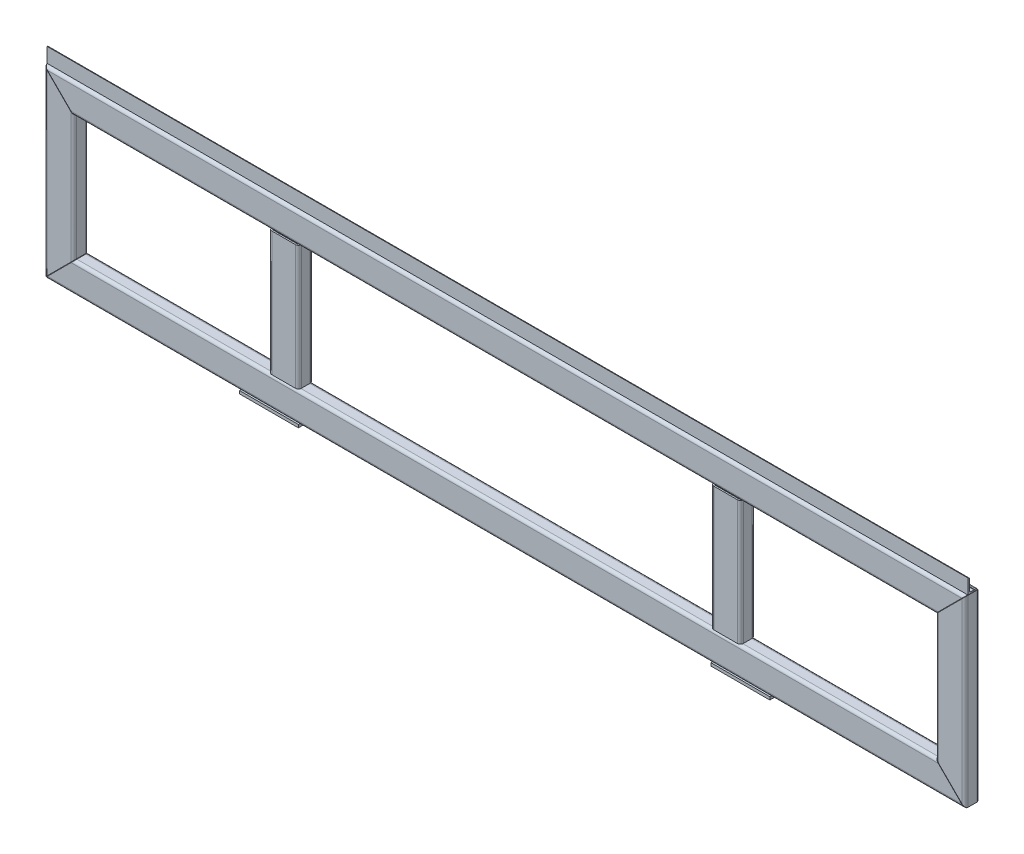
ISO-10303-21;
HEADER;
FILE_DESCRIPTION(('STEP AP214'),'2;1');
FILE_NAME('part.step','',(''),(''),'','','');
FILE_SCHEMA(('AUTOMOTIVE_DESIGN { 1 0 10303 214 1 1 1 1 }'));
ENDSEC;
DATA;
#1=APPLICATION_CONTEXT('core data for automotive mechanical design processes');
#2=APPLICATION_PROTOCOL_DEFINITION('international standard','automotive_design',2000,#1);
#3=PRODUCT_CONTEXT('',#1,'mechanical');
#4=PRODUCT('Part','Part','',(#3));
#5=PRODUCT_RELATED_PRODUCT_CATEGORY('part','',(#4));
#6=PRODUCT_DEFINITION_FORMATION('','',#4);
#7=PRODUCT_DEFINITION_CONTEXT('part definition',#1,'design');
#8=PRODUCT_DEFINITION('design','',#6,#7);
#9=PRODUCT_DEFINITION_SHAPE('','',#8);
#10=(LENGTH_UNIT() NAMED_UNIT(*) SI_UNIT(.MILLI.,.METRE.));
#11=(NAMED_UNIT(*) PLANE_ANGLE_UNIT() SI_UNIT($,.RADIAN.));
#12=(NAMED_UNIT(*) SI_UNIT($,.STERADIAN.) SOLID_ANGLE_UNIT());
#13=UNCERTAINTY_MEASURE_WITH_UNIT(LENGTH_MEASURE(1.E-05),#10,'distance_accuracy_value','');
#14=(GEOMETRIC_REPRESENTATION_CONTEXT(3) GLOBAL_UNCERTAINTY_ASSIGNED_CONTEXT((#13)) GLOBAL_UNIT_ASSIGNED_CONTEXT((#10,
#11,#12)) REPRESENTATION_CONTEXT('',''));
#15=CARTESIAN_POINT('',(0.,0.,0.));
#16=DIRECTION('',(0.,0.,1.));
#17=DIRECTION('',(1.,0.,0.));
#18=AXIS2_PLACEMENT_3D('',#15,#16,#17);
#19=CARTESIAN_POINT('',(1770.,-48.,20.0000000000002));
#20=DIRECTION('',(1.,0.,0.));
#21=DIRECTION('',(0.,1.,0.));
#22=AXIS2_PLACEMENT_3D('',#19,#20,#21);
#23=PLANE('',#22);
#24=DIRECTION('',(0.,0.,-1.));
#25=VECTOR('',#24,1.);
#26=CARTESIAN_POINT('',(1770.,-40.,20.0000000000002));
#27=LINE('',#26,#25);
#28=CARTESIAN_POINT('',(1770.,-40.,20.0000000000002));
#29=VERTEX_POINT('',#28);
#30=CARTESIAN_POINT('',(1770.,-40.0000000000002,-40.0583039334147));
#31=VERTEX_POINT('',#30);
#32=EDGE_CURVE('E160',#29,#31,#27,.T.);
#33=ORIENTED_EDGE('',*,*,#32,.T.);
#34=DIRECTION('',(0.,1.,0.));
#35=VECTOR('',#34,1.);
#36=CARTESIAN_POINT('',(1770.,-48.0000000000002,-40.0583039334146));
#37=LINE('',#36,#35);
#38=CARTESIAN_POINT('',(1770.,-48.0000000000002,-40.0583039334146));
#39=VERTEX_POINT('',#38);
#40=EDGE_CURVE('E14',#39,#31,#37,.T.);
#41=ORIENTED_EDGE('',*,*,#40,.F.);
#42=DIRECTION('',(0.,0.,-1.));
#43=VECTOR('',#42,1.);
#44=CARTESIAN_POINT('',(1770.,-48.,20.0000000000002));
#45=LINE('',#44,#43);
#46=CARTESIAN_POINT('',(1770.,-48.,20.0000000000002));
#47=VERTEX_POINT('',#46);
#48=EDGE_CURVE('E148',#47,#39,#45,.T.);
#49=ORIENTED_EDGE('',*,*,#48,.F.);
#50=DIRECTION('',(0.,1.,0.));
#51=VECTOR('',#50,1.);
#52=CARTESIAN_POINT('',(1770.,-48.,20.0000000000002));
#53=LINE('',#52,#51);
#54=EDGE_CURVE('E156',#47,#29,#53,.T.);
#55=ORIENTED_EDGE('',*,*,#54,.T.);
#56=EDGE_LOOP('',(#33,#41,#49,#55));
#57=FACE_BOUND('',#56,.T.);
#58=ADVANCED_FACE('F97',(#57),#23,.F.);
#59=CARTESIAN_POINT('',(1770.,-48.0000000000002,-40.0583039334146));
#60=DIRECTION('',(0.,0.,1.));
#61=DIRECTION('',(0.,-1.,0.));
#62=AXIS2_PLACEMENT_3D('',#59,#60,#61);
#63=PLANE('',#62);
#64=DIRECTION('',(1.,0.,0.));
#65=VECTOR('',#64,1.);
#66=CARTESIAN_POINT('',(1770.,-40.0000000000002,-40.0583039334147));
#67=LINE('',#66,#65);
#68=CARTESIAN_POINT('',(1930.,-40.0000000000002,-40.0583039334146));
#69=VERTEX_POINT('',#68);
#70=EDGE_CURVE('E152',#31,#69,#67,.T.);
#71=ORIENTED_EDGE('',*,*,#70,.T.);
#72=DIRECTION('',(0.,1.,0.));
#73=VECTOR('',#72,1.);
#74=CARTESIAN_POINT('',(1930.,-48.0000000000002,-40.0583039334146));
#75=LINE('',#74,#73);
#76=CARTESIAN_POINT('',(1930.,-48.0000000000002,-40.0583039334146));
#77=VERTEX_POINT('',#76);
#78=EDGE_CURVE('E105',#77,#69,#75,.T.);
#79=ORIENTED_EDGE('',*,*,#78,.F.);
#80=DIRECTION('',(1.,0.,0.));
#81=VECTOR('',#80,1.);
#82=CARTESIAN_POINT('',(1770.,-48.0000000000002,-40.0583039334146));
#83=LINE('',#82,#81);
#84=EDGE_CURVE('E143',#39,#77,#83,.T.);
#85=ORIENTED_EDGE('',*,*,#84,.F.);
#86=ORIENTED_EDGE('',*,*,#40,.T.);
#87=EDGE_LOOP('',(#71,#79,#85,#86));
#88=FACE_BOUND('',#87,.T.);
#89=ADVANCED_FACE('F151',(#88),#63,.F.);
#90=CARTESIAN_POINT('',(1930.,-48.,20.0000000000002));
#91=DIRECTION('',(-1.,0.,0.));
#92=DIRECTION('',(0.,-1.,0.));
#93=AXIS2_PLACEMENT_3D('',#90,#91,#92);
#94=PLANE('',#93);
#95=DIRECTION('',(0.,0.,1.));
#96=VECTOR('',#95,1.);
#97=CARTESIAN_POINT('',(1930.,-40.,20.0000000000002));
#98=LINE('',#97,#96);
#99=CARTESIAN_POINT('',(1930.,-40.,20.0000000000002));
#100=VERTEX_POINT('',#99);
#101=EDGE_CURVE('E130',#69,#100,#98,.T.);
#102=ORIENTED_EDGE('',*,*,#101,.T.);
#103=DIRECTION('',(0.,1.,0.));
#104=VECTOR('',#103,1.);
#105=CARTESIAN_POINT('',(1930.,-48.,20.0000000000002));
#106=LINE('',#105,#104);
#107=CARTESIAN_POINT('',(1930.,-48.,20.0000000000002));
#108=VERTEX_POINT('',#107);
#109=EDGE_CURVE('E153',#108,#100,#106,.T.);
#110=ORIENTED_EDGE('',*,*,#109,.F.);
#111=DIRECTION('',(0.,0.,1.));
#112=VECTOR('',#111,1.);
#113=CARTESIAN_POINT('',(1930.,-48.,20.0000000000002));
#114=LINE('',#113,#112);
#115=EDGE_CURVE('E146',#77,#108,#114,.T.);
#116=ORIENTED_EDGE('',*,*,#115,.F.);
#117=ORIENTED_EDGE('',*,*,#78,.T.);
#118=EDGE_LOOP('',(#102,#110,#116,#117));
#119=FACE_BOUND('',#118,.T.);
#120=ADVANCED_FACE('F154',(#119),#94,.F.);
#121=CARTESIAN_POINT('',(1770.,-48.,20.0000000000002));
#122=DIRECTION('',(0.,0.,-1.));
#123=DIRECTION('',(0.,1.,0.));
#124=AXIS2_PLACEMENT_3D('',#121,#122,#123);
#125=PLANE('',#124);
#126=DIRECTION('',(-1.,0.,0.));
#127=VECTOR('',#126,1.);
#128=CARTESIAN_POINT('',(1770.,-40.,20.0000000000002));
#129=LINE('',#128,#127);
#130=EDGE_CURVE('E136',#100,#29,#129,.T.);
#131=ORIENTED_EDGE('',*,*,#130,.T.);
#132=ORIENTED_EDGE('',*,*,#54,.F.);
#133=DIRECTION('',(-1.,0.,0.));
#134=VECTOR('',#133,1.);
#135=CARTESIAN_POINT('',(1770.,-48.,20.0000000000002));
#136=LINE('',#135,#134);
#137=EDGE_CURVE('E113',#108,#47,#136,.T.);
#138=ORIENTED_EDGE('',*,*,#137,.F.);
#139=ORIENTED_EDGE('',*,*,#109,.T.);
#140=EDGE_LOOP('',(#131,#132,#138,#139));
#141=FACE_BOUND('',#140,.T.);
#142=ADVANCED_FACE('F167',(#141),#125,.F.);
#143=CARTESIAN_POINT('',(1770.,-48.0000000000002,-40.0583039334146));
#144=DIRECTION('',(0.,-1.,0.));
#145=DIRECTION('',(0.,0.,-1.));
#146=AXIS2_PLACEMENT_3D('',#143,#144,#145);
#147=PLANE('',#146);
#148=ORIENTED_EDGE('',*,*,#48,.T.);
#149=ORIENTED_EDGE('',*,*,#84,.T.);
#150=ORIENTED_EDGE('',*,*,#115,.T.);
#151=ORIENTED_EDGE('',*,*,#137,.T.);
#152=EDGE_LOOP('',(#148,#149,#150,#151));
#153=FACE_BOUND('',#152,.T.);
#154=ADVANCED_FACE('F144',(#153),#147,.T.);
#155=CARTESIAN_POINT('',(1770.,-40.0000000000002,-40.0583039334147));
#156=DIRECTION('',(0.,-1.,0.));
#157=DIRECTION('',(0.,0.,-1.));
#158=AXIS2_PLACEMENT_3D('',#155,#156,#157);
#159=PLANE('',#158);
#160=ORIENTED_EDGE('',*,*,#32,.F.);
#161=ORIENTED_EDGE('',*,*,#130,.F.);
#162=ORIENTED_EDGE('',*,*,#101,.F.);
#163=ORIENTED_EDGE('',*,*,#70,.F.);
#164=EDGE_LOOP('',(#160,#161,#162,#163));
#165=FACE_BOUND('',#164,.T.);
#166=ADVANCED_FACE('F170',(#165),#159,.F.);
#167=CLOSED_SHELL('',(#58,#89,#120,#142,#154,#166));
#168=MANIFOLD_SOLID_BREP('B2',#167);
#169=CARTESIAN_POINT('',(490.,-48.,20.0000000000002));
#170=DIRECTION('',(1.,0.,0.));
#171=DIRECTION('',(0.,1.,0.));
#172=AXIS2_PLACEMENT_3D('',#169,#170,#171);
#173=PLANE('',#172);
#174=DIRECTION('',(0.,0.,-1.));
#175=VECTOR('',#174,1.);
#176=CARTESIAN_POINT('',(490.,-40.,20.0000000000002));
#177=LINE('',#176,#175);
#178=CARTESIAN_POINT('',(490.,-40.,20.0000000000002));
#179=VERTEX_POINT('',#178);
#180=CARTESIAN_POINT('',(490.,-40.0000000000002,-40.0583039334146));
#181=VERTEX_POINT('',#180);
#182=EDGE_CURVE('E294',#179,#181,#177,.T.);
#183=ORIENTED_EDGE('',*,*,#182,.T.);
#184=DIRECTION('',(0.,1.,0.));
#185=VECTOR('',#184,1.);
#186=CARTESIAN_POINT('',(490.,-48.0000000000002,-40.0583039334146));
#187=LINE('',#186,#185);
#188=CARTESIAN_POINT('',(490.,-48.0000000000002,-40.0583039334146));
#189=VERTEX_POINT('',#188);
#190=EDGE_CURVE('E95',#189,#181,#187,.T.);
#191=ORIENTED_EDGE('',*,*,#190,.F.);
#192=DIRECTION('',(0.,0.,-1.));
#193=VECTOR('',#192,1.);
#194=CARTESIAN_POINT('',(490.,-48.,20.0000000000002));
#195=LINE('',#194,#193);
#196=CARTESIAN_POINT('',(490.,-48.,20.0000000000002));
#197=VERTEX_POINT('',#196);
#198=EDGE_CURVE('E282',#197,#189,#195,.T.);
#199=ORIENTED_EDGE('',*,*,#198,.F.);
#200=DIRECTION('',(0.,1.,0.));
#201=VECTOR('',#200,1.);
#202=CARTESIAN_POINT('',(490.,-48.,20.0000000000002));
#203=LINE('',#202,#201);
#204=EDGE_CURVE('E290',#197,#179,#203,.T.);
#205=ORIENTED_EDGE('',*,*,#204,.T.);
#206=EDGE_LOOP('',(#183,#191,#199,#205));
#207=FACE_BOUND('',#206,.T.);
#208=ADVANCED_FACE('F231',(#207),#173,.F.);
#209=CARTESIAN_POINT('',(490.,-48.0000000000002,-40.0583039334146));
#210=DIRECTION('',(0.,0.,1.));
#211=DIRECTION('',(0.,-1.,0.));
#212=AXIS2_PLACEMENT_3D('',#209,#210,#211);
#213=PLANE('',#212);
#214=DIRECTION('',(1.,0.,0.));
#215=VECTOR('',#214,1.);
#216=CARTESIAN_POINT('',(490.,-40.0000000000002,-40.0583039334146));
#217=LINE('',#216,#215);
#218=CARTESIAN_POINT('',(650.,-40.0000000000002,-40.0583039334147));
#219=VERTEX_POINT('',#218);
#220=EDGE_CURVE('E286',#181,#219,#217,.T.);
#221=ORIENTED_EDGE('',*,*,#220,.T.);
#222=DIRECTION('',(0.,1.,0.));
#223=VECTOR('',#222,1.);
#224=CARTESIAN_POINT('',(650.,-48.0000000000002,-40.0583039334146));
#225=LINE('',#224,#223);
#226=CARTESIAN_POINT('',(650.,-48.0000000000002,-40.0583039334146));
#227=VERTEX_POINT('',#226);
#228=EDGE_CURVE('E239',#227,#219,#225,.T.);
#229=ORIENTED_EDGE('',*,*,#228,.F.);
#230=DIRECTION('',(1.,0.,0.));
#231=VECTOR('',#230,1.);
#232=CARTESIAN_POINT('',(490.,-48.0000000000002,-40.0583039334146));
#233=LINE('',#232,#231);
#234=EDGE_CURVE('E277',#189,#227,#233,.T.);
#235=ORIENTED_EDGE('',*,*,#234,.F.);
#236=ORIENTED_EDGE('',*,*,#190,.T.);
#237=EDGE_LOOP('',(#221,#229,#235,#236));
#238=FACE_BOUND('',#237,.T.);
#239=ADVANCED_FACE('F285',(#238),#213,.F.);
#240=CARTESIAN_POINT('',(650.,-48.,20.0000000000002));
#241=DIRECTION('',(-1.,0.,0.));
#242=DIRECTION('',(0.,-1.,0.));
#243=AXIS2_PLACEMENT_3D('',#240,#241,#242);
#244=PLANE('',#243);
#245=DIRECTION('',(0.,0.,1.));
#246=VECTOR('',#245,1.);
#247=CARTESIAN_POINT('',(650.,-40.,20.0000000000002));
#248=LINE('',#247,#246);
#249=CARTESIAN_POINT('',(650.,-40.,20.0000000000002));
#250=VERTEX_POINT('',#249);
#251=EDGE_CURVE('E264',#219,#250,#248,.T.);
#252=ORIENTED_EDGE('',*,*,#251,.T.);
#253=DIRECTION('',(0.,1.,0.));
#254=VECTOR('',#253,1.);
#255=CARTESIAN_POINT('',(650.,-48.,20.0000000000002));
#256=LINE('',#255,#254);
#257=CARTESIAN_POINT('',(650.,-48.,20.0000000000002));
#258=VERTEX_POINT('',#257);
#259=EDGE_CURVE('E287',#258,#250,#256,.T.);
#260=ORIENTED_EDGE('',*,*,#259,.F.);
#261=DIRECTION('',(0.,0.,1.));
#262=VECTOR('',#261,1.);
#263=CARTESIAN_POINT('',(650.,-48.,20.0000000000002));
#264=LINE('',#263,#262);
#265=EDGE_CURVE('E280',#227,#258,#264,.T.);
#266=ORIENTED_EDGE('',*,*,#265,.F.);
#267=ORIENTED_EDGE('',*,*,#228,.T.);
#268=EDGE_LOOP('',(#252,#260,#266,#267));
#269=FACE_BOUND('',#268,.T.);
#270=ADVANCED_FACE('F288',(#269),#244,.F.);
#271=CARTESIAN_POINT('',(490.,-48.,20.0000000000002));
#272=DIRECTION('',(0.,0.,-1.));
#273=DIRECTION('',(0.,1.,0.));
#274=AXIS2_PLACEMENT_3D('',#271,#272,#273);
#275=PLANE('',#274);
#276=DIRECTION('',(-1.,0.,0.));
#277=VECTOR('',#276,1.);
#278=CARTESIAN_POINT('',(490.,-40.,20.0000000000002));
#279=LINE('',#278,#277);
#280=EDGE_CURVE('E270',#250,#179,#279,.T.);
#281=ORIENTED_EDGE('',*,*,#280,.T.);
#282=ORIENTED_EDGE('',*,*,#204,.F.);
#283=DIRECTION('',(-1.,0.,0.));
#284=VECTOR('',#283,1.);
#285=CARTESIAN_POINT('',(490.,-48.,20.0000000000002));
#286=LINE('',#285,#284);
#287=EDGE_CURVE('E247',#258,#197,#286,.T.);
#288=ORIENTED_EDGE('',*,*,#287,.F.);
#289=ORIENTED_EDGE('',*,*,#259,.T.);
#290=EDGE_LOOP('',(#281,#282,#288,#289));
#291=FACE_BOUND('',#290,.T.);
#292=ADVANCED_FACE('F301',(#291),#275,.F.);
#293=CARTESIAN_POINT('',(490.,-48.0000000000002,-40.0583039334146));
#294=DIRECTION('',(0.,-1.,0.));
#295=DIRECTION('',(0.,0.,-1.));
#296=AXIS2_PLACEMENT_3D('',#293,#294,#295);
#297=PLANE('',#296);
#298=ORIENTED_EDGE('',*,*,#198,.T.);
#299=ORIENTED_EDGE('',*,*,#234,.T.);
#300=ORIENTED_EDGE('',*,*,#265,.T.);
#301=ORIENTED_EDGE('',*,*,#287,.T.);
#302=EDGE_LOOP('',(#298,#299,#300,#301));
#303=FACE_BOUND('',#302,.T.);
#304=ADVANCED_FACE('F278',(#303),#297,.T.);
#305=CARTESIAN_POINT('',(490.,-40.0000000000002,-40.0583039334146));
#306=DIRECTION('',(0.,-1.,0.));
#307=DIRECTION('',(0.,0.,-1.));
#308=AXIS2_PLACEMENT_3D('',#305,#306,#307);
#309=PLANE('',#308);
#310=ORIENTED_EDGE('',*,*,#182,.F.);
#311=ORIENTED_EDGE('',*,*,#280,.F.);
#312=ORIENTED_EDGE('',*,*,#251,.F.);
#313=ORIENTED_EDGE('',*,*,#220,.F.);
#314=EDGE_LOOP('',(#310,#311,#312,#313));
#315=FACE_BOUND('',#314,.T.);
#316=ADVANCED_FACE('F304',(#315),#309,.F.);
#317=CLOSED_SHELL('',(#208,#239,#270,#292,#304,#316));
#318=MANIFOLD_SOLID_BREP('B8',#317);
#319=CARTESIAN_POINT('',(-40.,460.,-7.99999999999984));
#320=DIRECTION('',(0.,-1.,0.));
#321=DIRECTION('',(0.,0.,-1.));
#322=AXIS2_PLACEMENT_3D('',#319,#320,#321);
#323=PLANE('',#322);
#324=DIRECTION('',(0.,0.,-1.));
#325=VECTOR('',#324,1.);
#326=CARTESIAN_POINT('',(2460.00894078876,460.,-7.99999999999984));
#327=LINE('',#326,#325);
#328=CARTESIAN_POINT('',(2460.00894078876,460.,12.0000000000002));
#329=VERTEX_POINT('',#328);
#330=CARTESIAN_POINT('',(2460.00894078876,460.,-7.99999999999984));
#331=VERTEX_POINT('',#330);
#332=EDGE_CURVE('E456',#329,#331,#327,.T.);
#333=ORIENTED_EDGE('',*,*,#332,.F.);
#334=DIRECTION('',(1.,0.,0.));
#335=VECTOR('',#334,1.);
#336=CARTESIAN_POINT('',(-40.,460.,12.0000000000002));
#337=LINE('',#336,#335);
#338=CARTESIAN_POINT('',(-40.,460.,12.0000000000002));
#339=VERTEX_POINT('',#338);
#340=EDGE_CURVE('E229',#339,#329,#337,.T.);
#341=ORIENTED_EDGE('',*,*,#340,.F.);
#342=DIRECTION('',(0.,0.,-1.));
#343=VECTOR('',#342,1.);
#344=CARTESIAN_POINT('',(-40.,460.,-7.99999999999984));
#345=LINE('',#344,#343);
#346=CARTESIAN_POINT('',(-40.,460.,-7.99999999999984));
#347=VERTEX_POINT('',#346);
#348=EDGE_CURVE('E473',#339,#347,#345,.T.);
#349=ORIENTED_EDGE('',*,*,#348,.T.);
#350=DIRECTION('',(1.,0.,0.));
#351=VECTOR('',#350,1.);
#352=CARTESIAN_POINT('',(-40.,460.,-7.99999999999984));
#353=LINE('',#352,#351);
#354=EDGE_CURVE('E368',#347,#331,#353,.T.);
#355=ORIENTED_EDGE('',*,*,#354,.T.);
#356=EDGE_LOOP('',(#333,#341,#349,#355));
#357=FACE_BOUND('',#356,.T.);
#358=ADVANCED_FACE('F365',(#357),#323,.T.);
#359=CARTESIAN_POINT('',(-40.,500.,12.));
#360=DIRECTION('',(0.,0.,1.));
#361=DIRECTION('',(0.,-1.,0.));
#362=AXIS2_PLACEMENT_3D('',#359,#360,#361);
#363=PLANE('',#362);
#364=DIRECTION('',(0.,-1.,0.));
#365=VECTOR('',#364,1.);
#366=CARTESIAN_POINT('',(2460.00894078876,500.,12.));
#367=LINE('',#366,#365);
#368=CARTESIAN_POINT('',(2460.00894078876,500.,12.));
#369=VERTEX_POINT('',#368);
#370=EDGE_CURVE('E471',#369,#329,#367,.T.);
#371=ORIENTED_EDGE('',*,*,#370,.F.);
#372=DIRECTION('',(1.,0.,0.));
#373=VECTOR('',#372,1.);
#374=CARTESIAN_POINT('',(-40.,500.,12.));
#375=LINE('',#374,#373);
#376=CARTESIAN_POINT('',(-40.,500.,12.));
#377=VERTEX_POINT('',#376);
#378=EDGE_CURVE('E374',#377,#369,#375,.T.);
#379=ORIENTED_EDGE('',*,*,#378,.F.);
#380=DIRECTION('',(0.,-1.,0.));
#381=VECTOR('',#380,1.);
#382=CARTESIAN_POINT('',(-40.,500.,12.));
#383=LINE('',#382,#381);
#384=EDGE_CURVE('E446',#377,#339,#383,.T.);
#385=ORIENTED_EDGE('',*,*,#384,.T.);
#386=ORIENTED_EDGE('',*,*,#340,.T.);
#387=EDGE_LOOP('',(#371,#379,#385,#386));
#388=FACE_BOUND('',#387,.T.);
#389=ADVANCED_FACE('F483',(#388),#363,.T.);
#390=CARTESIAN_POINT('',(-40.,496.,12.));
#391=DIRECTION('',(1.,0.,0.));
#392=DIRECTION('',(0.,0.,-1.));
#393=AXIS2_PLACEMENT_3D('',#390,#391,#392);
#394=CYLINDRICAL_SURFACE('',#393,4.);
#395=CARTESIAN_POINT('',(2460.00894078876,496.,12.));
#396=DIRECTION('',(1.,0.,0.));
#397=DIRECTION('',(0.,-1.,0.));
#398=AXIS2_PLACEMENT_3D('',#395,#396,#397);
#399=CIRCLE('',#398,4.);
#400=CARTESIAN_POINT('',(2460.00894078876,496.,8.00000000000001));
#401=VERTEX_POINT('',#400);
#402=EDGE_CURVE('E433',#401,#369,#399,.T.);
#403=ORIENTED_EDGE('',*,*,#402,.F.);
#404=DIRECTION('',(1.,0.,0.));
#405=VECTOR('',#404,1.);
#406=CARTESIAN_POINT('',(-40.,496.,8.00000000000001));
#407=LINE('',#406,#405);
#408=CARTESIAN_POINT('',(-40.,496.,8.00000000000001));
#409=VERTEX_POINT('',#408);
#410=EDGE_CURVE('E428',#409,#401,#407,.T.);
#411=ORIENTED_EDGE('',*,*,#410,.F.);
#412=CARTESIAN_POINT('',(-40.,496.,12.));
#413=DIRECTION('',(1.,0.,0.));
#414=DIRECTION('',(0.,-1.,0.));
#415=AXIS2_PLACEMENT_3D('',#412,#413,#414);
#416=CIRCLE('',#415,4.);
#417=EDGE_CURVE('E431',#409,#377,#416,.T.);
#418=ORIENTED_EDGE('',*,*,#417,.T.);
#419=ORIENTED_EDGE('',*,*,#378,.T.);
#420=EDGE_LOOP('',(#403,#411,#418,#419));
#421=FACE_BOUND('',#420,.T.);
#422=ADVANCED_FACE('F430',(#421),#394,.T.);
#423=CARTESIAN_POINT('',(-40.,496.,8.00000000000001));
#424=DIRECTION('',(0.,0.,-1.));
#425=DIRECTION('',(0.,1.,0.));
#426=AXIS2_PLACEMENT_3D('',#423,#424,#425);
#427=PLANE('',#426);
#428=DIRECTION('',(0.,1.,0.));
#429=VECTOR('',#428,1.);
#430=CARTESIAN_POINT('',(2460.00894078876,496.,8.00000000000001));
#431=LINE('',#430,#429);
#432=CARTESIAN_POINT('',(2460.00894078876,468.,8.00000000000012));
#433=VERTEX_POINT('',#432);
#434=EDGE_CURVE('E468',#433,#401,#431,.T.);
#435=ORIENTED_EDGE('',*,*,#434,.F.);
#436=DIRECTION('',(1.,0.,0.));
#437=VECTOR('',#436,1.);
#438=CARTESIAN_POINT('',(-40.,468.,8.00000000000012));
#439=LINE('',#438,#437);
#440=CARTESIAN_POINT('',(-40.,468.,8.00000000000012));
#441=VERTEX_POINT('',#440);
#442=EDGE_CURVE('E438',#441,#433,#439,.T.);
#443=ORIENTED_EDGE('',*,*,#442,.F.);
#444=DIRECTION('',(0.,1.,0.));
#445=VECTOR('',#444,1.);
#446=CARTESIAN_POINT('',(-40.,496.,8.00000000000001));
#447=LINE('',#446,#445);
#448=EDGE_CURVE('E444',#441,#409,#447,.T.);
#449=ORIENTED_EDGE('',*,*,#448,.T.);
#450=ORIENTED_EDGE('',*,*,#410,.T.);
#451=EDGE_LOOP('',(#435,#443,#449,#450));
#452=FACE_BOUND('',#451,.T.);
#453=ADVANCED_FACE('F448',(#452),#427,.T.);
#454=CARTESIAN_POINT('',(-40.,468.,4.00000000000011));
#455=DIRECTION('',(1.,0.,0.));
#456=DIRECTION('',(0.,0.,-1.));
#457=AXIS2_PLACEMENT_3D('',#454,#455,#456);
#458=CYLINDRICAL_SURFACE('',#457,4.);
#459=CARTESIAN_POINT('',(2460.00894078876,468.,4.00000000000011));
#460=DIRECTION('',(-1.,0.,0.));
#461=DIRECTION('',(0.,1.,0.));
#462=AXIS2_PLACEMENT_3D('',#459,#460,#461);
#463=CIRCLE('',#462,4.);
#464=CARTESIAN_POINT('',(2460.00894078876,464.,4.00000000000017));
#465=VERTEX_POINT('',#464);
#466=EDGE_CURVE('E465',#465,#433,#463,.T.);
#467=ORIENTED_EDGE('',*,*,#466,.F.);
#468=DIRECTION('',(1.,0.,0.));
#469=VECTOR('',#468,1.);
#470=CARTESIAN_POINT('',(-40.,464.,4.00000000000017));
#471=LINE('',#470,#469);
#472=CARTESIAN_POINT('',(-40.,464.,4.00000000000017));
#473=VERTEX_POINT('',#472);
#474=EDGE_CURVE('E477',#473,#465,#471,.T.);
#475=ORIENTED_EDGE('',*,*,#474,.F.);
#476=CARTESIAN_POINT('',(-40.,468.,4.00000000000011));
#477=DIRECTION('',(-1.,0.,0.));
#478=DIRECTION('',(0.,1.,0.));
#479=AXIS2_PLACEMENT_3D('',#476,#477,#478);
#480=CIRCLE('',#479,4.);
#481=EDGE_CURVE('E449',#473,#441,#480,.T.);
#482=ORIENTED_EDGE('',*,*,#481,.T.);
#483=ORIENTED_EDGE('',*,*,#442,.T.);
#484=EDGE_LOOP('',(#467,#475,#482,#483));
#485=FACE_BOUND('',#484,.T.);
#486=ADVANCED_FACE('F496',(#485),#458,.F.);
#487=CARTESIAN_POINT('',(-40.,464.,4.00000000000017));
#488=DIRECTION('',(0.,1.,0.));
#489=DIRECTION('',(0.,0.,1.));
#490=AXIS2_PLACEMENT_3D('',#487,#488,#489);
#491=PLANE('',#490);
#492=DIRECTION('',(0.,0.,1.));
#493=VECTOR('',#492,1.);
#494=CARTESIAN_POINT('',(2460.00894078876,464.,4.00000000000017));
#495=LINE('',#494,#493);
#496=CARTESIAN_POINT('',(2460.00894078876,464.,-3.99999999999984));
#497=VERTEX_POINT('',#496);
#498=EDGE_CURVE('E462',#497,#465,#495,.T.);
#499=ORIENTED_EDGE('',*,*,#498,.F.);
#500=DIRECTION('',(1.,0.,0.));
#501=VECTOR('',#500,1.);
#502=CARTESIAN_POINT('',(-40.,464.,-3.99999999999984));
#503=LINE('',#502,#501);
#504=CARTESIAN_POINT('',(-40.,464.,-3.99999999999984));
#505=VERTEX_POINT('',#504);
#506=EDGE_CURVE('E478',#505,#497,#503,.T.);
#507=ORIENTED_EDGE('',*,*,#506,.F.);
#508=DIRECTION('',(0.,0.,1.));
#509=VECTOR('',#508,1.);
#510=CARTESIAN_POINT('',(-40.,464.,4.00000000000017));
#511=LINE('',#510,#509);
#512=EDGE_CURVE('E451',#505,#473,#511,.T.);
#513=ORIENTED_EDGE('',*,*,#512,.T.);
#514=ORIENTED_EDGE('',*,*,#474,.T.);
#515=EDGE_LOOP('',(#499,#507,#513,#514));
#516=FACE_BOUND('',#515,.T.);
#517=ADVANCED_FACE('F499',(#516),#491,.T.);
#518=CARTESIAN_POINT('',(-40.,460.,-3.99999999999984));
#519=DIRECTION('',(1.,0.,0.));
#520=DIRECTION('',(0.,0.,-1.));
#521=AXIS2_PLACEMENT_3D('',#518,#519,#520);
#522=CYLINDRICAL_SURFACE('',#521,4.);
#523=CARTESIAN_POINT('',(2460.00894078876,460.,-3.99999999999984));
#524=DIRECTION('',(1.,0.,0.));
#525=DIRECTION('',(0.,-1.,0.));
#526=AXIS2_PLACEMENT_3D('',#523,#524,#525);
#527=CIRCLE('',#526,4.);
#528=EDGE_CURVE('E459',#331,#497,#527,.T.);
#529=ORIENTED_EDGE('',*,*,#528,.F.);
#530=ORIENTED_EDGE('',*,*,#354,.F.);
#531=CARTESIAN_POINT('',(-40.,460.,-3.99999999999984));
#532=DIRECTION('',(1.,0.,0.));
#533=DIRECTION('',(0.,-1.,0.));
#534=AXIS2_PLACEMENT_3D('',#531,#532,#533);
#535=CIRCLE('',#534,4.);
#536=EDGE_CURVE('E579',#347,#505,#535,.T.);
#537=ORIENTED_EDGE('',*,*,#536,.T.);
#538=ORIENTED_EDGE('',*,*,#506,.T.);
#539=EDGE_LOOP('',(#529,#530,#537,#538));
#540=FACE_BOUND('',#539,.T.);
#541=ADVANCED_FACE('F480',(#540),#522,.T.);
#542=CARTESIAN_POINT('',(-40.,496.,12.));
#543=DIRECTION('',(1.,0.,0.));
#544=DIRECTION('',(0.,-1.,0.));
#545=AXIS2_PLACEMENT_3D('',#542,#543,#544);
#546=PLANE('',#545);
#547=ORIENTED_EDGE('',*,*,#348,.F.);
#548=ORIENTED_EDGE('',*,*,#384,.F.);
#549=ORIENTED_EDGE('',*,*,#417,.F.);
#550=ORIENTED_EDGE('',*,*,#448,.F.);
#551=ORIENTED_EDGE('',*,*,#481,.F.);
#552=ORIENTED_EDGE('',*,*,#512,.F.);
#553=ORIENTED_EDGE('',*,*,#536,.F.);
#554=EDGE_LOOP('',(#547,#548,#549,#550,#551,#552,#553));
#555=FACE_BOUND('',#554,.T.);
#556=ADVANCED_FACE('F442',(#555),#546,.F.);
#557=CARTESIAN_POINT('',(2460.00894078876,496.,12.));
#558=DIRECTION('',(1.,0.,0.));
#559=DIRECTION('',(0.,-1.,0.));
#560=AXIS2_PLACEMENT_3D('',#557,#558,#559);
#561=PLANE('',#560);
#562=ORIENTED_EDGE('',*,*,#332,.T.);
#563=ORIENTED_EDGE('',*,*,#528,.T.);
#564=ORIENTED_EDGE('',*,*,#498,.T.);
#565=ORIENTED_EDGE('',*,*,#466,.T.);
#566=ORIENTED_EDGE('',*,*,#434,.T.);
#567=ORIENTED_EDGE('',*,*,#402,.T.);
#568=ORIENTED_EDGE('',*,*,#370,.T.);
#569=EDGE_LOOP('',(#562,#563,#564,#565,#566,#567,#568));
#570=FACE_BOUND('',#569,.T.);
#571=ADVANCED_FACE('F482',(#570),#561,.T.);
#572=CLOSED_SHELL('',(#358,#389,#422,#453,#486,#517,#541,#556,#571));
#573=MANIFOLD_SOLID_BREP('B89',#572);
#574=CARTESIAN_POINT('',(2420.,388.,11.9999999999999));
#575=DIRECTION('',(-1.,0.,0.));
#576=DIRECTION('',(0.,0.,1.));
#577=AXIS2_PLACEMENT_3D('',#574,#575,#576);
#578=CYLINDRICAL_SURFACE('',#577,8.00000000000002);
#579=CARTESIAN_POINT('',(32.7071067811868,388.,11.9999999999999));
#580=DIRECTION('',(-0.707106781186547,-0.707106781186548,0.));
#581=DIRECTION('',(-0.707106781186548,0.707106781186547,0.));
#582=AXIS2_PLACEMENT_3D('',#579,#580,#581);
#583=ELLIPSE('',#582,11.3137084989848,8.00000000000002);
#584=CARTESIAN_POINT('',(40.7071067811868,380.,11.9999999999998));
#585=VERTEX_POINT('',#584);
#586=CARTESIAN_POINT('',(32.7071067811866,388.,19.9999999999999));
#587=VERTEX_POINT('',#586);
#588=EDGE_CURVE('E739',#585,#587,#583,.T.);
#589=ORIENTED_EDGE('',*,*,#588,.F.);
#590=DIRECTION('',(-1.,0.,0.));
#591=VECTOR('',#590,1.);
#592=CARTESIAN_POINT('',(2420.,380.,11.9999999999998));
#593=LINE('',#592,#591);
#594=CARTESIAN_POINT('',(2379.29289321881,380.,11.9999999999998));
#595=VERTEX_POINT('',#594);
#596=EDGE_CURVE('E819',#595,#585,#593,.T.);
#597=ORIENTED_EDGE('',*,*,#596,.F.);
#598=CARTESIAN_POINT('',(2387.29289321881,388.,11.9999999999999));
#599=DIRECTION('',(0.707106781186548,-0.707106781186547,0.));
#600=DIRECTION('',(-0.707106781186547,-0.707106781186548,0.));
#601=AXIS2_PLACEMENT_3D('',#598,#599,#600);
#602=ELLIPSE('',#601,11.3137084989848,8.00000000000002);
#603=CARTESIAN_POINT('',(2387.29289321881,388.,19.9999999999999));
#604=VERTEX_POINT('',#603);
#605=EDGE_CURVE('E730',#604,#595,#602,.T.);
#606=ORIENTED_EDGE('',*,*,#605,.F.);
#607=DIRECTION('',(-1.,0.,0.));
#608=VECTOR('',#607,1.);
#609=CARTESIAN_POINT('',(2420.,388.,19.9999999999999));
#610=LINE('',#609,#608);
#611=EDGE_CURVE('E599',#604,#587,#610,.T.);
#612=ORIENTED_EDGE('',*,*,#611,.T.);
#613=EDGE_LOOP('',(#589,#597,#606,#612));
#614=FACE_BOUND('',#613,.T.);
#615=ADVANCED_FACE('F595',(#614),#578,.T.);
#616=CARTESIAN_POINT('',(2420.,380.,11.9999999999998));
#617=DIRECTION('',(0.,1.,0.));
#618=DIRECTION('',(0.,0.,1.));
#619=AXIS2_PLACEMENT_3D('',#616,#617,#618);
#620=PLANE('',#619);
#621=DIRECTION('',(0.,0.,1.));
#622=VECTOR('',#621,1.);
#623=CARTESIAN_POINT('',(40.7071067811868,380.,12.0000000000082));
#624=LINE('',#623,#622);
#625=CARTESIAN_POINT('',(40.7071067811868,380.,-12.0000000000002));
#626=VERTEX_POINT('',#625);
#627=EDGE_CURVE('E736',#626,#585,#624,.T.);
#628=ORIENTED_EDGE('',*,*,#627,.F.);
#629=DIRECTION('',(-1.,0.,0.));
#630=VECTOR('',#629,1.);
#631=CARTESIAN_POINT('',(2420.,380.,-12.0000000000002));
#632=LINE('',#631,#630);
#633=CARTESIAN_POINT('',(2379.29289321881,380.,-12.0000000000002));
#634=VERTEX_POINT('',#633);
#635=EDGE_CURVE('E817',#634,#626,#632,.T.);
#636=ORIENTED_EDGE('',*,*,#635,.F.);
#637=DIRECTION('',(0.,0.,-1.));
#638=VECTOR('',#637,1.);
#639=CARTESIAN_POINT('',(2379.29289321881,380.,11.9999999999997));
#640=LINE('',#639,#638);
#641=EDGE_CURVE('E835',#595,#634,#640,.T.);
#642=ORIENTED_EDGE('',*,*,#641,.F.);
#643=ORIENTED_EDGE('',*,*,#596,.T.);
#644=EDGE_LOOP('',(#628,#636,#642,#643));
#645=FACE_BOUND('',#644,.T.);
#646=ADVANCED_FACE('F826',(#645),#620,.F.);
#647=CARTESIAN_POINT('',(2420.,388.,-12.0000000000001));
#648=DIRECTION('',(-1.,0.,0.));
#649=DIRECTION('',(0.,0.,1.));
#650=AXIS2_PLACEMENT_3D('',#647,#648,#649);
#651=CYLINDRICAL_SURFACE('',#650,8.00000000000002);
#652=CARTESIAN_POINT('',(32.7071067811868,388.,-12.0000000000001));
#653=DIRECTION('',(-0.707106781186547,-0.707106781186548,0.));
#654=DIRECTION('',(-0.707106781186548,0.707106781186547,0.));
#655=AXIS2_PLACEMENT_3D('',#652,#653,#654);
#656=ELLIPSE('',#655,11.3137084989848,8.00000000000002);
#657=CARTESIAN_POINT('',(32.7071067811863,388.,-20.0000000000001));
#658=VERTEX_POINT('',#657);
#659=EDGE_CURVE('E363',#658,#626,#656,.T.);
#660=ORIENTED_EDGE('',*,*,#659,.F.);
#661=DIRECTION('',(-1.,0.,0.));
#662=VECTOR('',#661,1.);
#663=CARTESIAN_POINT('',(2420.,388.,-20.0000000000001));
#664=LINE('',#663,#662);
#665=CARTESIAN_POINT('',(2387.29289321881,388.,-20.0000000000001));
#666=VERTEX_POINT('',#665);
#667=EDGE_CURVE('E814',#666,#658,#664,.T.);
#668=ORIENTED_EDGE('',*,*,#667,.F.);
#669=CARTESIAN_POINT('',(2387.29289321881,388.,-12.0000000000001));
#670=DIRECTION('',(0.707106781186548,-0.707106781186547,0.));
#671=DIRECTION('',(-0.707106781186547,-0.707106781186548,0.));
#672=AXIS2_PLACEMENT_3D('',#669,#670,#671);
#673=ELLIPSE('',#672,11.3137084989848,8.00000000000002);
#674=EDGE_CURVE('E832',#634,#666,#673,.T.);
#675=ORIENTED_EDGE('',*,*,#674,.F.);
#676=ORIENTED_EDGE('',*,*,#635,.T.);
#677=EDGE_LOOP('',(#660,#668,#675,#676));
#678=FACE_BOUND('',#677,.T.);
#679=ADVANCED_FACE('F829',(#678),#651,.T.);
#680=CARTESIAN_POINT('',(2420.,452.,-19.9999999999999));
#681=DIRECTION('',(0.,0.,1.));
#682=DIRECTION('',(0.,-1.,0.));
#683=AXIS2_PLACEMENT_3D('',#680,#681,#682);
#684=PLANE('',#683);
#685=DIRECTION('',(0.707106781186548,-0.707106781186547,0.));
#686=VECTOR('',#685,1.);
#687=CARTESIAN_POINT('',(1194.35355339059,-773.646446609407,-20.0000000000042));
#688=LINE('',#687,#686);
#689=CARTESIAN_POINT('',(-31.2928932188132,452.,-19.9999999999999));
#690=VERTEX_POINT('',#689);
#691=EDGE_CURVE('E605',#690,#658,#688,.T.);
#692=ORIENTED_EDGE('',*,*,#691,.F.);
#693=DIRECTION('',(-1.,0.,0.));
#694=VECTOR('',#693,1.);
#695=CARTESIAN_POINT('',(2420.,452.,-19.9999999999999));
#696=LINE('',#695,#694);
#697=CARTESIAN_POINT('',(2451.29289321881,452.,-19.9999999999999));
#698=VERTEX_POINT('',#697);
#699=EDGE_CURVE('E811',#698,#690,#696,.T.);
#700=ORIENTED_EDGE('',*,*,#699,.F.);
#701=DIRECTION('',(0.707106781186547,0.707106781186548,0.));
#702=VECTOR('',#701,1.);
#703=CARTESIAN_POINT('',(2435.64644660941,436.353553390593,-20.));
#704=LINE('',#703,#702);
#705=EDGE_CURVE('E834',#666,#698,#704,.T.);
#706=ORIENTED_EDGE('',*,*,#705,.F.);
#707=ORIENTED_EDGE('',*,*,#667,.T.);
#708=EDGE_LOOP('',(#692,#700,#706,#707));
#709=FACE_BOUND('',#708,.T.);
#710=ADVANCED_FACE('F845',(#709),#684,.F.);
#711=CARTESIAN_POINT('',(2420.,452.,-11.9999999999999));
#712=DIRECTION('',(-1.,0.,0.));
#713=DIRECTION('',(0.,0.,1.));
#714=AXIS2_PLACEMENT_3D('',#711,#712,#713);
#715=CYLINDRICAL_SURFACE('',#714,8.00000000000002);
#716=CARTESIAN_POINT('',(-31.2928932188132,452.,-11.9999999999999));
#717=DIRECTION('',(-0.707106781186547,-0.707106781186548,0.));
#718=DIRECTION('',(-0.707106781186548,0.707106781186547,0.));
#719=AXIS2_PLACEMENT_3D('',#716,#717,#718);
#720=ELLIPSE('',#719,11.3137084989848,8.00000000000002);
#721=CARTESIAN_POINT('',(-39.2928932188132,460.,-11.9999999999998));
#722=VERTEX_POINT('',#721);
#723=EDGE_CURVE('E754',#722,#690,#720,.T.);
#724=ORIENTED_EDGE('',*,*,#723,.F.);
#725=DIRECTION('',(-1.,0.,0.));
#726=VECTOR('',#725,1.);
#727=CARTESIAN_POINT('',(2420.,460.,-11.9999999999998));
#728=LINE('',#727,#726);
#729=CARTESIAN_POINT('',(2459.29289321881,460.,-11.9999999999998));
#730=VERTEX_POINT('',#729);
#731=EDGE_CURVE('E808',#730,#722,#728,.T.);
#732=ORIENTED_EDGE('',*,*,#731,.F.);
#733=CARTESIAN_POINT('',(2451.29289321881,452.,-11.9999999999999));
#734=DIRECTION('',(0.707106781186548,-0.707106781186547,0.));
#735=DIRECTION('',(-0.707106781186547,-0.707106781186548,0.));
#736=AXIS2_PLACEMENT_3D('',#733,#734,#735);
#737=ELLIPSE('',#736,11.3137084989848,8.00000000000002);
#738=EDGE_CURVE('E741',#698,#730,#737,.T.);
#739=ORIENTED_EDGE('',*,*,#738,.F.);
#740=ORIENTED_EDGE('',*,*,#699,.T.);
#741=EDGE_LOOP('',(#724,#732,#739,#740));
#742=FACE_BOUND('',#741,.T.);
#743=ADVANCED_FACE('F843',(#742),#715,.T.);
#744=CARTESIAN_POINT('',(2420.,460.,-11.9999999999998));
#745=DIRECTION('',(0.,-1.,0.));
#746=DIRECTION('',(0.,0.,-1.));
#747=AXIS2_PLACEMENT_3D('',#744,#745,#746);
#748=PLANE('',#747);
#749=DIRECTION('',(0.,0.,-1.));
#750=VECTOR('',#749,1.);
#751=CARTESIAN_POINT('',(-39.2928932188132,460.,-11.9999999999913));
#752=LINE('',#751,#750);
#753=CARTESIAN_POINT('',(-39.2928932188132,460.,12.0000000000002));
#754=VERTEX_POINT('',#753);
#755=EDGE_CURVE('E757',#754,#722,#752,.T.);
#756=ORIENTED_EDGE('',*,*,#755,.F.);
#757=DIRECTION('',(-1.,0.,0.));
#758=VECTOR('',#757,1.);
#759=CARTESIAN_POINT('',(2420.,460.,12.0000000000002));
#760=LINE('',#759,#758);
#761=CARTESIAN_POINT('',(2459.29289321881,460.,12.0000000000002));
#762=VERTEX_POINT('',#761);
#763=EDGE_CURVE('E806',#762,#754,#760,.T.);
#764=ORIENTED_EDGE('',*,*,#763,.F.);
#765=DIRECTION('',(0.,0.,1.));
#766=VECTOR('',#765,1.);
#767=CARTESIAN_POINT('',(2459.29289321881,460.,-11.9999999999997));
#768=LINE('',#767,#766);
#769=EDGE_CURVE('E735',#730,#762,#768,.T.);
#770=ORIENTED_EDGE('',*,*,#769,.F.);
#771=ORIENTED_EDGE('',*,*,#731,.T.);
#772=EDGE_LOOP('',(#756,#764,#770,#771));
#773=FACE_BOUND('',#772,.T.);
#774=ADVANCED_FACE('F847',(#773),#748,.F.);
#775=CARTESIAN_POINT('',(2420.,452.,12.0000000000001));
#776=DIRECTION('',(-1.,0.,0.));
#777=DIRECTION('',(0.,0.,1.));
#778=AXIS2_PLACEMENT_3D('',#775,#776,#777);
#779=CYLINDRICAL_SURFACE('',#778,8.00000000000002);
#780=CARTESIAN_POINT('',(-31.2928932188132,452.,12.0000000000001));
#781=DIRECTION('',(-0.707106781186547,-0.707106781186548,0.));
#782=DIRECTION('',(-0.707106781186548,0.707106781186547,0.));
#783=AXIS2_PLACEMENT_3D('',#780,#781,#782);
#784=ELLIPSE('',#783,11.3137084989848,8.00000000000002);
#785=CARTESIAN_POINT('',(-31.2928932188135,452.,20.0000000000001));
#786=VERTEX_POINT('',#785);
#787=EDGE_CURVE('E718',#786,#754,#784,.T.);
#788=ORIENTED_EDGE('',*,*,#787,.F.);
#789=DIRECTION('',(-1.,0.,0.));
#790=VECTOR('',#789,1.);
#791=CARTESIAN_POINT('',(2420.,452.,20.0000000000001));
#792=LINE('',#791,#790);
#793=CARTESIAN_POINT('',(2451.29289321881,452.,20.0000000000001));
#794=VERTEX_POINT('',#793);
#795=EDGE_CURVE('E710',#794,#786,#792,.T.);
#796=ORIENTED_EDGE('',*,*,#795,.F.);
#797=CARTESIAN_POINT('',(2451.29289321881,452.,12.0000000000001));
#798=DIRECTION('',(0.707106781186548,-0.707106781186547,0.));
#799=DIRECTION('',(-0.707106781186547,-0.707106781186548,0.));
#800=AXIS2_PLACEMENT_3D('',#797,#798,#799);
#801=ELLIPSE('',#800,11.3137084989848,8.00000000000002);
#802=EDGE_CURVE('E715',#762,#794,#801,.T.);
#803=ORIENTED_EDGE('',*,*,#802,.F.);
#804=ORIENTED_EDGE('',*,*,#763,.T.);
#805=EDGE_LOOP('',(#788,#796,#803,#804));
#806=FACE_BOUND('',#805,.T.);
#807=ADVANCED_FACE('F712',(#806),#779,.T.);
#808=CARTESIAN_POINT('',(2420.,388.,-12.0000000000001));
#809=DIRECTION('',(-1.,0.,0.));
#810=DIRECTION('',(0.,0.,1.));
#811=AXIS2_PLACEMENT_3D('',#808,#809,#810);
#812=CYLINDRICAL_SURFACE('',#811,4.);
#813=DIRECTION('',(-1.,0.,0.));
#814=VECTOR('',#813,1.);
#815=CARTESIAN_POINT('',(2420.,388.,-16.0000000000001));
#816=LINE('',#815,#814);
#817=CARTESIAN_POINT('',(2387.29289321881,388.,-16.0000000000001));
#818=VERTEX_POINT('',#817);
#819=CARTESIAN_POINT('',(32.7071067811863,388.,-16.0000000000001));
#820=VERTEX_POINT('',#819);
#821=EDGE_CURVE('E763',#818,#820,#816,.T.);
#822=ORIENTED_EDGE('',*,*,#821,.T.);
#823=CARTESIAN_POINT('',(32.7071067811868,388.,-12.0000000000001));
#824=DIRECTION('',(-0.707106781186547,-0.707106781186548,0.));
#825=DIRECTION('',(-0.707106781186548,0.707106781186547,0.));
#826=AXIS2_PLACEMENT_3D('',#823,#824,#825);
#827=ELLIPSE('',#826,5.65685424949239,4.);
#828=CARTESIAN_POINT('',(36.7071067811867,384.,-12.0000000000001));
#829=VERTEX_POINT('',#828);
#830=EDGE_CURVE('E641',#820,#829,#827,.T.);
#831=ORIENTED_EDGE('',*,*,#830,.T.);
#832=DIRECTION('',(-1.,0.,0.));
#833=VECTOR('',#832,1.);
#834=CARTESIAN_POINT('',(2420.,384.,-12.0000000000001));
#835=LINE('',#834,#833);
#836=CARTESIAN_POINT('',(2383.29289321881,384.,-12.0000000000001));
#837=VERTEX_POINT('',#836);
#838=EDGE_CURVE('E766',#837,#829,#835,.T.);
#839=ORIENTED_EDGE('',*,*,#838,.F.);
#840=CARTESIAN_POINT('',(2387.29289321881,388.,-12.0000000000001));
#841=DIRECTION('',(0.707106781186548,-0.707106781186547,0.));
#842=DIRECTION('',(-0.707106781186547,-0.707106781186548,0.));
#843=AXIS2_PLACEMENT_3D('',#840,#841,#842);
#844=ELLIPSE('',#843,5.65685424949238,4.);
#845=EDGE_CURVE('E762',#837,#818,#844,.T.);
#846=ORIENTED_EDGE('',*,*,#845,.T.);
#847=EDGE_LOOP('',(#822,#831,#839,#846));
#848=FACE_BOUND('',#847,.T.);
#849=ADVANCED_FACE('F854',(#848),#812,.F.);
#850=CARTESIAN_POINT('',(2420.,384.,11.9999999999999));
#851=DIRECTION('',(0.,1.,0.));
#852=DIRECTION('',(0.,0.,1.));
#853=AXIS2_PLACEMENT_3D('',#850,#851,#852);
#854=PLANE('',#853);
#855=ORIENTED_EDGE('',*,*,#838,.T.);
#856=DIRECTION('',(0.,0.,1.));
#857=VECTOR('',#856,1.);
#858=CARTESIAN_POINT('',(36.7071067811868,384.,12.0000000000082));
#859=LINE('',#858,#857);
#860=CARTESIAN_POINT('',(36.7071067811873,384.,11.9999999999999));
#861=VERTEX_POINT('',#860);
#862=EDGE_CURVE('E614',#829,#861,#859,.T.);
#863=ORIENTED_EDGE('',*,*,#862,.T.);
#864=DIRECTION('',(-1.,0.,0.));
#865=VECTOR('',#864,1.);
#866=CARTESIAN_POINT('',(2420.,384.,11.9999999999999));
#867=LINE('',#866,#865);
#868=CARTESIAN_POINT('',(2383.29289321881,384.,11.9999999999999));
#869=VERTEX_POINT('',#868);
#870=EDGE_CURVE('E771',#869,#861,#867,.T.);
#871=ORIENTED_EDGE('',*,*,#870,.F.);
#872=DIRECTION('',(0.,0.,-1.));
#873=VECTOR('',#872,1.);
#874=CARTESIAN_POINT('',(2383.29289321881,384.,11.9999999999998));
#875=LINE('',#874,#873);
#876=EDGE_CURVE('E765',#869,#837,#875,.T.);
#877=ORIENTED_EDGE('',*,*,#876,.T.);
#878=EDGE_LOOP('',(#855,#863,#871,#877));
#879=FACE_BOUND('',#878,.T.);
#880=ADVANCED_FACE('F896',(#879),#854,.T.);
#881=CARTESIAN_POINT('',(2420.,388.,11.9999999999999));
#882=DIRECTION('',(-1.,0.,0.));
#883=DIRECTION('',(0.,0.,1.));
#884=AXIS2_PLACEMENT_3D('',#881,#882,#883);
#885=CYLINDRICAL_SURFACE('',#884,4.);
#886=ORIENTED_EDGE('',*,*,#870,.T.);
#887=CARTESIAN_POINT('',(32.7071067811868,388.,11.9999999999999));
#888=DIRECTION('',(-0.707106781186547,-0.707106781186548,0.));
#889=DIRECTION('',(-0.707106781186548,0.707106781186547,0.));
#890=AXIS2_PLACEMENT_3D('',#887,#888,#889);
#891=ELLIPSE('',#890,5.65685424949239,4.);
#892=CARTESIAN_POINT('',(32.7071067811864,388.,15.9999999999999));
#893=VERTEX_POINT('',#892);
#894=EDGE_CURVE('E767',#861,#893,#891,.T.);
#895=ORIENTED_EDGE('',*,*,#894,.T.);
#896=DIRECTION('',(-1.,0.,0.));
#897=VECTOR('',#896,1.);
#898=CARTESIAN_POINT('',(2420.,388.,15.9999999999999));
#899=LINE('',#898,#897);
#900=CARTESIAN_POINT('',(2387.29289321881,388.,15.9999999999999));
#901=VERTEX_POINT('',#900);
#902=EDGE_CURVE('E776',#901,#893,#899,.T.);
#903=ORIENTED_EDGE('',*,*,#902,.F.);
#904=CARTESIAN_POINT('',(2387.29289321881,388.,11.9999999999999));
#905=DIRECTION('',(0.707106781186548,-0.707106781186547,0.));
#906=DIRECTION('',(-0.707106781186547,-0.707106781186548,0.));
#907=AXIS2_PLACEMENT_3D('',#904,#905,#906);
#908=ELLIPSE('',#907,5.65685424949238,4.);
#909=EDGE_CURVE('E770',#901,#869,#908,.T.);
#910=ORIENTED_EDGE('',*,*,#909,.T.);
#911=EDGE_LOOP('',(#886,#895,#903,#910));
#912=FACE_BOUND('',#911,.T.);
#913=ADVANCED_FACE('F907',(#912),#885,.F.);
#914=CARTESIAN_POINT('',(2420.,388.,15.9999999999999));
#915=DIRECTION('',(0.,0.,-1.));
#916=DIRECTION('',(0.,1.,0.));
#917=AXIS2_PLACEMENT_3D('',#914,#915,#916);
#918=PLANE('',#917);
#919=ORIENTED_EDGE('',*,*,#902,.T.);
#920=DIRECTION('',(-0.707106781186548,0.707106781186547,0.));
#921=VECTOR('',#920,1.);
#922=CARTESIAN_POINT('',(1226.35355339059,-805.646446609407,15.9999999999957));
#923=LINE('',#922,#921);
#924=CARTESIAN_POINT('',(-31.2928932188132,452.,16.0000000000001));
#925=VERTEX_POINT('',#924);
#926=EDGE_CURVE('E772',#893,#925,#923,.T.);
#927=ORIENTED_EDGE('',*,*,#926,.T.);
#928=DIRECTION('',(-1.,0.,0.));
#929=VECTOR('',#928,1.);
#930=CARTESIAN_POINT('',(2420.,452.,16.0000000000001));
#931=LINE('',#930,#929);
#932=CARTESIAN_POINT('',(2451.29289321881,452.,16.0000000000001));
#933=VERTEX_POINT('',#932);
#934=EDGE_CURVE('E781',#933,#925,#931,.T.);
#935=ORIENTED_EDGE('',*,*,#934,.F.);
#936=DIRECTION('',(-0.707106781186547,-0.707106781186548,0.));
#937=VECTOR('',#936,1.);
#938=CARTESIAN_POINT('',(2403.64644660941,404.353553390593,16.));
#939=LINE('',#938,#937);
#940=EDGE_CURVE('E775',#933,#901,#939,.T.);
#941=ORIENTED_EDGE('',*,*,#940,.T.);
#942=EDGE_LOOP('',(#919,#927,#935,#941));
#943=FACE_BOUND('',#942,.T.);
#944=ADVANCED_FACE('F918',(#943),#918,.T.);
#945=CARTESIAN_POINT('',(2420.,452.,12.0000000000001));
#946=DIRECTION('',(-1.,0.,0.));
#947=DIRECTION('',(0.,0.,1.));
#948=AXIS2_PLACEMENT_3D('',#945,#946,#947);
#949=CYLINDRICAL_SURFACE('',#948,4.);
#950=ORIENTED_EDGE('',*,*,#934,.T.);
#951=CARTESIAN_POINT('',(-31.2928932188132,452.,12.0000000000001));
#952=DIRECTION('',(-0.707106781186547,-0.707106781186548,0.));
#953=DIRECTION('',(-0.707106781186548,0.707106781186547,0.));
#954=AXIS2_PLACEMENT_3D('',#951,#952,#953);
#955=ELLIPSE('',#954,5.65685424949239,4.);
#956=CARTESIAN_POINT('',(-35.2928932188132,456.,12.0000000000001));
#957=VERTEX_POINT('',#956);
#958=EDGE_CURVE('E777',#925,#957,#955,.T.);
#959=ORIENTED_EDGE('',*,*,#958,.T.);
#960=DIRECTION('',(-1.,0.,0.));
#961=VECTOR('',#960,1.);
#962=CARTESIAN_POINT('',(2420.,456.,12.0000000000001));
#963=LINE('',#962,#961);
#964=CARTESIAN_POINT('',(2455.29289321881,456.,12.0000000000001));
#965=VERTEX_POINT('',#964);
#966=EDGE_CURVE('E786',#965,#957,#963,.T.);
#967=ORIENTED_EDGE('',*,*,#966,.F.);
#968=CARTESIAN_POINT('',(2451.29289321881,452.,12.0000000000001));
#969=DIRECTION('',(0.707106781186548,-0.707106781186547,0.));
#970=DIRECTION('',(-0.707106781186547,-0.707106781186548,0.));
#971=AXIS2_PLACEMENT_3D('',#968,#969,#970);
#972=ELLIPSE('',#971,5.65685424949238,4.);
#973=EDGE_CURVE('E780',#965,#933,#972,.T.);
#974=ORIENTED_EDGE('',*,*,#973,.T.);
#975=EDGE_LOOP('',(#950,#959,#967,#974));
#976=FACE_BOUND('',#975,.T.);
#977=ADVANCED_FACE('F929',(#976),#949,.F.);
#978=CARTESIAN_POINT('',(2420.,456.,-11.9999999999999));
#979=DIRECTION('',(0.,-1.,0.));
#980=DIRECTION('',(0.,0.,-1.));
#981=AXIS2_PLACEMENT_3D('',#978,#979,#980);
#982=PLANE('',#981);
#983=ORIENTED_EDGE('',*,*,#966,.T.);
#984=DIRECTION('',(0.,0.,-1.));
#985=VECTOR('',#984,1.);
#986=CARTESIAN_POINT('',(-35.2928932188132,456.,-11.9999999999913));
#987=LINE('',#986,#985);
#988=CARTESIAN_POINT('',(-35.2928932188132,456.,-11.9999999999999));
#989=VERTEX_POINT('',#988);
#990=EDGE_CURVE('E782',#957,#989,#987,.T.);
#991=ORIENTED_EDGE('',*,*,#990,.T.);
#992=DIRECTION('',(-1.,0.,0.));
#993=VECTOR('',#992,1.);
#994=CARTESIAN_POINT('',(2420.,456.,-11.9999999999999));
#995=LINE('',#994,#993);
#996=CARTESIAN_POINT('',(2455.29289321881,456.,-11.9999999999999));
#997=VERTEX_POINT('',#996);
#998=EDGE_CURVE('E790',#997,#989,#995,.T.);
#999=ORIENTED_EDGE('',*,*,#998,.F.);
#1000=DIRECTION('',(0.,0.,1.));
#1001=VECTOR('',#1000,1.);
#1002=CARTESIAN_POINT('',(2455.29289321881,456.,-11.9999999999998));
#1003=LINE('',#1002,#1001);
#1004=EDGE_CURVE('E785',#997,#965,#1003,.T.);
#1005=ORIENTED_EDGE('',*,*,#1004,.T.);
#1006=EDGE_LOOP('',(#983,#991,#999,#1005));
#1007=FACE_BOUND('',#1006,.T.);
#1008=ADVANCED_FACE('F940',(#1007),#982,.T.);
#1009=CARTESIAN_POINT('',(2420.,452.,-11.9999999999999));
#1010=DIRECTION('',(-1.,0.,0.));
#1011=DIRECTION('',(0.,0.,1.));
#1012=AXIS2_PLACEMENT_3D('',#1009,#1010,#1011);
#1013=CYLINDRICAL_SURFACE('',#1012,4.);
#1014=ORIENTED_EDGE('',*,*,#998,.T.);
#1015=CARTESIAN_POINT('',(-31.2928932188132,452.,-11.9999999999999));
#1016=DIRECTION('',(-0.707106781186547,-0.707106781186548,0.));
#1017=DIRECTION('',(-0.707106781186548,0.707106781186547,0.));
#1018=AXIS2_PLACEMENT_3D('',#1015,#1016,#1017);
#1019=ELLIPSE('',#1018,5.65685424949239,4.);
#1020=CARTESIAN_POINT('',(-31.2928932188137,452.,-15.9999999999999));
#1021=VERTEX_POINT('',#1020);
#1022=EDGE_CURVE('E787',#989,#1021,#1019,.T.);
#1023=ORIENTED_EDGE('',*,*,#1022,.T.);
#1024=DIRECTION('',(-1.,0.,0.));
#1025=VECTOR('',#1024,1.);
#1026=CARTESIAN_POINT('',(2420.,452.,-15.9999999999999));
#1027=LINE('',#1026,#1025);
#1028=CARTESIAN_POINT('',(2451.29289321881,452.,-15.9999999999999));
#1029=VERTEX_POINT('',#1028);
#1030=EDGE_CURVE('E748',#1029,#1021,#1027,.T.);
#1031=ORIENTED_EDGE('',*,*,#1030,.F.);
#1032=CARTESIAN_POINT('',(2451.29289321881,452.,-11.9999999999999));
#1033=DIRECTION('',(0.707106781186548,-0.707106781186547,0.));
#1034=DIRECTION('',(-0.707106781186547,-0.707106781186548,0.));
#1035=AXIS2_PLACEMENT_3D('',#1032,#1033,#1034);
#1036=ELLIPSE('',#1035,5.65685424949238,4.);
#1037=EDGE_CURVE('E789',#1029,#997,#1036,.T.);
#1038=ORIENTED_EDGE('',*,*,#1037,.T.);
#1039=EDGE_LOOP('',(#1014,#1023,#1031,#1038));
#1040=FACE_BOUND('',#1039,.T.);
#1041=ADVANCED_FACE('F951',(#1040),#1013,.F.);
#1042=CARTESIAN_POINT('',(2420.,452.,-15.9999999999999));
#1043=DIRECTION('',(0.,0.,1.));
#1044=DIRECTION('',(0.,-1.,0.));
#1045=AXIS2_PLACEMENT_3D('',#1042,#1043,#1044);
#1046=PLANE('',#1045);
#1047=ORIENTED_EDGE('',*,*,#1030,.T.);
#1048=DIRECTION('',(0.707106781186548,-0.707106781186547,0.));
#1049=VECTOR('',#1048,1.);
#1050=CARTESIAN_POINT('',(1194.35355339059,-773.646446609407,-16.0000000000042));
#1051=LINE('',#1050,#1049);
#1052=EDGE_CURVE('E636',#1021,#820,#1051,.T.);
#1053=ORIENTED_EDGE('',*,*,#1052,.T.);
#1054=ORIENTED_EDGE('',*,*,#821,.F.);
#1055=DIRECTION('',(0.707106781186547,0.707106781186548,0.));
#1056=VECTOR('',#1055,1.);
#1057=CARTESIAN_POINT('',(2435.64644660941,436.353553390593,-16.));
#1058=LINE('',#1057,#1056);
#1059=EDGE_CURVE('E723',#818,#1029,#1058,.T.);
#1060=ORIENTED_EDGE('',*,*,#1059,.T.);
#1061=EDGE_LOOP('',(#1047,#1053,#1054,#1060));
#1062=FACE_BOUND('',#1061,.T.);
#1063=ADVANCED_FACE('F962',(#1062),#1046,.T.);
#1064=CARTESIAN_POINT('',(2420.,388.,19.9999999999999));
#1065=DIRECTION('',(0.,0.,-1.));
#1066=DIRECTION('',(0.,1.,0.));
#1067=AXIS2_PLACEMENT_3D('',#1064,#1065,#1066);
#1068=PLANE('',#1067);
#1069=DIRECTION('',(-0.707106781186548,0.707106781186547,0.));
#1070=VECTOR('',#1069,1.);
#1071=CARTESIAN_POINT('',(1226.35355339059,-805.646446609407,19.9999999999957));
#1072=LINE('',#1071,#1070);
#1073=EDGE_CURVE('E750',#587,#786,#1072,.T.);
#1074=ORIENTED_EDGE('',*,*,#1073,.F.);
#1075=ORIENTED_EDGE('',*,*,#611,.F.);
#1076=DIRECTION('',(-0.707106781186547,-0.707106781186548,0.));
#1077=VECTOR('',#1076,1.);
#1078=CARTESIAN_POINT('',(2403.64644660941,404.353553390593,20.));
#1079=LINE('',#1078,#1077);
#1080=EDGE_CURVE('E722',#794,#604,#1079,.T.);
#1081=ORIENTED_EDGE('',*,*,#1080,.F.);
#1082=ORIENTED_EDGE('',*,*,#795,.T.);
#1083=EDGE_LOOP('',(#1074,#1075,#1081,#1082));
#1084=FACE_BOUND('',#1083,.T.);
#1085=ADVANCED_FACE('F726',(#1084),#1068,.F.);
#1086=CARTESIAN_POINT('',(2419.64644660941,420.353553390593,0.));
#1087=DIRECTION('',(0.707106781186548,-0.707106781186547,0.));
#1088=DIRECTION('',(0.707106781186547,0.707106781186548,0.));
#1089=AXIS2_PLACEMENT_3D('',#1086,#1087,#1088);
#1090=PLANE('',#1089);
#1091=ORIENTED_EDGE('',*,*,#845,.F.);
#1092=ORIENTED_EDGE('',*,*,#876,.F.);
#1093=ORIENTED_EDGE('',*,*,#909,.F.);
#1094=ORIENTED_EDGE('',*,*,#940,.F.);
#1095=ORIENTED_EDGE('',*,*,#973,.F.);
#1096=ORIENTED_EDGE('',*,*,#1004,.F.);
#1097=ORIENTED_EDGE('',*,*,#1037,.F.);
#1098=ORIENTED_EDGE('',*,*,#1059,.F.);
#1099=EDGE_LOOP('',(#1091,#1092,#1093,#1094,#1095,#1096,#1097,#1098));
#1100=FACE_BOUND('',#1099,.T.);
#1101=ORIENTED_EDGE('',*,*,#1080,.T.);
#1102=ORIENTED_EDGE('',*,*,#605,.T.);
#1103=ORIENTED_EDGE('',*,*,#641,.T.);
#1104=ORIENTED_EDGE('',*,*,#674,.T.);
#1105=ORIENTED_EDGE('',*,*,#705,.T.);
#1106=ORIENTED_EDGE('',*,*,#738,.T.);
#1107=ORIENTED_EDGE('',*,*,#769,.T.);
#1108=ORIENTED_EDGE('',*,*,#802,.T.);
#1109=EDGE_LOOP('',(#1101,#1102,#1103,#1104,#1105,#1106,#1107,#1108));
#1110=FACE_BOUND('',#1109,.T.);
#1111=ADVANCED_FACE('F733',(#1100,#1110),#1090,.T.);
#1112=CARTESIAN_POINT('',(0.353553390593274,420.353553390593,0.));
#1113=DIRECTION('',(-0.707106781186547,-0.707106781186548,0.));
#1114=DIRECTION('',(0.707106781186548,-0.707106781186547,0.));
#1115=AXIS2_PLACEMENT_3D('',#1112,#1113,#1114);
#1116=PLANE('',#1115);
#1117=ORIENTED_EDGE('',*,*,#830,.F.);
#1118=ORIENTED_EDGE('',*,*,#1052,.F.);
#1119=ORIENTED_EDGE('',*,*,#1022,.F.);
#1120=ORIENTED_EDGE('',*,*,#990,.F.);
#1121=ORIENTED_EDGE('',*,*,#958,.F.);
#1122=ORIENTED_EDGE('',*,*,#926,.F.);
#1123=ORIENTED_EDGE('',*,*,#894,.F.);
#1124=ORIENTED_EDGE('',*,*,#862,.F.);
#1125=EDGE_LOOP('',(#1117,#1118,#1119,#1120,#1121,#1122,#1123,#1124));
#1126=FACE_BOUND('',#1125,.T.);
#1127=ORIENTED_EDGE('',*,*,#627,.T.);
#1128=ORIENTED_EDGE('',*,*,#588,.T.);
#1129=ORIENTED_EDGE('',*,*,#1073,.T.);
#1130=ORIENTED_EDGE('',*,*,#787,.T.);
#1131=ORIENTED_EDGE('',*,*,#755,.T.);
#1132=ORIENTED_EDGE('',*,*,#723,.T.);
#1133=ORIENTED_EDGE('',*,*,#691,.T.);
#1134=ORIENTED_EDGE('',*,*,#659,.T.);
#1135=EDGE_LOOP('',(#1127,#1128,#1129,#1130,#1131,#1132,#1133,#1134));
#1136=FACE_BOUND('',#1135,.T.);
#1137=ADVANCED_FACE('F597',(#1126,#1136),#1116,.T.);
#1138=CLOSED_SHELL('',(#615,#646,#679,#710,#743,#774,#807,#849,#880,#913,#944,#977,#1008,#1041,
#1063,#1085,#1111,#1137));
#1139=MANIFOLD_SOLID_BREP('B223',#1138);
#1140=CARTESIAN_POINT('',(32.,420.,11.9999999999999));
#1141=DIRECTION('',(0.,-1.,0.));
#1142=DIRECTION('',(0.,0.,-1.));
#1143=AXIS2_PLACEMENT_3D('',#1140,#1141,#1142);
#1144=CYLINDRICAL_SURFACE('',#1143,8.00000000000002);
#1145=CARTESIAN_POINT('',(32.,387.292893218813,11.9999999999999));
#1146=DIRECTION('',(0.707106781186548,0.707106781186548,0.));
#1147=DIRECTION('',(0.707106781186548,-0.707106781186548,0.));
#1148=AXIS2_PLACEMENT_3D('',#1145,#1146,#1147);
#1149=ELLIPSE('',#1148,11.3137084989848,8.00000000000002);
#1150=CARTESIAN_POINT('',(32.,387.292893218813,19.9999999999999));
#1151=VERTEX_POINT('',#1150);
#1152=CARTESIAN_POINT('',(40.,379.292893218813,11.9999999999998));
#1153=VERTEX_POINT('',#1152);
#1154=EDGE_CURVE('E1223',#1151,#1153,#1149,.T.);
#1155=ORIENTED_EDGE('',*,*,#1154,.F.);
#1156=DIRECTION('',(0.,-1.,0.));
#1157=VECTOR('',#1156,1.);
#1158=CARTESIAN_POINT('',(32.,420.,19.9999999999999));
#1159=LINE('',#1158,#1157);
#1160=CARTESIAN_POINT('',(32.,32.7071067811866,19.9999999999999));
#1161=VERTEX_POINT('',#1160);
#1162=EDGE_CURVE('E1099',#1151,#1161,#1159,.T.);
#1163=ORIENTED_EDGE('',*,*,#1162,.T.);
#1164=CARTESIAN_POINT('',(32.,32.7071067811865,11.9999999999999));
#1165=DIRECTION('',(0.707106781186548,-0.707106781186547,0.));
#1166=DIRECTION('',(-0.707106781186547,-0.707106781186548,0.));
#1167=AXIS2_PLACEMENT_3D('',#1164,#1165,#1166);
#1168=ELLIPSE('',#1167,11.3137084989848,8.00000000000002);
#1169=CARTESIAN_POINT('',(40.,40.7071067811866,11.9999999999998));
#1170=VERTEX_POINT('',#1169);
#1171=EDGE_CURVE('E1304',#1170,#1161,#1168,.T.);
#1172=ORIENTED_EDGE('',*,*,#1171,.F.);
#1173=DIRECTION('',(0.,-1.,0.));
#1174=VECTOR('',#1173,1.);
#1175=CARTESIAN_POINT('',(40.,420.,11.9999999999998));
#1176=LINE('',#1175,#1174);
#1177=EDGE_CURVE('E1297',#1153,#1170,#1176,.T.);
#1178=ORIENTED_EDGE('',*,*,#1177,.F.);
#1179=EDGE_LOOP('',(#1155,#1163,#1172,#1178));
#1180=FACE_BOUND('',#1179,.T.);
#1181=ADVANCED_FACE('F1095',(#1180),#1144,.T.);
#1182=CARTESIAN_POINT('',(40.,420.,11.9999999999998));
#1183=DIRECTION('',(-1.,0.,0.));
#1184=DIRECTION('',(0.,0.,1.));
#1185=AXIS2_PLACEMENT_3D('',#1182,#1183,#1184);
#1186=PLANE('',#1185);
#1187=DIRECTION('',(0.,0.,-1.));
#1188=VECTOR('',#1187,1.);
#1189=CARTESIAN_POINT('',(40.,379.292893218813,11.9999999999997));
#1190=LINE('',#1189,#1188);
#1191=CARTESIAN_POINT('',(39.9999999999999,379.292893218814,-12.0000000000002));
#1192=VERTEX_POINT('',#1191);
#1193=EDGE_CURVE('E1241',#1153,#1192,#1190,.T.);
#1194=ORIENTED_EDGE('',*,*,#1193,.F.);
#1195=ORIENTED_EDGE('',*,*,#1177,.T.);
#1196=DIRECTION('',(0.,0.,1.));
#1197=VECTOR('',#1196,1.);
#1198=CARTESIAN_POINT('',(40.,40.7071067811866,12.0000000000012));
#1199=LINE('',#1198,#1197);
#1200=CARTESIAN_POINT('',(39.9999999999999,40.7071067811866,-12.0000000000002));
#1201=VERTEX_POINT('',#1200);
#1202=EDGE_CURVE('E1213',#1201,#1170,#1199,.T.);
#1203=ORIENTED_EDGE('',*,*,#1202,.F.);
#1204=DIRECTION('',(0.,-1.,0.));
#1205=VECTOR('',#1204,1.);
#1206=CARTESIAN_POINT('',(39.9999999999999,420.,-12.0000000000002));
#1207=LINE('',#1206,#1205);
#1208=EDGE_CURVE('E1296',#1192,#1201,#1207,.T.);
#1209=ORIENTED_EDGE('',*,*,#1208,.F.);
#1210=EDGE_LOOP('',(#1194,#1195,#1203,#1209));
#1211=FACE_BOUND('',#1210,.T.);
#1212=ADVANCED_FACE('F1351',(#1211),#1186,.F.);
#1213=CARTESIAN_POINT('',(31.9999999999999,420.,-12.0000000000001));
#1214=DIRECTION('',(0.,-1.,0.));
#1215=DIRECTION('',(0.,0.,-1.));
#1216=AXIS2_PLACEMENT_3D('',#1213,#1214,#1215);
#1217=CYLINDRICAL_SURFACE('',#1216,8.00000000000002);
#1218=CARTESIAN_POINT('',(31.9999999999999,387.292893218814,-12.0000000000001));
#1219=DIRECTION('',(0.707106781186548,0.707106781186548,0.));
#1220=DIRECTION('',(0.707106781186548,-0.707106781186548,0.));
#1221=AXIS2_PLACEMENT_3D('',#1218,#1219,#1220);
#1222=ELLIPSE('',#1221,11.3137084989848,8.00000000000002);
#1223=CARTESIAN_POINT('',(31.9999999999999,387.292893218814,-20.0000000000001));
#1224=VERTEX_POINT('',#1223);
#1225=EDGE_CURVE('E1238',#1192,#1224,#1222,.T.);
#1226=ORIENTED_EDGE('',*,*,#1225,.F.);
#1227=ORIENTED_EDGE('',*,*,#1208,.T.);
#1228=CARTESIAN_POINT('',(31.9999999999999,32.7071067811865,-12.0000000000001));
#1229=DIRECTION('',(0.707106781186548,-0.707106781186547,0.));
#1230=DIRECTION('',(-0.707106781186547,-0.707106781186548,0.));
#1231=AXIS2_PLACEMENT_3D('',#1228,#1229,#1230);
#1232=ELLIPSE('',#1231,11.3137084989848,8.00000000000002);
#1233=CARTESIAN_POINT('',(31.9999999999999,32.7071067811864,-20.0000000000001));
#1234=VERTEX_POINT('',#1233);
#1235=EDGE_CURVE('E1224',#1234,#1201,#1232,.T.);
#1236=ORIENTED_EDGE('',*,*,#1235,.F.);
#1237=DIRECTION('',(0.,-1.,0.));
#1238=VECTOR('',#1237,1.);
#1239=CARTESIAN_POINT('',(31.9999999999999,420.,-20.0000000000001));
#1240=LINE('',#1239,#1238);
#1241=EDGE_CURVE('E1294',#1224,#1234,#1240,.T.);
#1242=ORIENTED_EDGE('',*,*,#1241,.F.);
#1243=EDGE_LOOP('',(#1226,#1227,#1236,#1242));
#1244=FACE_BOUND('',#1243,.T.);
#1245=ADVANCED_FACE('F1349',(#1244),#1217,.T.);
#1246=CARTESIAN_POINT('',(-32.0000000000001,420.,-19.9999999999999));
#1247=DIRECTION('',(0.,0.,1.));
#1248=DIRECTION('',(1.,0.,0.));
#1249=AXIS2_PLACEMENT_3D('',#1246,#1247,#1248);
#1250=PLANE('',#1249);
#1251=DIRECTION('',(-0.707106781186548,0.707106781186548,0.));
#1252=VECTOR('',#1251,1.);
#1253=CARTESIAN_POINT('',(-16.3535533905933,435.646446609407,-20.));
#1254=LINE('',#1253,#1252);
#1255=CARTESIAN_POINT('',(-32.0000000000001,451.292893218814,-19.9999999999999));
#1256=VERTEX_POINT('',#1255);
#1257=EDGE_CURVE('E1233',#1224,#1256,#1254,.T.);
#1258=ORIENTED_EDGE('',*,*,#1257,.F.);
#1259=ORIENTED_EDGE('',*,*,#1241,.T.);
#1260=DIRECTION('',(0.707106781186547,0.707106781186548,0.));
#1261=VECTOR('',#1260,1.);
#1262=CARTESIAN_POINT('',(193.646446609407,194.353553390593,-20.0000000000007));
#1263=LINE('',#1262,#1261);
#1264=CARTESIAN_POINT('',(-32.0000000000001,-31.2928932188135,-19.9999999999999));
#1265=VERTEX_POINT('',#1264);
#1266=EDGE_CURVE('E1343',#1265,#1234,#1263,.T.);
#1267=ORIENTED_EDGE('',*,*,#1266,.F.);
#1268=DIRECTION('',(0.,-1.,0.));
#1269=VECTOR('',#1268,1.);
#1270=CARTESIAN_POINT('',(-32.0000000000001,420.,-19.9999999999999));
#1271=LINE('',#1270,#1269);
#1272=EDGE_CURVE('E1292',#1256,#1265,#1271,.T.);
#1273=ORIENTED_EDGE('',*,*,#1272,.F.);
#1274=EDGE_LOOP('',(#1258,#1259,#1267,#1273));
#1275=FACE_BOUND('',#1274,.T.);
#1276=ADVANCED_FACE('F1358',(#1275),#1250,.F.);
#1277=CARTESIAN_POINT('',(-32.0000000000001,420.,-11.9999999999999));
#1278=DIRECTION('',(0.,-1.,0.));
#1279=DIRECTION('',(0.,0.,-1.));
#1280=AXIS2_PLACEMENT_3D('',#1277,#1278,#1279);
#1281=CYLINDRICAL_SURFACE('',#1280,8.00000000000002);
#1282=CARTESIAN_POINT('',(-32.0000000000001,451.292893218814,-11.9999999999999));
#1283=DIRECTION('',(0.707106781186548,0.707106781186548,0.));
#1284=DIRECTION('',(0.707106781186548,-0.707106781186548,0.));
#1285=AXIS2_PLACEMENT_3D('',#1282,#1283,#1284);
#1286=ELLIPSE('',#1285,11.3137084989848,8.00000000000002);
#1287=CARTESIAN_POINT('',(-40.0000000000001,459.292893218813,-11.9999999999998));
#1288=VERTEX_POINT('',#1287);
#1289=EDGE_CURVE('E1229',#1256,#1288,#1286,.T.);
#1290=ORIENTED_EDGE('',*,*,#1289,.F.);
#1291=ORIENTED_EDGE('',*,*,#1272,.T.);
#1292=CARTESIAN_POINT('',(-32.0000000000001,-31.2928932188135,-11.9999999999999));
#1293=DIRECTION('',(0.707106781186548,-0.707106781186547,0.));
#1294=DIRECTION('',(-0.707106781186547,-0.707106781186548,0.));
#1295=AXIS2_PLACEMENT_3D('',#1292,#1293,#1294);
#1296=ELLIPSE('',#1295,11.3137084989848,8.00000000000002);
#1297=CARTESIAN_POINT('',(-40.0000000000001,-39.2928932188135,-11.9999999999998));
#1298=VERTEX_POINT('',#1297);
#1299=EDGE_CURVE('E1340',#1298,#1265,#1296,.T.);
#1300=ORIENTED_EDGE('',*,*,#1299,.F.);
#1301=DIRECTION('',(0.,-1.,0.));
#1302=VECTOR('',#1301,1.);
#1303=CARTESIAN_POINT('',(-40.0000000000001,420.,-11.9999999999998));
#1304=LINE('',#1303,#1302);
#1305=EDGE_CURVE('E1290',#1288,#1298,#1304,.T.);
#1306=ORIENTED_EDGE('',*,*,#1305,.F.);
#1307=EDGE_LOOP('',(#1290,#1291,#1300,#1306));
#1308=FACE_BOUND('',#1307,.T.);
#1309=ADVANCED_FACE('F1363',(#1308),#1281,.T.);
#1310=CARTESIAN_POINT('',(-40.0000000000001,420.,-11.9999999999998));
#1311=DIRECTION('',(1.,0.,0.));
#1312=DIRECTION('',(0.,0.,-1.));
#1313=AXIS2_PLACEMENT_3D('',#1310,#1311,#1312);
#1314=PLANE('',#1313);
#1315=DIRECTION('',(0.,0.,1.));
#1316=VECTOR('',#1315,1.);
#1317=CARTESIAN_POINT('',(-40.0000000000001,459.292893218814,-11.9999999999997));
#1318=LINE('',#1317,#1316);
#1319=CARTESIAN_POINT('',(-40.,459.292893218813,12.0000000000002));
#1320=VERTEX_POINT('',#1319);
#1321=EDGE_CURVE('E1105',#1288,#1320,#1318,.T.);
#1322=ORIENTED_EDGE('',*,*,#1321,.F.);
#1323=ORIENTED_EDGE('',*,*,#1305,.T.);
#1324=DIRECTION('',(0.,0.,-1.));
#1325=VECTOR('',#1324,1.);
#1326=CARTESIAN_POINT('',(-40.0000000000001,-39.2928932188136,-11.9999999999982));
#1327=LINE('',#1326,#1325);
#1328=CARTESIAN_POINT('',(-40.,-39.2928932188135,12.0000000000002));
#1329=VERTEX_POINT('',#1328);
#1330=EDGE_CURVE('E1337',#1329,#1298,#1327,.T.);
#1331=ORIENTED_EDGE('',*,*,#1330,.F.);
#1332=DIRECTION('',(0.,-1.,0.));
#1333=VECTOR('',#1332,1.);
#1334=CARTESIAN_POINT('',(-40.,420.,12.0000000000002));
#1335=LINE('',#1334,#1333);
#1336=EDGE_CURVE('E1248',#1320,#1329,#1335,.T.);
#1337=ORIENTED_EDGE('',*,*,#1336,.F.);
#1338=EDGE_LOOP('',(#1322,#1323,#1331,#1337));
#1339=FACE_BOUND('',#1338,.T.);
#1340=ADVANCED_FACE('F1367',(#1339),#1314,.F.);
#1341=CARTESIAN_POINT('',(-32.,420.,12.0000000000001));
#1342=DIRECTION('',(0.,-1.,0.));
#1343=DIRECTION('',(0.,0.,-1.));
#1344=AXIS2_PLACEMENT_3D('',#1341,#1342,#1343);
#1345=CYLINDRICAL_SURFACE('',#1344,8.00000000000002);
#1346=CARTESIAN_POINT('',(-32.,451.292893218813,12.0000000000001));
#1347=DIRECTION('',(0.707106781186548,0.707106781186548,0.));
#1348=DIRECTION('',(0.707106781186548,-0.707106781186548,0.));
#1349=AXIS2_PLACEMENT_3D('',#1346,#1347,#1348);
#1350=ELLIPSE('',#1349,11.3137084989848,8.00000000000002);
#1351=CARTESIAN_POINT('',(-32.,451.292893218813,20.0000000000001));
#1352=VERTEX_POINT('',#1351);
#1353=EDGE_CURVE('E593',#1320,#1352,#1350,.T.);
#1354=ORIENTED_EDGE('',*,*,#1353,.F.);
#1355=ORIENTED_EDGE('',*,*,#1336,.T.);
#1356=CARTESIAN_POINT('',(-32.,-31.2928932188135,12.0000000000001));
#1357=DIRECTION('',(0.707106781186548,-0.707106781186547,0.));
#1358=DIRECTION('',(-0.707106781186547,-0.707106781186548,0.));
#1359=AXIS2_PLACEMENT_3D('',#1356,#1357,#1358);
#1360=ELLIPSE('',#1359,11.3137084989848,8.00000000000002);
#1361=CARTESIAN_POINT('',(-31.9999999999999,-31.2928932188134,20.0000000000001));
#1362=VERTEX_POINT('',#1361);
#1363=EDGE_CURVE('E1209',#1362,#1329,#1360,.T.);
#1364=ORIENTED_EDGE('',*,*,#1363,.F.);
#1365=DIRECTION('',(0.,-1.,0.));
#1366=VECTOR('',#1365,1.);
#1367=CARTESIAN_POINT('',(-32.,420.,20.0000000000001));
#1368=LINE('',#1367,#1366);
#1369=EDGE_CURVE('E1204',#1352,#1362,#1368,.T.);
#1370=ORIENTED_EDGE('',*,*,#1369,.F.);
#1371=EDGE_LOOP('',(#1354,#1355,#1364,#1370));
#1372=FACE_BOUND('',#1371,.T.);
#1373=ADVANCED_FACE('F1206',(#1372),#1345,.T.);
#1374=CARTESIAN_POINT('',(31.9999999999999,420.,-12.0000000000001));
#1375=DIRECTION('',(0.,-1.,0.));
#1376=DIRECTION('',(0.,0.,-1.));
#1377=AXIS2_PLACEMENT_3D('',#1374,#1375,#1376);
#1378=CYLINDRICAL_SURFACE('',#1377,4.);
#1379=DIRECTION('',(0.,-1.,0.));
#1380=VECTOR('',#1379,1.);
#1381=CARTESIAN_POINT('',(35.9999999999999,420.,-12.0000000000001));
#1382=LINE('',#1381,#1380);
#1383=CARTESIAN_POINT('',(35.9999999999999,383.292893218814,-12.0000000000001));
#1384=VERTEX_POINT('',#1383);
#1385=CARTESIAN_POINT('',(35.9999999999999,36.7071067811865,-12.0000000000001));
#1386=VERTEX_POINT('',#1385);
#1387=EDGE_CURVE('E1252',#1384,#1386,#1382,.T.);
#1388=ORIENTED_EDGE('',*,*,#1387,.F.);
#1389=CARTESIAN_POINT('',(31.9999999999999,387.292893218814,-12.0000000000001));
#1390=DIRECTION('',(0.707106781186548,0.707106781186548,0.));
#1391=DIRECTION('',(0.707106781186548,-0.707106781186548,0.));
#1392=AXIS2_PLACEMENT_3D('',#1389,#1390,#1391);
#1393=ELLIPSE('',#1392,5.65685424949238,4.);
#1394=CARTESIAN_POINT('',(31.9999999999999,387.292893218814,-16.0000000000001));
#1395=VERTEX_POINT('',#1394);
#1396=EDGE_CURVE('E1245',#1384,#1395,#1393,.T.);
#1397=ORIENTED_EDGE('',*,*,#1396,.T.);
#1398=DIRECTION('',(0.,-1.,0.));
#1399=VECTOR('',#1398,1.);
#1400=CARTESIAN_POINT('',(31.9999999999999,420.,-16.0000000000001));
#1401=LINE('',#1400,#1399);
#1402=CARTESIAN_POINT('',(31.9999999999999,32.7071067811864,-16.0000000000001));
#1403=VERTEX_POINT('',#1402);
#1404=EDGE_CURVE('E1247',#1395,#1403,#1401,.T.);
#1405=ORIENTED_EDGE('',*,*,#1404,.T.);
#1406=CARTESIAN_POINT('',(31.9999999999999,32.7071067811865,-12.0000000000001));
#1407=DIRECTION('',(0.707106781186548,-0.707106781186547,0.));
#1408=DIRECTION('',(-0.707106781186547,-0.707106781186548,0.));
#1409=AXIS2_PLACEMENT_3D('',#1406,#1407,#1408);
#1410=ELLIPSE('',#1409,5.65685424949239,4.);
#1411=EDGE_CURVE('E1253',#1403,#1386,#1410,.T.);
#1412=ORIENTED_EDGE('',*,*,#1411,.T.);
#1413=EDGE_LOOP('',(#1388,#1397,#1405,#1412));
#1414=FACE_BOUND('',#1413,.T.);
#1415=ADVANCED_FACE('F1373',(#1414),#1378,.F.);
#1416=CARTESIAN_POINT('',(36.,420.,11.9999999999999));
#1417=DIRECTION('',(-1.,0.,0.));
#1418=DIRECTION('',(0.,0.,1.));
#1419=AXIS2_PLACEMENT_3D('',#1416,#1417,#1418);
#1420=PLANE('',#1419);
#1421=DIRECTION('',(0.,-1.,0.));
#1422=VECTOR('',#1421,1.);
#1423=CARTESIAN_POINT('',(36.,420.,11.9999999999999));
#1424=LINE('',#1423,#1422);
#1425=CARTESIAN_POINT('',(36.,383.292893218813,11.9999999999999));
#1426=VERTEX_POINT('',#1425);
#1427=CARTESIAN_POINT('',(36.,36.7071067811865,11.9999999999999));
#1428=VERTEX_POINT('',#1427);
#1429=EDGE_CURVE('E1257',#1426,#1428,#1424,.T.);
#1430=ORIENTED_EDGE('',*,*,#1429,.F.);
#1431=DIRECTION('',(0.,0.,-1.));
#1432=VECTOR('',#1431,1.);
#1433=CARTESIAN_POINT('',(36.,383.292893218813,11.9999999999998));
#1434=LINE('',#1433,#1432);
#1435=EDGE_CURVE('E1249',#1426,#1384,#1434,.T.);
#1436=ORIENTED_EDGE('',*,*,#1435,.T.);
#1437=ORIENTED_EDGE('',*,*,#1387,.T.);
#1438=DIRECTION('',(0.,0.,1.));
#1439=VECTOR('',#1438,1.);
#1440=CARTESIAN_POINT('',(36.,36.7071067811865,12.0000000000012));
#1441=LINE('',#1440,#1439);
#1442=EDGE_CURVE('E1258',#1386,#1428,#1441,.T.);
#1443=ORIENTED_EDGE('',*,*,#1442,.T.);
#1444=EDGE_LOOP('',(#1430,#1436,#1437,#1443));
#1445=FACE_BOUND('',#1444,.T.);
#1446=ADVANCED_FACE('F1379',(#1445),#1420,.T.);
#1447=CARTESIAN_POINT('',(32.,420.,11.9999999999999));
#1448=DIRECTION('',(0.,-1.,0.));
#1449=DIRECTION('',(0.,0.,-1.));
#1450=AXIS2_PLACEMENT_3D('',#1447,#1448,#1449);
#1451=CYLINDRICAL_SURFACE('',#1450,4.);
#1452=DIRECTION('',(0.,-1.,0.));
#1453=VECTOR('',#1452,1.);
#1454=CARTESIAN_POINT('',(32.,420.,15.9999999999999));
#1455=LINE('',#1454,#1453);
#1456=CARTESIAN_POINT('',(32.,387.292893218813,15.9999999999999));
#1457=VERTEX_POINT('',#1456);
#1458=CARTESIAN_POINT('',(32.,32.7071067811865,15.9999999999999));
#1459=VERTEX_POINT('',#1458);
#1460=EDGE_CURVE('E1262',#1457,#1459,#1455,.T.);
#1461=ORIENTED_EDGE('',*,*,#1460,.F.);
#1462=CARTESIAN_POINT('',(32.,387.292893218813,11.9999999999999));
#1463=DIRECTION('',(0.707106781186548,0.707106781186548,0.));
#1464=DIRECTION('',(0.707106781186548,-0.707106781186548,0.));
#1465=AXIS2_PLACEMENT_3D('',#1462,#1463,#1464);
#1466=ELLIPSE('',#1465,5.65685424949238,4.);
#1467=EDGE_CURVE('E1254',#1457,#1426,#1466,.T.);
#1468=ORIENTED_EDGE('',*,*,#1467,.T.);
#1469=ORIENTED_EDGE('',*,*,#1429,.T.);
#1470=CARTESIAN_POINT('',(32.,32.7071067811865,11.9999999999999));
#1471=DIRECTION('',(0.707106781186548,-0.707106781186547,0.));
#1472=DIRECTION('',(-0.707106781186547,-0.707106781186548,0.));
#1473=AXIS2_PLACEMENT_3D('',#1470,#1471,#1472);
#1474=ELLIPSE('',#1473,5.65685424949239,4.);
#1475=EDGE_CURVE('E1263',#1428,#1459,#1474,.T.);
#1476=ORIENTED_EDGE('',*,*,#1475,.T.);
#1477=EDGE_LOOP('',(#1461,#1468,#1469,#1476));
#1478=FACE_BOUND('',#1477,.T.);
#1479=ADVANCED_FACE('F1383',(#1478),#1451,.F.);
#1480=CARTESIAN_POINT('',(32.,420.,15.9999999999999));
#1481=DIRECTION('',(0.,0.,-1.));
#1482=DIRECTION('',(-1.,0.,0.));
#1483=AXIS2_PLACEMENT_3D('',#1480,#1481,#1482);
#1484=PLANE('',#1483);
#1485=DIRECTION('',(0.,-1.,0.));
#1486=VECTOR('',#1485,1.);
#1487=CARTESIAN_POINT('',(-32.,420.,16.0000000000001));
#1488=LINE('',#1487,#1486);
#1489=CARTESIAN_POINT('',(-32.,451.292893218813,16.0000000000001));
#1490=VERTEX_POINT('',#1489);
#1491=CARTESIAN_POINT('',(-32.,-31.2928932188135,16.0000000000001));
#1492=VERTEX_POINT('',#1491);
#1493=EDGE_CURVE('E1267',#1490,#1492,#1488,.T.);
#1494=ORIENTED_EDGE('',*,*,#1493,.F.);
#1495=DIRECTION('',(0.707106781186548,-0.707106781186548,0.));
#1496=VECTOR('',#1495,1.);
#1497=CARTESIAN_POINT('',(15.6464466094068,403.646446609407,16.));
#1498=LINE('',#1497,#1496);
#1499=EDGE_CURVE('E1259',#1490,#1457,#1498,.T.);
#1500=ORIENTED_EDGE('',*,*,#1499,.T.);
#1501=ORIENTED_EDGE('',*,*,#1460,.T.);
#1502=DIRECTION('',(-0.707106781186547,-0.707106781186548,0.));
#1503=VECTOR('',#1502,1.);
#1504=CARTESIAN_POINT('',(225.646446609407,226.353553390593,15.9999999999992));
#1505=LINE('',#1504,#1503);
#1506=EDGE_CURVE('E1268',#1459,#1492,#1505,.T.);
#1507=ORIENTED_EDGE('',*,*,#1506,.T.);
#1508=EDGE_LOOP('',(#1494,#1500,#1501,#1507));
#1509=FACE_BOUND('',#1508,.T.);
#1510=ADVANCED_FACE('F1387',(#1509),#1484,.T.);
#1511=CARTESIAN_POINT('',(-32.,420.,12.0000000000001));
#1512=DIRECTION('',(0.,-1.,0.));
#1513=DIRECTION('',(0.,0.,-1.));
#1514=AXIS2_PLACEMENT_3D('',#1511,#1512,#1513);
#1515=CYLINDRICAL_SURFACE('',#1514,4.);
#1516=DIRECTION('',(0.,-1.,0.));
#1517=VECTOR('',#1516,1.);
#1518=CARTESIAN_POINT('',(-36.,420.,12.0000000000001));
#1519=LINE('',#1518,#1517);
#1520=CARTESIAN_POINT('',(-36.,455.292893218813,12.0000000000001));
#1521=VERTEX_POINT('',#1520);
#1522=CARTESIAN_POINT('',(-36.,-35.2928932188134,12.0000000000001));
#1523=VERTEX_POINT('',#1522);
#1524=EDGE_CURVE('E1272',#1521,#1523,#1519,.T.);
#1525=ORIENTED_EDGE('',*,*,#1524,.F.);
#1526=CARTESIAN_POINT('',(-32.,451.292893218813,12.0000000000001));
#1527=DIRECTION('',(0.707106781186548,0.707106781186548,0.));
#1528=DIRECTION('',(0.707106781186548,-0.707106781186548,0.));
#1529=AXIS2_PLACEMENT_3D('',#1526,#1527,#1528);
#1530=ELLIPSE('',#1529,5.65685424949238,4.);
#1531=EDGE_CURVE('E1264',#1521,#1490,#1530,.T.);
#1532=ORIENTED_EDGE('',*,*,#1531,.T.);
#1533=ORIENTED_EDGE('',*,*,#1493,.T.);
#1534=CARTESIAN_POINT('',(-32.,-31.2928932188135,12.0000000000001));
#1535=DIRECTION('',(0.707106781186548,-0.707106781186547,0.));
#1536=DIRECTION('',(-0.707106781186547,-0.707106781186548,0.));
#1537=AXIS2_PLACEMENT_3D('',#1534,#1535,#1536);
#1538=ELLIPSE('',#1537,5.65685424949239,4.);
#1539=EDGE_CURVE('E1273',#1492,#1523,#1538,.T.);
#1540=ORIENTED_EDGE('',*,*,#1539,.T.);
#1541=EDGE_LOOP('',(#1525,#1532,#1533,#1540));
#1542=FACE_BOUND('',#1541,.T.);
#1543=ADVANCED_FACE('F1391',(#1542),#1515,.F.);
#1544=CARTESIAN_POINT('',(-36.0000000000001,420.,-11.9999999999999));
#1545=DIRECTION('',(1.,0.,0.));
#1546=DIRECTION('',(0.,0.,-1.));
#1547=AXIS2_PLACEMENT_3D('',#1544,#1545,#1546);
#1548=PLANE('',#1547);
#1549=DIRECTION('',(0.,-1.,0.));
#1550=VECTOR('',#1549,1.);
#1551=CARTESIAN_POINT('',(-36.0000000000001,420.,-11.9999999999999));
#1552=LINE('',#1551,#1550);
#1553=CARTESIAN_POINT('',(-36.0000000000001,455.292893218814,-11.9999999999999));
#1554=VERTEX_POINT('',#1553);
#1555=CARTESIAN_POINT('',(-36.0000000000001,-35.2928932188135,-11.9999999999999));
#1556=VERTEX_POINT('',#1555);
#1557=EDGE_CURVE('E1276',#1554,#1556,#1552,.T.);
#1558=ORIENTED_EDGE('',*,*,#1557,.F.);
#1559=DIRECTION('',(0.,0.,1.));
#1560=VECTOR('',#1559,1.);
#1561=CARTESIAN_POINT('',(-36.0000000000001,455.292893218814,-11.9999999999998));
#1562=LINE('',#1561,#1560);
#1563=EDGE_CURVE('E1269',#1554,#1521,#1562,.T.);
#1564=ORIENTED_EDGE('',*,*,#1563,.T.);
#1565=ORIENTED_EDGE('',*,*,#1524,.T.);
#1566=DIRECTION('',(0.,0.,-1.));
#1567=VECTOR('',#1566,1.);
#1568=CARTESIAN_POINT('',(-36.0000000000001,-35.2928932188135,-11.9999999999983));
#1569=LINE('',#1568,#1567);
#1570=EDGE_CURVE('E1277',#1523,#1556,#1569,.T.);
#1571=ORIENTED_EDGE('',*,*,#1570,.T.);
#1572=EDGE_LOOP('',(#1558,#1564,#1565,#1571));
#1573=FACE_BOUND('',#1572,.T.);
#1574=ADVANCED_FACE('F1395',(#1573),#1548,.T.);
#1575=CARTESIAN_POINT('',(-32.0000000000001,420.,-11.9999999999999));
#1576=DIRECTION('',(0.,-1.,0.));
#1577=DIRECTION('',(0.,0.,-1.));
#1578=AXIS2_PLACEMENT_3D('',#1575,#1576,#1577);
#1579=CYLINDRICAL_SURFACE('',#1578,4.);
#1580=DIRECTION('',(0.,-1.,0.));
#1581=VECTOR('',#1580,1.);
#1582=CARTESIAN_POINT('',(-32.0000000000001,420.,-15.9999999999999));
#1583=LINE('',#1582,#1581);
#1584=CARTESIAN_POINT('',(-32.0000000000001,451.292893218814,-15.9999999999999));
#1585=VERTEX_POINT('',#1584);
#1586=CARTESIAN_POINT('',(-32.0000000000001,-31.2928932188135,-15.9999999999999));
#1587=VERTEX_POINT('',#1586);
#1588=EDGE_CURVE('E1279',#1585,#1587,#1583,.T.);
#1589=ORIENTED_EDGE('',*,*,#1588,.F.);
#1590=CARTESIAN_POINT('',(-32.0000000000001,451.292893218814,-11.9999999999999));
#1591=DIRECTION('',(0.707106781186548,0.707106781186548,0.));
#1592=DIRECTION('',(0.707106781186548,-0.707106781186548,0.));
#1593=AXIS2_PLACEMENT_3D('',#1590,#1591,#1592);
#1594=ELLIPSE('',#1593,5.65685424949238,4.);
#1595=EDGE_CURVE('E1274',#1585,#1554,#1594,.T.);
#1596=ORIENTED_EDGE('',*,*,#1595,.T.);
#1597=ORIENTED_EDGE('',*,*,#1557,.T.);
#1598=CARTESIAN_POINT('',(-32.0000000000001,-31.2928932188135,-11.9999999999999));
#1599=DIRECTION('',(0.707106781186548,-0.707106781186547,0.));
#1600=DIRECTION('',(-0.707106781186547,-0.707106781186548,0.));
#1601=AXIS2_PLACEMENT_3D('',#1598,#1599,#1600);
#1602=ELLIPSE('',#1601,5.65685424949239,4.);
#1603=EDGE_CURVE('E1282',#1556,#1587,#1602,.T.);
#1604=ORIENTED_EDGE('',*,*,#1603,.T.);
#1605=EDGE_LOOP('',(#1589,#1596,#1597,#1604));
#1606=FACE_BOUND('',#1605,.T.);
#1607=ADVANCED_FACE('F1399',(#1606),#1579,.F.);
#1608=CARTESIAN_POINT('',(-32.0000000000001,420.,-15.9999999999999));
#1609=DIRECTION('',(0.,0.,1.));
#1610=DIRECTION('',(1.,0.,0.));
#1611=AXIS2_PLACEMENT_3D('',#1608,#1609,#1610);
#1612=PLANE('',#1611);
#1613=ORIENTED_EDGE('',*,*,#1404,.F.);
#1614=DIRECTION('',(-0.707106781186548,0.707106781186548,0.));
#1615=VECTOR('',#1614,1.);
#1616=CARTESIAN_POINT('',(-16.3535533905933,435.646446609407,-16.));
#1617=LINE('',#1616,#1615);
#1618=EDGE_CURVE('E1113',#1395,#1585,#1617,.T.);
#1619=ORIENTED_EDGE('',*,*,#1618,.T.);
#1620=ORIENTED_EDGE('',*,*,#1588,.T.);
#1621=DIRECTION('',(0.707106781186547,0.707106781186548,0.));
#1622=VECTOR('',#1621,1.);
#1623=CARTESIAN_POINT('',(193.646446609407,194.353553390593,-16.0000000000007));
#1624=LINE('',#1623,#1622);
#1625=EDGE_CURVE('E1214',#1587,#1403,#1624,.T.);
#1626=ORIENTED_EDGE('',*,*,#1625,.T.);
#1627=EDGE_LOOP('',(#1613,#1619,#1620,#1626));
#1628=FACE_BOUND('',#1627,.T.);
#1629=ADVANCED_FACE('F1376',(#1628),#1612,.T.);
#1630=CARTESIAN_POINT('',(32.,420.,19.9999999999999));
#1631=DIRECTION('',(0.,0.,-1.));
#1632=DIRECTION('',(-1.,0.,0.));
#1633=AXIS2_PLACEMENT_3D('',#1630,#1631,#1632);
#1634=PLANE('',#1633);
#1635=DIRECTION('',(0.707106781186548,-0.707106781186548,0.));
#1636=VECTOR('',#1635,1.);
#1637=CARTESIAN_POINT('',(15.6464466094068,403.646446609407,20.));
#1638=LINE('',#1637,#1636);
#1639=EDGE_CURVE('E1218',#1352,#1151,#1638,.T.);
#1640=ORIENTED_EDGE('',*,*,#1639,.F.);
#1641=ORIENTED_EDGE('',*,*,#1369,.T.);
#1642=DIRECTION('',(-0.707106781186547,-0.707106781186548,0.));
#1643=VECTOR('',#1642,1.);
#1644=CARTESIAN_POINT('',(225.646446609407,226.353553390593,19.9999999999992));
#1645=LINE('',#1644,#1643);
#1646=EDGE_CURVE('E1306',#1161,#1362,#1645,.T.);
#1647=ORIENTED_EDGE('',*,*,#1646,.F.);
#1648=ORIENTED_EDGE('',*,*,#1162,.F.);
#1649=EDGE_LOOP('',(#1640,#1641,#1647,#1648));
#1650=FACE_BOUND('',#1649,.T.);
#1651=ADVANCED_FACE('F1219',(#1650),#1634,.F.);
#1652=CARTESIAN_POINT('',(-0.353553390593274,0.353553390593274,0.));
#1653=DIRECTION('',(0.707106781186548,-0.707106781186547,0.));
#1654=DIRECTION('',(0.707106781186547,0.707106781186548,0.));
#1655=AXIS2_PLACEMENT_3D('',#1652,#1653,#1654);
#1656=PLANE('',#1655);
#1657=ORIENTED_EDGE('',*,*,#1411,.F.);
#1658=ORIENTED_EDGE('',*,*,#1625,.F.);
#1659=ORIENTED_EDGE('',*,*,#1603,.F.);
#1660=ORIENTED_EDGE('',*,*,#1570,.F.);
#1661=ORIENTED_EDGE('',*,*,#1539,.F.);
#1662=ORIENTED_EDGE('',*,*,#1506,.F.);
#1663=ORIENTED_EDGE('',*,*,#1475,.F.);
#1664=ORIENTED_EDGE('',*,*,#1442,.F.);
#1665=EDGE_LOOP('',(#1657,#1658,#1659,#1660,#1661,#1662,#1663,#1664));
#1666=FACE_BOUND('',#1665,.T.);
#1667=ORIENTED_EDGE('',*,*,#1202,.T.);
#1668=ORIENTED_EDGE('',*,*,#1171,.T.);
#1669=ORIENTED_EDGE('',*,*,#1646,.T.);
#1670=ORIENTED_EDGE('',*,*,#1363,.T.);
#1671=ORIENTED_EDGE('',*,*,#1330,.T.);
#1672=ORIENTED_EDGE('',*,*,#1299,.T.);
#1673=ORIENTED_EDGE('',*,*,#1266,.T.);
#1674=ORIENTED_EDGE('',*,*,#1235,.T.);
#1675=EDGE_LOOP('',(#1667,#1668,#1669,#1670,#1671,#1672,#1673,#1674));
#1676=FACE_BOUND('',#1675,.T.);
#1677=ADVANCED_FACE('F1309',(#1666,#1676),#1656,.T.);
#1678=CARTESIAN_POINT('',(-0.353553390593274,419.646446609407,0.));
#1679=DIRECTION('',(0.707106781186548,0.707106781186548,0.));
#1680=DIRECTION('',(-0.707106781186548,0.707106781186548,0.));
#1681=AXIS2_PLACEMENT_3D('',#1678,#1679,#1680);
#1682=PLANE('',#1681);
#1683=ORIENTED_EDGE('',*,*,#1396,.F.);
#1684=ORIENTED_EDGE('',*,*,#1435,.F.);
#1685=ORIENTED_EDGE('',*,*,#1467,.F.);
#1686=ORIENTED_EDGE('',*,*,#1499,.F.);
#1687=ORIENTED_EDGE('',*,*,#1531,.F.);
#1688=ORIENTED_EDGE('',*,*,#1563,.F.);
#1689=ORIENTED_EDGE('',*,*,#1595,.F.);
#1690=ORIENTED_EDGE('',*,*,#1618,.F.);
#1691=EDGE_LOOP('',(#1683,#1684,#1685,#1686,#1687,#1688,#1689,#1690));
#1692=FACE_BOUND('',#1691,.T.);
#1693=ORIENTED_EDGE('',*,*,#1639,.T.);
#1694=ORIENTED_EDGE('',*,*,#1154,.T.);
#1695=ORIENTED_EDGE('',*,*,#1193,.T.);
#1696=ORIENTED_EDGE('',*,*,#1225,.T.);
#1697=ORIENTED_EDGE('',*,*,#1257,.T.);
#1698=ORIENTED_EDGE('',*,*,#1289,.T.);
#1699=ORIENTED_EDGE('',*,*,#1321,.T.);
#1700=ORIENTED_EDGE('',*,*,#1353,.T.);
#1701=EDGE_LOOP('',(#1693,#1694,#1695,#1696,#1697,#1698,#1699,#1700));
#1702=FACE_BOUND('',#1701,.T.);
#1703=ADVANCED_FACE('F1097',(#1692,#1702),#1682,.T.);
#1704=CLOSED_SHELL('',(#1181,#1212,#1245,#1276,#1309,#1340,#1373,#1415,#1446,#1479,#1510,#1543,
#1574,#1607,#1629,#1651,#1677,#1703));
#1705=MANIFOLD_SOLID_BREP('B357',#1704);
#1706=CARTESIAN_POINT('',(2388.,0.,11.9999999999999));
#1707=DIRECTION('',(0.,1.,0.));
#1708=DIRECTION('',(0.,0.,1.));
#1709=AXIS2_PLACEMENT_3D('',#1706,#1707,#1708);
#1710=CYLINDRICAL_SURFACE('',#1709,8.00000000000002);
#1711=CARTESIAN_POINT('',(2388.,387.292893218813,11.9999999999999));
#1712=DIRECTION('',(-0.707106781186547,0.707106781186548,0.));
#1713=DIRECTION('',(0.707106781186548,0.707106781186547,0.));
#1714=AXIS2_PLACEMENT_3D('',#1711,#1712,#1713);
#1715=ELLIPSE('',#1714,11.3137084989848,8.00000000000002);
#1716=CARTESIAN_POINT('',(2380.,379.292893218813,11.9999999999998));
#1717=VERTEX_POINT('',#1716);
#1718=CARTESIAN_POINT('',(2388.,387.292893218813,19.9999999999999));
#1719=VERTEX_POINT('',#1718);
#1720=EDGE_CURVE('E1739',#1717,#1719,#1715,.T.);
#1721=ORIENTED_EDGE('',*,*,#1720,.F.);
#1722=DIRECTION('',(0.,1.,0.));
#1723=VECTOR('',#1722,1.);
#1724=CARTESIAN_POINT('',(2380.,0.,11.9999999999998));
#1725=LINE('',#1724,#1723);
#1726=CARTESIAN_POINT('',(2380.,40.7071067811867,11.9999999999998));
#1727=VERTEX_POINT('',#1726);
#1728=EDGE_CURVE('E1819',#1727,#1717,#1725,.T.);
#1729=ORIENTED_EDGE('',*,*,#1728,.F.);
#1730=CARTESIAN_POINT('',(2388.,32.7071067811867,11.9999999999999));
#1731=DIRECTION('',(-0.707106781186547,-0.707106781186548,0.));
#1732=DIRECTION('',(-0.707106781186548,0.707106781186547,0.));
#1733=AXIS2_PLACEMENT_3D('',#1730,#1731,#1732);
#1734=ELLIPSE('',#1733,11.3137084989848,8.00000000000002);
#1735=CARTESIAN_POINT('',(2388.,32.7071067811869,19.9999999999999));
#1736=VERTEX_POINT('',#1735);
#1737=EDGE_CURVE('E1730',#1736,#1727,#1734,.T.);
#1738=ORIENTED_EDGE('',*,*,#1737,.F.);
#1739=DIRECTION('',(0.,1.,0.));
#1740=VECTOR('',#1739,1.);
#1741=CARTESIAN_POINT('',(2388.,0.,19.9999999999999));
#1742=LINE('',#1741,#1740);
#1743=EDGE_CURVE('E1599',#1736,#1719,#1742,.T.);
#1744=ORIENTED_EDGE('',*,*,#1743,.T.);
#1745=EDGE_LOOP('',(#1721,#1729,#1738,#1744));
#1746=FACE_BOUND('',#1745,.T.);
#1747=ADVANCED_FACE('F1595',(#1746),#1710,.T.);
#1748=CARTESIAN_POINT('',(2380.,0.,11.9999999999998));
#1749=DIRECTION('',(1.,0.,0.));
#1750=DIRECTION('',(0.,0.,-1.));
#1751=AXIS2_PLACEMENT_3D('',#1748,#1749,#1750);
#1752=PLANE('',#1751);
#1753=DIRECTION('',(0.,0.,1.));
#1754=VECTOR('',#1753,1.);
#1755=CARTESIAN_POINT('',(2380.,379.292893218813,12.0000000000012));
#1756=LINE('',#1755,#1754);
#1757=CARTESIAN_POINT('',(2380.,379.292893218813,-12.0000000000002));
#1758=VERTEX_POINT('',#1757);
#1759=EDGE_CURVE('E1736',#1758,#1717,#1756,.T.);
#1760=ORIENTED_EDGE('',*,*,#1759,.F.);
#1761=DIRECTION('',(0.,1.,0.));
#1762=VECTOR('',#1761,1.);
#1763=CARTESIAN_POINT('',(2380.,0.,-12.0000000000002));
#1764=LINE('',#1763,#1762);
#1765=CARTESIAN_POINT('',(2380.,40.7071067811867,-12.0000000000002));
#1766=VERTEX_POINT('',#1765);
#1767=EDGE_CURVE('E1817',#1766,#1758,#1764,.T.);
#1768=ORIENTED_EDGE('',*,*,#1767,.F.);
#1769=DIRECTION('',(0.,0.,-1.));
#1770=VECTOR('',#1769,1.);
#1771=CARTESIAN_POINT('',(2380.,40.7071067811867,11.9999999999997));
#1772=LINE('',#1771,#1770);
#1773=EDGE_CURVE('E1835',#1727,#1766,#1772,.T.);
#1774=ORIENTED_EDGE('',*,*,#1773,.F.);
#1775=ORIENTED_EDGE('',*,*,#1728,.T.);
#1776=EDGE_LOOP('',(#1760,#1768,#1774,#1775));
#1777=FACE_BOUND('',#1776,.T.);
#1778=ADVANCED_FACE('F1826',(#1777),#1752,.F.);
#1779=CARTESIAN_POINT('',(2388.,0.,-12.0000000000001));
#1780=DIRECTION('',(0.,1.,0.));
#1781=DIRECTION('',(0.,0.,1.));
#1782=AXIS2_PLACEMENT_3D('',#1779,#1780,#1781);
#1783=CYLINDRICAL_SURFACE('',#1782,8.00000000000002);
#1784=CARTESIAN_POINT('',(2388.,387.292893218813,-12.0000000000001));
#1785=DIRECTION('',(-0.707106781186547,0.707106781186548,0.));
#1786=DIRECTION('',(0.707106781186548,0.707106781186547,0.));
#1787=AXIS2_PLACEMENT_3D('',#1784,#1785,#1786);
#1788=ELLIPSE('',#1787,11.3137084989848,8.00000000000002);
#1789=CARTESIAN_POINT('',(2388.,387.292893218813,-20.0000000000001));
#1790=VERTEX_POINT('',#1789);
#1791=EDGE_CURVE('E1093',#1790,#1758,#1788,.T.);
#1792=ORIENTED_EDGE('',*,*,#1791,.F.);
#1793=DIRECTION('',(0.,1.,0.));
#1794=VECTOR('',#1793,1.);
#1795=CARTESIAN_POINT('',(2388.,0.,-20.0000000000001));
#1796=LINE('',#1795,#1794);
#1797=CARTESIAN_POINT('',(2388.,32.7071067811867,-20.0000000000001));
#1798=VERTEX_POINT('',#1797);
#1799=EDGE_CURVE('E1814',#1798,#1790,#1796,.T.);
#1800=ORIENTED_EDGE('',*,*,#1799,.F.);
#1801=CARTESIAN_POINT('',(2388.,32.7071067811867,-12.0000000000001));
#1802=DIRECTION('',(-0.707106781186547,-0.707106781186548,0.));
#1803=DIRECTION('',(-0.707106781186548,0.707106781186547,0.));
#1804=AXIS2_PLACEMENT_3D('',#1801,#1802,#1803);
#1805=ELLIPSE('',#1804,11.3137084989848,8.00000000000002);
#1806=EDGE_CURVE('E1832',#1766,#1798,#1805,.T.);
#1807=ORIENTED_EDGE('',*,*,#1806,.F.);
#1808=ORIENTED_EDGE('',*,*,#1767,.T.);
#1809=EDGE_LOOP('',(#1792,#1800,#1807,#1808));
#1810=FACE_BOUND('',#1809,.T.);
#1811=ADVANCED_FACE('F1829',(#1810),#1783,.T.);
#1812=CARTESIAN_POINT('',(2452.,0.,-19.9999999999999));
#1813=DIRECTION('',(0.,0.,1.));
#1814=DIRECTION('',(1.,0.,0.));
#1815=AXIS2_PLACEMENT_3D('',#1812,#1813,#1814);
#1816=PLANE('',#1815);
#1817=DIRECTION('',(-0.707106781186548,-0.707106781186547,0.));
#1818=VECTOR('',#1817,1.);
#1819=CARTESIAN_POINT('',(2226.35355339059,225.646446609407,-20.0000000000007));
#1820=LINE('',#1819,#1818);
#1821=CARTESIAN_POINT('',(2452.,451.292893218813,-19.9999999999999));
#1822=VERTEX_POINT('',#1821);
#1823=EDGE_CURVE('E1605',#1822,#1790,#1820,.T.);
#1824=ORIENTED_EDGE('',*,*,#1823,.F.);
#1825=DIRECTION('',(0.,1.,0.));
#1826=VECTOR('',#1825,1.);
#1827=CARTESIAN_POINT('',(2452.,0.,-19.9999999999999));
#1828=LINE('',#1827,#1826);
#1829=CARTESIAN_POINT('',(2452.,-31.2928932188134,-19.9999999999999));
#1830=VERTEX_POINT('',#1829);
#1831=EDGE_CURVE('E1811',#1830,#1822,#1828,.T.);
#1832=ORIENTED_EDGE('',*,*,#1831,.F.);
#1833=DIRECTION('',(0.707106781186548,-0.707106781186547,0.));
#1834=VECTOR('',#1833,1.);
#1835=CARTESIAN_POINT('',(2436.35355339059,-15.6464466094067,-20.));
#1836=LINE('',#1835,#1834);
#1837=EDGE_CURVE('E1834',#1798,#1830,#1836,.T.);
#1838=ORIENTED_EDGE('',*,*,#1837,.F.);
#1839=ORIENTED_EDGE('',*,*,#1799,.T.);
#1840=EDGE_LOOP('',(#1824,#1832,#1838,#1839));
#1841=FACE_BOUND('',#1840,.T.);
#1842=ADVANCED_FACE('F1845',(#1841),#1816,.F.);
#1843=CARTESIAN_POINT('',(2452.,0.,-11.9999999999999));
#1844=DIRECTION('',(0.,1.,0.));
#1845=DIRECTION('',(0.,0.,1.));
#1846=AXIS2_PLACEMENT_3D('',#1843,#1844,#1845);
#1847=CYLINDRICAL_SURFACE('',#1846,8.00000000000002);
#1848=CARTESIAN_POINT('',(2452.,451.292893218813,-11.9999999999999));
#1849=DIRECTION('',(-0.707106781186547,0.707106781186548,0.));
#1850=DIRECTION('',(0.707106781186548,0.707106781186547,0.));
#1851=AXIS2_PLACEMENT_3D('',#1848,#1849,#1850);
#1852=ELLIPSE('',#1851,11.3137084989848,8.00000000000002);
#1853=CARTESIAN_POINT('',(2460.,459.292893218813,-11.9999999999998));
#1854=VERTEX_POINT('',#1853);
#1855=EDGE_CURVE('E1754',#1854,#1822,#1852,.T.);
#1856=ORIENTED_EDGE('',*,*,#1855,.F.);
#1857=DIRECTION('',(0.,1.,0.));
#1858=VECTOR('',#1857,1.);
#1859=CARTESIAN_POINT('',(2460.,0.,-11.9999999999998));
#1860=LINE('',#1859,#1858);
#1861=CARTESIAN_POINT('',(2460.,-39.2928932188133,-11.9999999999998));
#1862=VERTEX_POINT('',#1861);
#1863=EDGE_CURVE('E1808',#1862,#1854,#1860,.T.);
#1864=ORIENTED_EDGE('',*,*,#1863,.F.);
#1865=CARTESIAN_POINT('',(2452.,-31.2928932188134,-11.9999999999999));
#1866=DIRECTION('',(-0.707106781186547,-0.707106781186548,0.));
#1867=DIRECTION('',(-0.707106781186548,0.707106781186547,0.));
#1868=AXIS2_PLACEMENT_3D('',#1865,#1866,#1867);
#1869=ELLIPSE('',#1868,11.3137084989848,8.00000000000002);
#1870=EDGE_CURVE('E1741',#1830,#1862,#1869,.T.);
#1871=ORIENTED_EDGE('',*,*,#1870,.F.);
#1872=ORIENTED_EDGE('',*,*,#1831,.T.);
#1873=EDGE_LOOP('',(#1856,#1864,#1871,#1872));
#1874=FACE_BOUND('',#1873,.T.);
#1875=ADVANCED_FACE('F1843',(#1874),#1847,.T.);
#1876=CARTESIAN_POINT('',(2460.,0.,-11.9999999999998));
#1877=DIRECTION('',(-1.,0.,0.));
#1878=DIRECTION('',(0.,0.,1.));
#1879=AXIS2_PLACEMENT_3D('',#1876,#1877,#1878);
#1880=PLANE('',#1879);
#1881=DIRECTION('',(0.,0.,-1.));
#1882=VECTOR('',#1881,1.);
#1883=CARTESIAN_POINT('',(2460.,459.292893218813,-11.9999999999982));
#1884=LINE('',#1883,#1882);
#1885=CARTESIAN_POINT('',(2460.,459.292893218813,12.0000000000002));
#1886=VERTEX_POINT('',#1885);
#1887=EDGE_CURVE('E1757',#1886,#1854,#1884,.T.);
#1888=ORIENTED_EDGE('',*,*,#1887,.F.);
#1889=DIRECTION('',(0.,1.,0.));
#1890=VECTOR('',#1889,1.);
#1891=CARTESIAN_POINT('',(2460.,0.,12.0000000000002));
#1892=LINE('',#1891,#1890);
#1893=CARTESIAN_POINT('',(2460.,-39.2928932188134,12.0000000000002));
#1894=VERTEX_POINT('',#1893);
#1895=EDGE_CURVE('E1806',#1894,#1886,#1892,.T.);
#1896=ORIENTED_EDGE('',*,*,#1895,.F.);
#1897=DIRECTION('',(0.,0.,1.));
#1898=VECTOR('',#1897,1.);
#1899=CARTESIAN_POINT('',(2460.,-39.2928932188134,-11.9999999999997));
#1900=LINE('',#1899,#1898);
#1901=EDGE_CURVE('E1735',#1862,#1894,#1900,.T.);
#1902=ORIENTED_EDGE('',*,*,#1901,.F.);
#1903=ORIENTED_EDGE('',*,*,#1863,.T.);
#1904=EDGE_LOOP('',(#1888,#1896,#1902,#1903));
#1905=FACE_BOUND('',#1904,.T.);
#1906=ADVANCED_FACE('F1847',(#1905),#1880,.F.);
#1907=CARTESIAN_POINT('',(2452.,0.,12.0000000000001));
#1908=DIRECTION('',(0.,1.,0.));
#1909=DIRECTION('',(0.,0.,1.));
#1910=AXIS2_PLACEMENT_3D('',#1907,#1908,#1909);
#1911=CYLINDRICAL_SURFACE('',#1910,8.00000000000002);
#1912=CARTESIAN_POINT('',(2452.,451.292893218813,12.0000000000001));
#1913=DIRECTION('',(-0.707106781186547,0.707106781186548,0.));
#1914=DIRECTION('',(0.707106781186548,0.707106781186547,0.));
#1915=AXIS2_PLACEMENT_3D('',#1912,#1913,#1914);
#1916=ELLIPSE('',#1915,11.3137084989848,8.00000000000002);
#1917=CARTESIAN_POINT('',(2452.,451.292893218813,20.0000000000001));
#1918=VERTEX_POINT('',#1917);
#1919=EDGE_CURVE('E1718',#1918,#1886,#1916,.T.);
#1920=ORIENTED_EDGE('',*,*,#1919,.F.);
#1921=DIRECTION('',(0.,1.,0.));
#1922=VECTOR('',#1921,1.);
#1923=CARTESIAN_POINT('',(2452.,0.,20.0000000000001));
#1924=LINE('',#1923,#1922);
#1925=CARTESIAN_POINT('',(2452.,-31.2928932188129,20.0000000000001));
#1926=VERTEX_POINT('',#1925);
#1927=EDGE_CURVE('E1710',#1926,#1918,#1924,.T.);
#1928=ORIENTED_EDGE('',*,*,#1927,.F.);
#1929=CARTESIAN_POINT('',(2452.,-31.2928932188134,12.0000000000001));
#1930=DIRECTION('',(-0.707106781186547,-0.707106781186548,0.));
#1931=DIRECTION('',(-0.707106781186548,0.707106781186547,0.));
#1932=AXIS2_PLACEMENT_3D('',#1929,#1930,#1931);
#1933=ELLIPSE('',#1932,11.3137084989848,8.00000000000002);
#1934=EDGE_CURVE('E1715',#1894,#1926,#1933,.T.);
#1935=ORIENTED_EDGE('',*,*,#1934,.F.);
#1936=ORIENTED_EDGE('',*,*,#1895,.T.);
#1937=EDGE_LOOP('',(#1920,#1928,#1935,#1936));
#1938=FACE_BOUND('',#1937,.T.);
#1939=ADVANCED_FACE('F1712',(#1938),#1911,.T.);
#1940=CARTESIAN_POINT('',(2388.,0.,-12.0000000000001));
#1941=DIRECTION('',(0.,1.,0.));
#1942=DIRECTION('',(0.,0.,1.));
#1943=AXIS2_PLACEMENT_3D('',#1940,#1941,#1942);
#1944=CYLINDRICAL_SURFACE('',#1943,4.);
#1945=DIRECTION('',(0.,1.,0.));
#1946=VECTOR('',#1945,1.);
#1947=CARTESIAN_POINT('',(2388.,0.,-16.0000000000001));
#1948=LINE('',#1947,#1946);
#1949=CARTESIAN_POINT('',(2388.,32.7071067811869,-16.0000000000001));
#1950=VERTEX_POINT('',#1949);
#1951=CARTESIAN_POINT('',(2388.,387.292893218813,-16.0000000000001));
#1952=VERTEX_POINT('',#1951);
#1953=EDGE_CURVE('E1763',#1950,#1952,#1948,.T.);
#1954=ORIENTED_EDGE('',*,*,#1953,.T.);
#1955=CARTESIAN_POINT('',(2388.,387.292893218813,-12.0000000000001));
#1956=DIRECTION('',(-0.707106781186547,0.707106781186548,0.));
#1957=DIRECTION('',(0.707106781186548,0.707106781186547,0.));
#1958=AXIS2_PLACEMENT_3D('',#1955,#1956,#1957);
#1959=ELLIPSE('',#1958,5.65685424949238,4.);
#1960=CARTESIAN_POINT('',(2384.,383.292893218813,-12.0000000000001));
#1961=VERTEX_POINT('',#1960);
#1962=EDGE_CURVE('E1641',#1952,#1961,#1959,.T.);
#1963=ORIENTED_EDGE('',*,*,#1962,.T.);
#1964=DIRECTION('',(0.,1.,0.));
#1965=VECTOR('',#1964,1.);
#1966=CARTESIAN_POINT('',(2384.,0.,-12.0000000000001));
#1967=LINE('',#1966,#1965);
#1968=CARTESIAN_POINT('',(2384.,36.7071067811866,-12.0000000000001));
#1969=VERTEX_POINT('',#1968);
#1970=EDGE_CURVE('E1766',#1969,#1961,#1967,.T.);
#1971=ORIENTED_EDGE('',*,*,#1970,.F.);
#1972=CARTESIAN_POINT('',(2388.,32.7071067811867,-12.0000000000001));
#1973=DIRECTION('',(-0.707106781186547,-0.707106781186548,0.));
#1974=DIRECTION('',(-0.707106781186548,0.707106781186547,0.));
#1975=AXIS2_PLACEMENT_3D('',#1972,#1973,#1974);
#1976=ELLIPSE('',#1975,5.65685424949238,4.);
#1977=EDGE_CURVE('E1762',#1969,#1950,#1976,.T.);
#1978=ORIENTED_EDGE('',*,*,#1977,.T.);
#1979=EDGE_LOOP('',(#1954,#1963,#1971,#1978));
#1980=FACE_BOUND('',#1979,.T.);
#1981=ADVANCED_FACE('F1854',(#1980),#1944,.F.);
#1982=CARTESIAN_POINT('',(2384.,0.,11.9999999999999));
#1983=DIRECTION('',(1.,0.,0.));
#1984=DIRECTION('',(0.,0.,-1.));
#1985=AXIS2_PLACEMENT_3D('',#1982,#1983,#1984);
#1986=PLANE('',#1985);
#1987=ORIENTED_EDGE('',*,*,#1970,.T.);
#1988=DIRECTION('',(0.,0.,1.));
#1989=VECTOR('',#1988,1.);
#1990=CARTESIAN_POINT('',(2384.,383.292893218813,12.0000000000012));
#1991=LINE('',#1990,#1989);
#1992=CARTESIAN_POINT('',(2384.,383.292893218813,11.9999999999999));
#1993=VERTEX_POINT('',#1992);
#1994=EDGE_CURVE('E1614',#1961,#1993,#1991,.T.);
#1995=ORIENTED_EDGE('',*,*,#1994,.T.);
#1996=DIRECTION('',(0.,1.,0.));
#1997=VECTOR('',#1996,1.);
#1998=CARTESIAN_POINT('',(2384.,0.,11.9999999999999));
#1999=LINE('',#1998,#1997);
#2000=CARTESIAN_POINT('',(2384.,36.7071067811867,11.9999999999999));
#2001=VERTEX_POINT('',#2000);
#2002=EDGE_CURVE('E1771',#2001,#1993,#1999,.T.);
#2003=ORIENTED_EDGE('',*,*,#2002,.F.);
#2004=DIRECTION('',(0.,0.,-1.));
#2005=VECTOR('',#2004,1.);
#2006=CARTESIAN_POINT('',(2384.,36.7071067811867,11.9999999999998));
#2007=LINE('',#2006,#2005);
#2008=EDGE_CURVE('E1765',#2001,#1969,#2007,.T.);
#2009=ORIENTED_EDGE('',*,*,#2008,.T.);
#2010=EDGE_LOOP('',(#1987,#1995,#2003,#2009));
#2011=FACE_BOUND('',#2010,.T.);
#2012=ADVANCED_FACE('F1896',(#2011),#1986,.T.);
#2013=CARTESIAN_POINT('',(2388.,0.,11.9999999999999));
#2014=DIRECTION('',(0.,1.,0.));
#2015=DIRECTION('',(0.,0.,1.));
#2016=AXIS2_PLACEMENT_3D('',#2013,#2014,#2015);
#2017=CYLINDRICAL_SURFACE('',#2016,4.);
#2018=ORIENTED_EDGE('',*,*,#2002,.T.);
#2019=CARTESIAN_POINT('',(2388.,387.292893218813,11.9999999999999));
#2020=DIRECTION('',(-0.707106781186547,0.707106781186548,0.));
#2021=DIRECTION('',(0.707106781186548,0.707106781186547,0.));
#2022=AXIS2_PLACEMENT_3D('',#2019,#2020,#2021);
#2023=ELLIPSE('',#2022,5.65685424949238,4.);
#2024=CARTESIAN_POINT('',(2388.,387.292893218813,15.9999999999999));
#2025=VERTEX_POINT('',#2024);
#2026=EDGE_CURVE('E1767',#1993,#2025,#2023,.T.);
#2027=ORIENTED_EDGE('',*,*,#2026,.T.);
#2028=DIRECTION('',(0.,1.,0.));
#2029=VECTOR('',#2028,1.);
#2030=CARTESIAN_POINT('',(2388.,0.,15.9999999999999));
#2031=LINE('',#2030,#2029);
#2032=CARTESIAN_POINT('',(2388.,32.7071067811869,15.9999999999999));
#2033=VERTEX_POINT('',#2032);
#2034=EDGE_CURVE('E1776',#2033,#2025,#2031,.T.);
#2035=ORIENTED_EDGE('',*,*,#2034,.F.);
#2036=CARTESIAN_POINT('',(2388.,32.7071067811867,11.9999999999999));
#2037=DIRECTION('',(-0.707106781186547,-0.707106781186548,0.));
#2038=DIRECTION('',(-0.707106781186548,0.707106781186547,0.));
#2039=AXIS2_PLACEMENT_3D('',#2036,#2037,#2038);
#2040=ELLIPSE('',#2039,5.65685424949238,4.);
#2041=EDGE_CURVE('E1770',#2033,#2001,#2040,.T.);
#2042=ORIENTED_EDGE('',*,*,#2041,.T.);
#2043=EDGE_LOOP('',(#2018,#2027,#2035,#2042));
#2044=FACE_BOUND('',#2043,.T.);
#2045=ADVANCED_FACE('F1907',(#2044),#2017,.F.);
#2046=CARTESIAN_POINT('',(2388.,0.,15.9999999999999));
#2047=DIRECTION('',(0.,0.,-1.));
#2048=DIRECTION('',(-1.,0.,0.));
#2049=AXIS2_PLACEMENT_3D('',#2046,#2047,#2048);
#2050=PLANE('',#2049);
#2051=ORIENTED_EDGE('',*,*,#2034,.T.);
#2052=DIRECTION('',(0.707106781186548,0.707106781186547,0.));
#2053=VECTOR('',#2052,1.);
#2054=CARTESIAN_POINT('',(2194.35355339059,193.646446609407,15.9999999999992));
#2055=LINE('',#2054,#2053);
#2056=CARTESIAN_POINT('',(2452.,451.292893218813,16.0000000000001));
#2057=VERTEX_POINT('',#2056);
#2058=EDGE_CURVE('E1772',#2025,#2057,#2055,.T.);
#2059=ORIENTED_EDGE('',*,*,#2058,.T.);
#2060=DIRECTION('',(0.,1.,0.));
#2061=VECTOR('',#2060,1.);
#2062=CARTESIAN_POINT('',(2452.,0.,16.0000000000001));
#2063=LINE('',#2062,#2061);
#2064=CARTESIAN_POINT('',(2452.,-31.2928932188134,16.0000000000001));
#2065=VERTEX_POINT('',#2064);
#2066=EDGE_CURVE('E1781',#2065,#2057,#2063,.T.);
#2067=ORIENTED_EDGE('',*,*,#2066,.F.);
#2068=DIRECTION('',(-0.707106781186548,0.707106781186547,0.));
#2069=VECTOR('',#2068,1.);
#2070=CARTESIAN_POINT('',(2404.35355339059,16.3535533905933,16.));
#2071=LINE('',#2070,#2069);
#2072=EDGE_CURVE('E1775',#2065,#2033,#2071,.T.);
#2073=ORIENTED_EDGE('',*,*,#2072,.T.);
#2074=EDGE_LOOP('',(#2051,#2059,#2067,#2073));
#2075=FACE_BOUND('',#2074,.T.);
#2076=ADVANCED_FACE('F1918',(#2075),#2050,.T.);
#2077=CARTESIAN_POINT('',(2452.,0.,12.0000000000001));
#2078=DIRECTION('',(0.,1.,0.));
#2079=DIRECTION('',(0.,0.,1.));
#2080=AXIS2_PLACEMENT_3D('',#2077,#2078,#2079);
#2081=CYLINDRICAL_SURFACE('',#2080,4.);
#2082=ORIENTED_EDGE('',*,*,#2066,.T.);
#2083=CARTESIAN_POINT('',(2452.,451.292893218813,12.0000000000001));
#2084=DIRECTION('',(-0.707106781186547,0.707106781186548,0.));
#2085=DIRECTION('',(0.707106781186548,0.707106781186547,0.));
#2086=AXIS2_PLACEMENT_3D('',#2083,#2084,#2085);
#2087=ELLIPSE('',#2086,5.65685424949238,4.);
#2088=CARTESIAN_POINT('',(2456.,455.292893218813,12.0000000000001));
#2089=VERTEX_POINT('',#2088);
#2090=EDGE_CURVE('E1777',#2057,#2089,#2087,.T.);
#2091=ORIENTED_EDGE('',*,*,#2090,.T.);
#2092=DIRECTION('',(0.,1.,0.));
#2093=VECTOR('',#2092,1.);
#2094=CARTESIAN_POINT('',(2456.,0.,12.0000000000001));
#2095=LINE('',#2094,#2093);
#2096=CARTESIAN_POINT('',(2456.,-35.2928932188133,12.0000000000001));
#2097=VERTEX_POINT('',#2096);
#2098=EDGE_CURVE('E1786',#2097,#2089,#2095,.T.);
#2099=ORIENTED_EDGE('',*,*,#2098,.F.);
#2100=CARTESIAN_POINT('',(2452.,-31.2928932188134,12.0000000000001));
#2101=DIRECTION('',(-0.707106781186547,-0.707106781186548,0.));
#2102=DIRECTION('',(-0.707106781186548,0.707106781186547,0.));
#2103=AXIS2_PLACEMENT_3D('',#2100,#2101,#2102);
#2104=ELLIPSE('',#2103,5.65685424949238,4.);
#2105=EDGE_CURVE('E1780',#2097,#2065,#2104,.T.);
#2106=ORIENTED_EDGE('',*,*,#2105,.T.);
#2107=EDGE_LOOP('',(#2082,#2091,#2099,#2106));
#2108=FACE_BOUND('',#2107,.T.);
#2109=ADVANCED_FACE('F1929',(#2108),#2081,.F.);
#2110=CARTESIAN_POINT('',(2456.,0.,-11.9999999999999));
#2111=DIRECTION('',(-1.,0.,0.));
#2112=DIRECTION('',(0.,0.,1.));
#2113=AXIS2_PLACEMENT_3D('',#2110,#2111,#2112);
#2114=PLANE('',#2113);
#2115=ORIENTED_EDGE('',*,*,#2098,.T.);
#2116=DIRECTION('',(0.,0.,-1.));
#2117=VECTOR('',#2116,1.);
#2118=CARTESIAN_POINT('',(2456.,455.292893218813,-11.9999999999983));
#2119=LINE('',#2118,#2117);
#2120=CARTESIAN_POINT('',(2456.,455.292893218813,-11.9999999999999));
#2121=VERTEX_POINT('',#2120);
#2122=EDGE_CURVE('E1782',#2089,#2121,#2119,.T.);
#2123=ORIENTED_EDGE('',*,*,#2122,.T.);
#2124=DIRECTION('',(0.,1.,0.));
#2125=VECTOR('',#2124,1.);
#2126=CARTESIAN_POINT('',(2456.,0.,-11.9999999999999));
#2127=LINE('',#2126,#2125);
#2128=CARTESIAN_POINT('',(2456.,-35.2928932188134,-11.9999999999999));
#2129=VERTEX_POINT('',#2128);
#2130=EDGE_CURVE('E1790',#2129,#2121,#2127,.T.);
#2131=ORIENTED_EDGE('',*,*,#2130,.F.);
#2132=DIRECTION('',(0.,0.,1.));
#2133=VECTOR('',#2132,1.);
#2134=CARTESIAN_POINT('',(2456.,-35.2928932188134,-11.9999999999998));
#2135=LINE('',#2134,#2133);
#2136=EDGE_CURVE('E1785',#2129,#2097,#2135,.T.);
#2137=ORIENTED_EDGE('',*,*,#2136,.T.);
#2138=EDGE_LOOP('',(#2115,#2123,#2131,#2137));
#2139=FACE_BOUND('',#2138,.T.);
#2140=ADVANCED_FACE('F1940',(#2139),#2114,.T.);
#2141=CARTESIAN_POINT('',(2452.,0.,-11.9999999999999));
#2142=DIRECTION('',(0.,1.,0.));
#2143=DIRECTION('',(0.,0.,1.));
#2144=AXIS2_PLACEMENT_3D('',#2141,#2142,#2143);
#2145=CYLINDRICAL_SURFACE('',#2144,4.);
#2146=ORIENTED_EDGE('',*,*,#2130,.T.);
#2147=CARTESIAN_POINT('',(2452.,451.292893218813,-11.9999999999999));
#2148=DIRECTION('',(-0.707106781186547,0.707106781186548,0.));
#2149=DIRECTION('',(0.707106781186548,0.707106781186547,0.));
#2150=AXIS2_PLACEMENT_3D('',#2147,#2148,#2149);
#2151=ELLIPSE('',#2150,5.65685424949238,4.);
#2152=CARTESIAN_POINT('',(2452.,451.292893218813,-15.9999999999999));
#2153=VERTEX_POINT('',#2152);
#2154=EDGE_CURVE('E1787',#2121,#2153,#2151,.T.);
#2155=ORIENTED_EDGE('',*,*,#2154,.T.);
#2156=DIRECTION('',(0.,1.,0.));
#2157=VECTOR('',#2156,1.);
#2158=CARTESIAN_POINT('',(2452.,0.,-15.9999999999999));
#2159=LINE('',#2158,#2157);
#2160=CARTESIAN_POINT('',(2452.,-31.2928932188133,-15.9999999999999));
#2161=VERTEX_POINT('',#2160);
#2162=EDGE_CURVE('E1748',#2161,#2153,#2159,.T.);
#2163=ORIENTED_EDGE('',*,*,#2162,.F.);
#2164=CARTESIAN_POINT('',(2452.,-31.2928932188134,-11.9999999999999));
#2165=DIRECTION('',(-0.707106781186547,-0.707106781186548,0.));
#2166=DIRECTION('',(-0.707106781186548,0.707106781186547,0.));
#2167=AXIS2_PLACEMENT_3D('',#2164,#2165,#2166);
#2168=ELLIPSE('',#2167,5.65685424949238,4.);
#2169=EDGE_CURVE('E1789',#2161,#2129,#2168,.T.);
#2170=ORIENTED_EDGE('',*,*,#2169,.T.);
#2171=EDGE_LOOP('',(#2146,#2155,#2163,#2170));
#2172=FACE_BOUND('',#2171,.T.);
#2173=ADVANCED_FACE('F1951',(#2172),#2145,.F.);
#2174=CARTESIAN_POINT('',(2452.,0.,-15.9999999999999));
#2175=DIRECTION('',(0.,0.,1.));
#2176=DIRECTION('',(1.,0.,0.));
#2177=AXIS2_PLACEMENT_3D('',#2174,#2175,#2176);
#2178=PLANE('',#2177);
#2179=ORIENTED_EDGE('',*,*,#2162,.T.);
#2180=DIRECTION('',(-0.707106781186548,-0.707106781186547,0.));
#2181=VECTOR('',#2180,1.);
#2182=CARTESIAN_POINT('',(2226.35355339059,225.646446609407,-16.0000000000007));
#2183=LINE('',#2182,#2181);
#2184=EDGE_CURVE('E1636',#2153,#1952,#2183,.T.);
#2185=ORIENTED_EDGE('',*,*,#2184,.T.);
#2186=ORIENTED_EDGE('',*,*,#1953,.F.);
#2187=DIRECTION('',(0.707106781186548,-0.707106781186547,0.));
#2188=VECTOR('',#2187,1.);
#2189=CARTESIAN_POINT('',(2436.35355339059,-15.6464466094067,-16.));
#2190=LINE('',#2189,#2188);
#2191=EDGE_CURVE('E1723',#1950,#2161,#2190,.T.);
#2192=ORIENTED_EDGE('',*,*,#2191,.T.);
#2193=EDGE_LOOP('',(#2179,#2185,#2186,#2192));
#2194=FACE_BOUND('',#2193,.T.);
#2195=ADVANCED_FACE('F1962',(#2194),#2178,.T.);
#2196=CARTESIAN_POINT('',(2388.,0.,19.9999999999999));
#2197=DIRECTION('',(0.,0.,-1.));
#2198=DIRECTION('',(-1.,0.,0.));
#2199=AXIS2_PLACEMENT_3D('',#2196,#2197,#2198);
#2200=PLANE('',#2199);
#2201=DIRECTION('',(0.707106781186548,0.707106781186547,0.));
#2202=VECTOR('',#2201,1.);
#2203=CARTESIAN_POINT('',(2194.35355339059,193.646446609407,19.9999999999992));
#2204=LINE('',#2203,#2202);
#2205=EDGE_CURVE('E1750',#1719,#1918,#2204,.T.);
#2206=ORIENTED_EDGE('',*,*,#2205,.F.);
#2207=ORIENTED_EDGE('',*,*,#1743,.F.);
#2208=DIRECTION('',(-0.707106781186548,0.707106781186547,0.));
#2209=VECTOR('',#2208,1.);
#2210=CARTESIAN_POINT('',(2404.35355339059,16.3535533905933,20.));
#2211=LINE('',#2210,#2209);
#2212=EDGE_CURVE('E1722',#1926,#1736,#2211,.T.);
#2213=ORIENTED_EDGE('',*,*,#2212,.F.);
#2214=ORIENTED_EDGE('',*,*,#1927,.T.);
#2215=EDGE_LOOP('',(#2206,#2207,#2213,#2214));
#2216=FACE_BOUND('',#2215,.T.);
#2217=ADVANCED_FACE('F1726',(#2216),#2200,.F.);
#2218=CARTESIAN_POINT('',(2420.35355339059,0.353553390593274,0.));
#2219=DIRECTION('',(-0.707106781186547,-0.707106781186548,0.));
#2220=DIRECTION('',(0.707106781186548,-0.707106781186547,0.));
#2221=AXIS2_PLACEMENT_3D('',#2218,#2219,#2220);
#2222=PLANE('',#2221);
#2223=ORIENTED_EDGE('',*,*,#1977,.F.);
#2224=ORIENTED_EDGE('',*,*,#2008,.F.);
#2225=ORIENTED_EDGE('',*,*,#2041,.F.);
#2226=ORIENTED_EDGE('',*,*,#2072,.F.);
#2227=ORIENTED_EDGE('',*,*,#2105,.F.);
#2228=ORIENTED_EDGE('',*,*,#2136,.F.);
#2229=ORIENTED_EDGE('',*,*,#2169,.F.);
#2230=ORIENTED_EDGE('',*,*,#2191,.F.);
#2231=EDGE_LOOP('',(#2223,#2224,#2225,#2226,#2227,#2228,#2229,#2230));
#2232=FACE_BOUND('',#2231,.T.);
#2233=ORIENTED_EDGE('',*,*,#2212,.T.);
#2234=ORIENTED_EDGE('',*,*,#1737,.T.);
#2235=ORIENTED_EDGE('',*,*,#1773,.T.);
#2236=ORIENTED_EDGE('',*,*,#1806,.T.);
#2237=ORIENTED_EDGE('',*,*,#1837,.T.);
#2238=ORIENTED_EDGE('',*,*,#1870,.T.);
#2239=ORIENTED_EDGE('',*,*,#1901,.T.);
#2240=ORIENTED_EDGE('',*,*,#1934,.T.);
#2241=EDGE_LOOP('',(#2233,#2234,#2235,#2236,#2237,#2238,#2239,#2240));
#2242=FACE_BOUND('',#2241,.T.);
#2243=ADVANCED_FACE('F1733',(#2232,#2242),#2222,.T.);
#2244=CARTESIAN_POINT('',(2420.35355339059,419.646446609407,0.));
#2245=DIRECTION('',(-0.707106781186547,0.707106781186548,0.));
#2246=DIRECTION('',(-0.707106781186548,-0.707106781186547,0.));
#2247=AXIS2_PLACEMENT_3D('',#2244,#2245,#2246);
#2248=PLANE('',#2247);
#2249=ORIENTED_EDGE('',*,*,#1962,.F.);
#2250=ORIENTED_EDGE('',*,*,#2184,.F.);
#2251=ORIENTED_EDGE('',*,*,#2154,.F.);
#2252=ORIENTED_EDGE('',*,*,#2122,.F.);
#2253=ORIENTED_EDGE('',*,*,#2090,.F.);
#2254=ORIENTED_EDGE('',*,*,#2058,.F.);
#2255=ORIENTED_EDGE('',*,*,#2026,.F.);
#2256=ORIENTED_EDGE('',*,*,#1994,.F.);
#2257=EDGE_LOOP('',(#2249,#2250,#2251,#2252,#2253,#2254,#2255,#2256));
#2258=FACE_BOUND('',#2257,.T.);
#2259=ORIENTED_EDGE('',*,*,#1759,.T.);
#2260=ORIENTED_EDGE('',*,*,#1720,.T.);
#2261=ORIENTED_EDGE('',*,*,#2205,.T.);
#2262=ORIENTED_EDGE('',*,*,#1919,.T.);
#2263=ORIENTED_EDGE('',*,*,#1887,.T.);
#2264=ORIENTED_EDGE('',*,*,#1855,.T.);
#2265=ORIENTED_EDGE('',*,*,#1823,.T.);
#2266=ORIENTED_EDGE('',*,*,#1791,.T.);
#2267=EDGE_LOOP('',(#2259,#2260,#2261,#2262,#2263,#2264,#2265,#2266));
#2268=FACE_BOUND('',#2267,.T.);
#2269=ADVANCED_FACE('F1597',(#2258,#2268),#2248,.T.);
#2270=CLOSED_SHELL('',(#1747,#1778,#1811,#1842,#1875,#1906,#1939,#1981,#2012,#2045,#2076,#2109,
#2140,#2173,#2195,#2217,#2243,#2269));
#2271=MANIFOLD_SOLID_BREP('B587',#2270);
#2272=CARTESIAN_POINT('',(0.,32.,11.9999999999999));
#2273=DIRECTION('',(1.,0.,0.));
#2274=DIRECTION('',(0.,0.,-1.));
#2275=AXIS2_PLACEMENT_3D('',#2272,#2273,#2274);
#2276=CYLINDRICAL_SURFACE('',#2275,8.00000000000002);
#2277=CARTESIAN_POINT('',(2387.29289321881,32.,11.9999999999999));
#2278=DIRECTION('',(0.707106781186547,0.707106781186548,0.));
#2279=DIRECTION('',(0.707106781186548,-0.707106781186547,0.));
#2280=AXIS2_PLACEMENT_3D('',#2277,#2278,#2279);
#2281=ELLIPSE('',#2280,11.3137084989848,8.00000000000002);
#2282=CARTESIAN_POINT('',(2379.29289321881,40.,11.9999999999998));
#2283=VERTEX_POINT('',#2282);
#2284=CARTESIAN_POINT('',(2387.29289321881,32.0000000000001,19.9999999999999));
#2285=VERTEX_POINT('',#2284);
#2286=EDGE_CURVE('E2239',#2283,#2285,#2281,.T.);
#2287=ORIENTED_EDGE('',*,*,#2286,.F.);
#2288=DIRECTION('',(1.,0.,0.));
#2289=VECTOR('',#2288,1.);
#2290=CARTESIAN_POINT('',(0.,40.,11.9999999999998));
#2291=LINE('',#2290,#2289);
#2292=CARTESIAN_POINT('',(40.7071067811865,40.,11.9999999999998));
#2293=VERTEX_POINT('',#2292);
#2294=EDGE_CURVE('E2319',#2293,#2283,#2291,.T.);
#2295=ORIENTED_EDGE('',*,*,#2294,.F.);
#2296=CARTESIAN_POINT('',(32.7071067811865,32.,11.9999999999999));
#2297=DIRECTION('',(-0.707106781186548,0.707106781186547,0.));
#2298=DIRECTION('',(0.707106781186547,0.707106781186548,0.));
#2299=AXIS2_PLACEMENT_3D('',#2296,#2297,#2298);
#2300=ELLIPSE('',#2299,11.3137084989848,8.00000000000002);
#2301=CARTESIAN_POINT('',(32.7071067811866,32.,19.9999999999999));
#2302=VERTEX_POINT('',#2301);
#2303=EDGE_CURVE('E2230',#2302,#2293,#2300,.T.);
#2304=ORIENTED_EDGE('',*,*,#2303,.F.);
#2305=DIRECTION('',(1.,0.,0.));
#2306=VECTOR('',#2305,1.);
#2307=CARTESIAN_POINT('',(0.,32.,19.9999999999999));
#2308=LINE('',#2307,#2306);
#2309=EDGE_CURVE('E2099',#2302,#2285,#2308,.T.);
#2310=ORIENTED_EDGE('',*,*,#2309,.T.);
#2311=EDGE_LOOP('',(#2287,#2295,#2304,#2310));
#2312=FACE_BOUND('',#2311,.T.);
#2313=ADVANCED_FACE('F2095',(#2312),#2276,.T.);
#2314=CARTESIAN_POINT('',(0.,40.,11.9999999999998));
#2315=DIRECTION('',(0.,-1.,0.));
#2316=DIRECTION('',(0.,0.,-1.));
#2317=AXIS2_PLACEMENT_3D('',#2314,#2315,#2316);
#2318=PLANE('',#2317);
#2319=DIRECTION('',(0.,0.,1.));
#2320=VECTOR('',#2319,1.);
#2321=CARTESIAN_POINT('',(2379.29289321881,40.,12.0000000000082));
#2322=LINE('',#2321,#2320);
#2323=CARTESIAN_POINT('',(2379.29289321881,39.9999999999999,-12.0000000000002));
#2324=VERTEX_POINT('',#2323);
#2325=EDGE_CURVE('E2236',#2324,#2283,#2322,.T.);
#2326=ORIENTED_EDGE('',*,*,#2325,.F.);
#2327=DIRECTION('',(1.,0.,0.));
#2328=VECTOR('',#2327,1.);
#2329=CARTESIAN_POINT('',(0.,39.9999999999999,-12.0000000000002));
#2330=LINE('',#2329,#2328);
#2331=CARTESIAN_POINT('',(40.7071067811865,39.9999999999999,-12.0000000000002));
#2332=VERTEX_POINT('',#2331);
#2333=EDGE_CURVE('E2317',#2332,#2324,#2330,.T.);
#2334=ORIENTED_EDGE('',*,*,#2333,.F.);
#2335=DIRECTION('',(0.,0.,-1.));
#2336=VECTOR('',#2335,1.);
#2337=CARTESIAN_POINT('',(40.7071067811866,40.,11.9999999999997));
#2338=LINE('',#2337,#2336);
#2339=EDGE_CURVE('E2335',#2293,#2332,#2338,.T.);
#2340=ORIENTED_EDGE('',*,*,#2339,.F.);
#2341=ORIENTED_EDGE('',*,*,#2294,.T.);
#2342=EDGE_LOOP('',(#2326,#2334,#2340,#2341));
#2343=FACE_BOUND('',#2342,.T.);
#2344=ADVANCED_FACE('F2326',(#2343),#2318,.F.);
#2345=CARTESIAN_POINT('',(0.,31.9999999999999,-12.0000000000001));
#2346=DIRECTION('',(1.,0.,0.));
#2347=DIRECTION('',(0.,0.,-1.));
#2348=AXIS2_PLACEMENT_3D('',#2345,#2346,#2347);
#2349=CYLINDRICAL_SURFACE('',#2348,8.00000000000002);
#2350=CARTESIAN_POINT('',(2387.29289321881,31.9999999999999,-12.0000000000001));
#2351=DIRECTION('',(0.707106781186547,0.707106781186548,0.));
#2352=DIRECTION('',(0.707106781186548,-0.707106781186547,0.));
#2353=AXIS2_PLACEMENT_3D('',#2350,#2351,#2352);
#2354=ELLIPSE('',#2353,11.3137084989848,8.00000000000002);
#2355=CARTESIAN_POINT('',(2387.29289321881,31.9999999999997,-20.0000000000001));
#2356=VERTEX_POINT('',#2355);
#2357=EDGE_CURVE('E1593',#2356,#2324,#2354,.T.);
#2358=ORIENTED_EDGE('',*,*,#2357,.F.);
#2359=DIRECTION('',(1.,0.,0.));
#2360=VECTOR('',#2359,1.);
#2361=CARTESIAN_POINT('',(0.,31.9999999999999,-20.0000000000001));
#2362=LINE('',#2361,#2360);
#2363=CARTESIAN_POINT('',(32.7071067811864,31.9999999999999,-20.0000000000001));
#2364=VERTEX_POINT('',#2363);
#2365=EDGE_CURVE('E2314',#2364,#2356,#2362,.T.);
#2366=ORIENTED_EDGE('',*,*,#2365,.F.);
#2367=CARTESIAN_POINT('',(32.7071067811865,31.9999999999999,-12.0000000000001));
#2368=DIRECTION('',(-0.707106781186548,0.707106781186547,0.));
#2369=DIRECTION('',(0.707106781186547,0.707106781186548,0.));
#2370=AXIS2_PLACEMENT_3D('',#2367,#2368,#2369);
#2371=ELLIPSE('',#2370,11.3137084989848,8.00000000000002);
#2372=EDGE_CURVE('E2332',#2332,#2364,#2371,.T.);
#2373=ORIENTED_EDGE('',*,*,#2372,.F.);
#2374=ORIENTED_EDGE('',*,*,#2333,.T.);
#2375=EDGE_LOOP('',(#2358,#2366,#2373,#2374));
#2376=FACE_BOUND('',#2375,.T.);
#2377=ADVANCED_FACE('F2329',(#2376),#2349,.T.);
#2378=CARTESIAN_POINT('',(0.,-32.0000000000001,-19.9999999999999));
#2379=DIRECTION('',(0.,0.,1.));
#2380=DIRECTION('',(0.,-1.,0.));
#2381=AXIS2_PLACEMENT_3D('',#2378,#2379,#2380);
#2382=PLANE('',#2381);
#2383=DIRECTION('',(-0.707106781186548,0.707106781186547,0.));
#2384=VECTOR('',#2383,1.);
#2385=CARTESIAN_POINT('',(1225.64644660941,1193.64644660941,-20.0000000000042));
#2386=LINE('',#2385,#2384);
#2387=CARTESIAN_POINT('',(2451.29289321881,-32.0000000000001,-19.9999999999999));
#2388=VERTEX_POINT('',#2387);
#2389=EDGE_CURVE('E2105',#2388,#2356,#2386,.T.);
#2390=ORIENTED_EDGE('',*,*,#2389,.F.);
#2391=DIRECTION('',(1.,0.,0.));
#2392=VECTOR('',#2391,1.);
#2393=CARTESIAN_POINT('',(0.,-32.0000000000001,-19.9999999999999));
#2394=LINE('',#2393,#2392);
#2395=CARTESIAN_POINT('',(-31.2928932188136,-32.0000000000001,-19.9999999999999));
#2396=VERTEX_POINT('',#2395);
#2397=EDGE_CURVE('E2311',#2396,#2388,#2394,.T.);
#2398=ORIENTED_EDGE('',*,*,#2397,.F.);
#2399=DIRECTION('',(-0.707106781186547,-0.707106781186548,0.));
#2400=VECTOR('',#2399,1.);
#2401=CARTESIAN_POINT('',(-15.6464466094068,-16.3535533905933,-20.));
#2402=LINE('',#2401,#2400);
#2403=EDGE_CURVE('E2334',#2364,#2396,#2402,.T.);
#2404=ORIENTED_EDGE('',*,*,#2403,.F.);
#2405=ORIENTED_EDGE('',*,*,#2365,.T.);
#2406=EDGE_LOOP('',(#2390,#2398,#2404,#2405));
#2407=FACE_BOUND('',#2406,.T.);
#2408=ADVANCED_FACE('F2345',(#2407),#2382,.F.);
#2409=CARTESIAN_POINT('',(0.,-32.0000000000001,-11.9999999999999));
#2410=DIRECTION('',(1.,0.,0.));
#2411=DIRECTION('',(0.,0.,-1.));
#2412=AXIS2_PLACEMENT_3D('',#2409,#2410,#2411);
#2413=CYLINDRICAL_SURFACE('',#2412,8.00000000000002);
#2414=CARTESIAN_POINT('',(2451.29289321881,-32.0000000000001,-11.9999999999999));
#2415=DIRECTION('',(0.707106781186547,0.707106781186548,0.));
#2416=DIRECTION('',(0.707106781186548,-0.707106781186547,0.));
#2417=AXIS2_PLACEMENT_3D('',#2414,#2415,#2416);
#2418=ELLIPSE('',#2417,11.3137084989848,8.00000000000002);
#2419=CARTESIAN_POINT('',(2459.29289321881,-40.0000000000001,-11.9999999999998));
#2420=VERTEX_POINT('',#2419);
#2421=EDGE_CURVE('E2254',#2420,#2388,#2418,.T.);
#2422=ORIENTED_EDGE('',*,*,#2421,.F.);
#2423=DIRECTION('',(1.,0.,0.));
#2424=VECTOR('',#2423,1.);
#2425=CARTESIAN_POINT('',(0.,-40.0000000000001,-11.9999999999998));
#2426=LINE('',#2425,#2424);
#2427=CARTESIAN_POINT('',(-39.2928932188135,-40.0000000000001,-11.9999999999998));
#2428=VERTEX_POINT('',#2427);
#2429=EDGE_CURVE('E2308',#2428,#2420,#2426,.T.);
#2430=ORIENTED_EDGE('',*,*,#2429,.F.);
#2431=CARTESIAN_POINT('',(-31.2928932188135,-32.0000000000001,-11.9999999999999));
#2432=DIRECTION('',(-0.707106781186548,0.707106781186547,0.));
#2433=DIRECTION('',(0.707106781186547,0.707106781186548,0.));
#2434=AXIS2_PLACEMENT_3D('',#2431,#2432,#2433);
#2435=ELLIPSE('',#2434,11.3137084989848,8.00000000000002);
#2436=EDGE_CURVE('E2241',#2396,#2428,#2435,.T.);
#2437=ORIENTED_EDGE('',*,*,#2436,.F.);
#2438=ORIENTED_EDGE('',*,*,#2397,.T.);
#2439=EDGE_LOOP('',(#2422,#2430,#2437,#2438));
#2440=FACE_BOUND('',#2439,.T.);
#2441=ADVANCED_FACE('F2343',(#2440),#2413,.T.);
#2442=CARTESIAN_POINT('',(0.,-40.0000000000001,-11.9999999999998));
#2443=DIRECTION('',(0.,1.,0.));
#2444=DIRECTION('',(0.,0.,1.));
#2445=AXIS2_PLACEMENT_3D('',#2442,#2443,#2444);
#2446=PLANE('',#2445);
#2447=DIRECTION('',(0.,0.,-1.));
#2448=VECTOR('',#2447,1.);
#2449=CARTESIAN_POINT('',(2459.29289321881,-40.0000000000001,-11.9999999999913));
#2450=LINE('',#2449,#2448);
#2451=CARTESIAN_POINT('',(2459.29289321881,-40.,12.0000000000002));
#2452=VERTEX_POINT('',#2451);
#2453=EDGE_CURVE('E2257',#2452,#2420,#2450,.T.);
#2454=ORIENTED_EDGE('',*,*,#2453,.F.);
#2455=DIRECTION('',(1.,0.,0.));
#2456=VECTOR('',#2455,1.);
#2457=CARTESIAN_POINT('',(0.,-40.,12.0000000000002));
#2458=LINE('',#2457,#2456);
#2459=CARTESIAN_POINT('',(-39.2928932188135,-40.,12.0000000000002));
#2460=VERTEX_POINT('',#2459);
#2461=EDGE_CURVE('E2306',#2460,#2452,#2458,.T.);
#2462=ORIENTED_EDGE('',*,*,#2461,.F.);
#2463=DIRECTION('',(0.,0.,1.));
#2464=VECTOR('',#2463,1.);
#2465=CARTESIAN_POINT('',(-39.2928932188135,-40.0000000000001,-11.9999999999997));
#2466=LINE('',#2465,#2464);
#2467=EDGE_CURVE('E2235',#2428,#2460,#2466,.T.);
#2468=ORIENTED_EDGE('',*,*,#2467,.F.);
#2469=ORIENTED_EDGE('',*,*,#2429,.T.);
#2470=EDGE_LOOP('',(#2454,#2462,#2468,#2469));
#2471=FACE_BOUND('',#2470,.T.);
#2472=ADVANCED_FACE('F2347',(#2471),#2446,.F.);
#2473=CARTESIAN_POINT('',(0.,-32.,12.0000000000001));
#2474=DIRECTION('',(1.,0.,0.));
#2475=DIRECTION('',(0.,0.,-1.));
#2476=AXIS2_PLACEMENT_3D('',#2473,#2474,#2475);
#2477=CYLINDRICAL_SURFACE('',#2476,8.00000000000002);
#2478=CARTESIAN_POINT('',(2451.29289321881,-32.,12.0000000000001));
#2479=DIRECTION('',(0.707106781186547,0.707106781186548,0.));
#2480=DIRECTION('',(0.707106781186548,-0.707106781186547,0.));
#2481=AXIS2_PLACEMENT_3D('',#2478,#2479,#2480);
#2482=ELLIPSE('',#2481,11.3137084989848,8.00000000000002);
#2483=CARTESIAN_POINT('',(2451.29289321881,-32.,20.0000000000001));
#2484=VERTEX_POINT('',#2483);
#2485=EDGE_CURVE('E2218',#2484,#2452,#2482,.T.);
#2486=ORIENTED_EDGE('',*,*,#2485,.F.);
#2487=DIRECTION('',(1.,0.,0.));
#2488=VECTOR('',#2487,1.);
#2489=CARTESIAN_POINT('',(0.,-32.,20.0000000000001));
#2490=LINE('',#2489,#2488);
#2491=CARTESIAN_POINT('',(-31.2928932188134,-32.,20.0000000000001));
#2492=VERTEX_POINT('',#2491);
#2493=EDGE_CURVE('E2210',#2492,#2484,#2490,.T.);
#2494=ORIENTED_EDGE('',*,*,#2493,.F.);
#2495=CARTESIAN_POINT('',(-31.2928932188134,-32.,12.0000000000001));
#2496=DIRECTION('',(-0.707106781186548,0.707106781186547,0.));
#2497=DIRECTION('',(0.707106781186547,0.707106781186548,0.));
#2498=AXIS2_PLACEMENT_3D('',#2495,#2496,#2497);
#2499=ELLIPSE('',#2498,11.3137084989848,8.00000000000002);
#2500=EDGE_CURVE('E2215',#2460,#2492,#2499,.T.);
#2501=ORIENTED_EDGE('',*,*,#2500,.F.);
#2502=ORIENTED_EDGE('',*,*,#2461,.T.);
#2503=EDGE_LOOP('',(#2486,#2494,#2501,#2502));
#2504=FACE_BOUND('',#2503,.T.);
#2505=ADVANCED_FACE('F2212',(#2504),#2477,.T.);
#2506=CARTESIAN_POINT('',(0.,31.9999999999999,-12.0000000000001));
#2507=DIRECTION('',(1.,0.,0.));
#2508=DIRECTION('',(0.,0.,-1.));
#2509=AXIS2_PLACEMENT_3D('',#2506,#2507,#2508);
#2510=CYLINDRICAL_SURFACE('',#2509,4.);
#2511=DIRECTION('',(1.,0.,0.));
#2512=VECTOR('',#2511,1.);
#2513=CARTESIAN_POINT('',(0.,31.9999999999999,-16.0000000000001));
#2514=LINE('',#2513,#2512);
#2515=CARTESIAN_POINT('',(32.7071067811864,31.9999999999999,-16.0000000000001));
#2516=VERTEX_POINT('',#2515);
#2517=CARTESIAN_POINT('',(2387.29289321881,31.9999999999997,-16.0000000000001));
#2518=VERTEX_POINT('',#2517);
#2519=EDGE_CURVE('E2263',#2516,#2518,#2514,.T.);
#2520=ORIENTED_EDGE('',*,*,#2519,.T.);
#2521=CARTESIAN_POINT('',(2387.29289321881,31.9999999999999,-12.0000000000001));
#2522=DIRECTION('',(0.707106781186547,0.707106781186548,0.));
#2523=DIRECTION('',(0.707106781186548,-0.707106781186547,0.));
#2524=AXIS2_PLACEMENT_3D('',#2521,#2522,#2523);
#2525=ELLIPSE('',#2524,5.65685424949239,4.);
#2526=CARTESIAN_POINT('',(2383.29289321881,35.9999999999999,-12.0000000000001));
#2527=VERTEX_POINT('',#2526);
#2528=EDGE_CURVE('E2141',#2518,#2527,#2525,.T.);
#2529=ORIENTED_EDGE('',*,*,#2528,.T.);
#2530=DIRECTION('',(1.,0.,0.));
#2531=VECTOR('',#2530,1.);
#2532=CARTESIAN_POINT('',(0.,35.9999999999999,-12.0000000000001));
#2533=LINE('',#2532,#2531);
#2534=CARTESIAN_POINT('',(36.7071067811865,35.9999999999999,-12.0000000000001));
#2535=VERTEX_POINT('',#2534);
#2536=EDGE_CURVE('E2266',#2535,#2527,#2533,.T.);
#2537=ORIENTED_EDGE('',*,*,#2536,.F.);
#2538=CARTESIAN_POINT('',(32.7071067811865,31.9999999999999,-12.0000000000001));
#2539=DIRECTION('',(-0.707106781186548,0.707106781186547,0.));
#2540=DIRECTION('',(0.707106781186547,0.707106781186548,0.));
#2541=AXIS2_PLACEMENT_3D('',#2538,#2539,#2540);
#2542=ELLIPSE('',#2541,5.65685424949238,4.);
#2543=EDGE_CURVE('E2262',#2535,#2516,#2542,.T.);
#2544=ORIENTED_EDGE('',*,*,#2543,.T.);
#2545=EDGE_LOOP('',(#2520,#2529,#2537,#2544));
#2546=FACE_BOUND('',#2545,.T.);
#2547=ADVANCED_FACE('F2354',(#2546),#2510,.F.);
#2548=CARTESIAN_POINT('',(0.,36.,11.9999999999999));
#2549=DIRECTION('',(0.,-1.,0.));
#2550=DIRECTION('',(0.,0.,-1.));
#2551=AXIS2_PLACEMENT_3D('',#2548,#2549,#2550);
#2552=PLANE('',#2551);
#2553=ORIENTED_EDGE('',*,*,#2536,.T.);
#2554=DIRECTION('',(0.,0.,1.));
#2555=VECTOR('',#2554,1.);
#2556=CARTESIAN_POINT('',(2383.29289321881,36.,12.0000000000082));
#2557=LINE('',#2556,#2555);
#2558=CARTESIAN_POINT('',(2383.29289321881,36.,11.9999999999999));
#2559=VERTEX_POINT('',#2558);
#2560=EDGE_CURVE('E2114',#2527,#2559,#2557,.T.);
#2561=ORIENTED_EDGE('',*,*,#2560,.T.);
#2562=DIRECTION('',(1.,0.,0.));
#2563=VECTOR('',#2562,1.);
#2564=CARTESIAN_POINT('',(0.,36.,11.9999999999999));
#2565=LINE('',#2564,#2563);
#2566=CARTESIAN_POINT('',(36.7071067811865,36.,11.9999999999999));
#2567=VERTEX_POINT('',#2566);
#2568=EDGE_CURVE('E2271',#2567,#2559,#2565,.T.);
#2569=ORIENTED_EDGE('',*,*,#2568,.F.);
#2570=DIRECTION('',(0.,0.,-1.));
#2571=VECTOR('',#2570,1.);
#2572=CARTESIAN_POINT('',(36.7071067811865,36.,11.9999999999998));
#2573=LINE('',#2572,#2571);
#2574=EDGE_CURVE('E2265',#2567,#2535,#2573,.T.);
#2575=ORIENTED_EDGE('',*,*,#2574,.T.);
#2576=EDGE_LOOP('',(#2553,#2561,#2569,#2575));
#2577=FACE_BOUND('',#2576,.T.);
#2578=ADVANCED_FACE('F2396',(#2577),#2552,.T.);
#2579=CARTESIAN_POINT('',(0.,32.,11.9999999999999));
#2580=DIRECTION('',(1.,0.,0.));
#2581=DIRECTION('',(0.,0.,-1.));
#2582=AXIS2_PLACEMENT_3D('',#2579,#2580,#2581);
#2583=CYLINDRICAL_SURFACE('',#2582,4.);
#2584=ORIENTED_EDGE('',*,*,#2568,.T.);
#2585=CARTESIAN_POINT('',(2387.29289321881,32.,11.9999999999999));
#2586=DIRECTION('',(0.707106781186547,0.707106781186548,0.));
#2587=DIRECTION('',(0.707106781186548,-0.707106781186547,0.));
#2588=AXIS2_PLACEMENT_3D('',#2585,#2586,#2587);
#2589=ELLIPSE('',#2588,5.65685424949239,4.);
#2590=CARTESIAN_POINT('',(2387.29289321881,31.9999999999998,15.9999999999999));
#2591=VERTEX_POINT('',#2590);
#2592=EDGE_CURVE('E2267',#2559,#2591,#2589,.T.);
#2593=ORIENTED_EDGE('',*,*,#2592,.T.);
#2594=DIRECTION('',(1.,0.,0.));
#2595=VECTOR('',#2594,1.);
#2596=CARTESIAN_POINT('',(0.,32.,15.9999999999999));
#2597=LINE('',#2596,#2595);
#2598=CARTESIAN_POINT('',(32.7071067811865,32.,15.9999999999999));
#2599=VERTEX_POINT('',#2598);
#2600=EDGE_CURVE('E2276',#2599,#2591,#2597,.T.);
#2601=ORIENTED_EDGE('',*,*,#2600,.F.);
#2602=CARTESIAN_POINT('',(32.7071067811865,32.,11.9999999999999));
#2603=DIRECTION('',(-0.707106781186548,0.707106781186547,0.));
#2604=DIRECTION('',(0.707106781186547,0.707106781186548,0.));
#2605=AXIS2_PLACEMENT_3D('',#2602,#2603,#2604);
#2606=ELLIPSE('',#2605,5.65685424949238,4.);
#2607=EDGE_CURVE('E2270',#2599,#2567,#2606,.T.);
#2608=ORIENTED_EDGE('',*,*,#2607,.T.);
#2609=EDGE_LOOP('',(#2584,#2593,#2601,#2608));
#2610=FACE_BOUND('',#2609,.T.);
#2611=ADVANCED_FACE('F2407',(#2610),#2583,.F.);
#2612=CARTESIAN_POINT('',(0.,32.,15.9999999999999));
#2613=DIRECTION('',(0.,0.,-1.));
#2614=DIRECTION('',(0.,1.,0.));
#2615=AXIS2_PLACEMENT_3D('',#2612,#2613,#2614);
#2616=PLANE('',#2615);
#2617=ORIENTED_EDGE('',*,*,#2600,.T.);
#2618=DIRECTION('',(0.707106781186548,-0.707106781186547,0.));
#2619=VECTOR('',#2618,1.);
#2620=CARTESIAN_POINT('',(1193.64644660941,1225.64644660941,15.9999999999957));
#2621=LINE('',#2620,#2619);
#2622=CARTESIAN_POINT('',(2451.29289321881,-32.,16.0000000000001));
#2623=VERTEX_POINT('',#2622);
#2624=EDGE_CURVE('E2272',#2591,#2623,#2621,.T.);
#2625=ORIENTED_EDGE('',*,*,#2624,.T.);
#2626=DIRECTION('',(1.,0.,0.));
#2627=VECTOR('',#2626,1.);
#2628=CARTESIAN_POINT('',(0.,-32.,16.0000000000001));
#2629=LINE('',#2628,#2627);
#2630=CARTESIAN_POINT('',(-31.2928932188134,-32.,16.0000000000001));
#2631=VERTEX_POINT('',#2630);
#2632=EDGE_CURVE('E2281',#2631,#2623,#2629,.T.);
#2633=ORIENTED_EDGE('',*,*,#2632,.F.);
#2634=DIRECTION('',(0.707106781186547,0.707106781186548,0.));
#2635=VECTOR('',#2634,1.);
#2636=CARTESIAN_POINT('',(16.3535533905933,15.6464466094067,16.));
#2637=LINE('',#2636,#2635);
#2638=EDGE_CURVE('E2275',#2631,#2599,#2637,.T.);
#2639=ORIENTED_EDGE('',*,*,#2638,.T.);
#2640=EDGE_LOOP('',(#2617,#2625,#2633,#2639));
#2641=FACE_BOUND('',#2640,.T.);
#2642=ADVANCED_FACE('F2418',(#2641),#2616,.T.);
#2643=CARTESIAN_POINT('',(0.,-32.,12.0000000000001));
#2644=DIRECTION('',(1.,0.,0.));
#2645=DIRECTION('',(0.,0.,-1.));
#2646=AXIS2_PLACEMENT_3D('',#2643,#2644,#2645);
#2647=CYLINDRICAL_SURFACE('',#2646,4.);
#2648=ORIENTED_EDGE('',*,*,#2632,.T.);
#2649=CARTESIAN_POINT('',(2451.29289321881,-32.,12.0000000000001));
#2650=DIRECTION('',(0.707106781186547,0.707106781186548,0.));
#2651=DIRECTION('',(0.707106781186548,-0.707106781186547,0.));
#2652=AXIS2_PLACEMENT_3D('',#2649,#2650,#2651);
#2653=ELLIPSE('',#2652,5.65685424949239,4.);
#2654=CARTESIAN_POINT('',(2455.29289321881,-36.,12.0000000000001));
#2655=VERTEX_POINT('',#2654);
#2656=EDGE_CURVE('E2277',#2623,#2655,#2653,.T.);
#2657=ORIENTED_EDGE('',*,*,#2656,.T.);
#2658=DIRECTION('',(1.,0.,0.));
#2659=VECTOR('',#2658,1.);
#2660=CARTESIAN_POINT('',(0.,-36.,12.0000000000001));
#2661=LINE('',#2660,#2659);
#2662=CARTESIAN_POINT('',(-35.2928932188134,-36.,12.0000000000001));
#2663=VERTEX_POINT('',#2662);
#2664=EDGE_CURVE('E2286',#2663,#2655,#2661,.T.);
#2665=ORIENTED_EDGE('',*,*,#2664,.F.);
#2666=CARTESIAN_POINT('',(-31.2928932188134,-32.,12.0000000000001));
#2667=DIRECTION('',(-0.707106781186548,0.707106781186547,0.));
#2668=DIRECTION('',(0.707106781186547,0.707106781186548,0.));
#2669=AXIS2_PLACEMENT_3D('',#2666,#2667,#2668);
#2670=ELLIPSE('',#2669,5.65685424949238,4.);
#2671=EDGE_CURVE('E2280',#2663,#2631,#2670,.T.);
#2672=ORIENTED_EDGE('',*,*,#2671,.T.);
#2673=EDGE_LOOP('',(#2648,#2657,#2665,#2672));
#2674=FACE_BOUND('',#2673,.T.);
#2675=ADVANCED_FACE('F2429',(#2674),#2647,.F.);
#2676=CARTESIAN_POINT('',(0.,-36.0000000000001,-11.9999999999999));
#2677=DIRECTION('',(0.,1.,0.));
#2678=DIRECTION('',(0.,0.,1.));
#2679=AXIS2_PLACEMENT_3D('',#2676,#2677,#2678);
#2680=PLANE('',#2679);
#2681=ORIENTED_EDGE('',*,*,#2664,.T.);
#2682=DIRECTION('',(0.,0.,-1.));
#2683=VECTOR('',#2682,1.);
#2684=CARTESIAN_POINT('',(2455.29289321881,-36.0000000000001,-11.9999999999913));
#2685=LINE('',#2684,#2683);
#2686=CARTESIAN_POINT('',(2455.29289321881,-36.0000000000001,-11.9999999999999));
#2687=VERTEX_POINT('',#2686);
#2688=EDGE_CURVE('E2282',#2655,#2687,#2685,.T.);
#2689=ORIENTED_EDGE('',*,*,#2688,.T.);
#2690=DIRECTION('',(1.,0.,0.));
#2691=VECTOR('',#2690,1.);
#2692=CARTESIAN_POINT('',(0.,-36.0000000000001,-11.9999999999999));
#2693=LINE('',#2692,#2691);
#2694=CARTESIAN_POINT('',(-35.2928932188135,-36.0000000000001,-11.9999999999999));
#2695=VERTEX_POINT('',#2694);
#2696=EDGE_CURVE('E2290',#2695,#2687,#2693,.T.);
#2697=ORIENTED_EDGE('',*,*,#2696,.F.);
#2698=DIRECTION('',(0.,0.,1.));
#2699=VECTOR('',#2698,1.);
#2700=CARTESIAN_POINT('',(-35.2928932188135,-36.0000000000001,-11.9999999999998));
#2701=LINE('',#2700,#2699);
#2702=EDGE_CURVE('E2285',#2695,#2663,#2701,.T.);
#2703=ORIENTED_EDGE('',*,*,#2702,.T.);
#2704=EDGE_LOOP('',(#2681,#2689,#2697,#2703));
#2705=FACE_BOUND('',#2704,.T.);
#2706=ADVANCED_FACE('F2440',(#2705),#2680,.T.);
#2707=CARTESIAN_POINT('',(0.,-32.0000000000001,-11.9999999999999));
#2708=DIRECTION('',(1.,0.,0.));
#2709=DIRECTION('',(0.,0.,-1.));
#2710=AXIS2_PLACEMENT_3D('',#2707,#2708,#2709);
#2711=CYLINDRICAL_SURFACE('',#2710,4.);
#2712=ORIENTED_EDGE('',*,*,#2696,.T.);
#2713=CARTESIAN_POINT('',(2451.29289321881,-32.0000000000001,-11.9999999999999));
#2714=DIRECTION('',(0.707106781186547,0.707106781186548,0.));
#2715=DIRECTION('',(0.707106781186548,-0.707106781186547,0.));
#2716=AXIS2_PLACEMENT_3D('',#2713,#2714,#2715);
#2717=ELLIPSE('',#2716,5.65685424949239,4.);
#2718=CARTESIAN_POINT('',(2451.29289321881,-32.,-15.9999999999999));
#2719=VERTEX_POINT('',#2718);
#2720=EDGE_CURVE('E2287',#2687,#2719,#2717,.T.);
#2721=ORIENTED_EDGE('',*,*,#2720,.T.);
#2722=DIRECTION('',(1.,0.,0.));
#2723=VECTOR('',#2722,1.);
#2724=CARTESIAN_POINT('',(0.,-32.0000000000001,-15.9999999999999));
#2725=LINE('',#2724,#2723);
#2726=CARTESIAN_POINT('',(-31.2928932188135,-32.0000000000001,-15.9999999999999));
#2727=VERTEX_POINT('',#2726);
#2728=EDGE_CURVE('E2248',#2727,#2719,#2725,.T.);
#2729=ORIENTED_EDGE('',*,*,#2728,.F.);
#2730=CARTESIAN_POINT('',(-31.2928932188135,-32.0000000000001,-11.9999999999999));
#2731=DIRECTION('',(-0.707106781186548,0.707106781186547,0.));
#2732=DIRECTION('',(0.707106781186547,0.707106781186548,0.));
#2733=AXIS2_PLACEMENT_3D('',#2730,#2731,#2732);
#2734=ELLIPSE('',#2733,5.65685424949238,4.);
#2735=EDGE_CURVE('E2289',#2727,#2695,#2734,.T.);
#2736=ORIENTED_EDGE('',*,*,#2735,.T.);
#2737=EDGE_LOOP('',(#2712,#2721,#2729,#2736));
#2738=FACE_BOUND('',#2737,.T.);
#2739=ADVANCED_FACE('F2451',(#2738),#2711,.F.);
#2740=CARTESIAN_POINT('',(0.,-32.0000000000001,-15.9999999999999));
#2741=DIRECTION('',(0.,0.,1.));
#2742=DIRECTION('',(0.,-1.,0.));
#2743=AXIS2_PLACEMENT_3D('',#2740,#2741,#2742);
#2744=PLANE('',#2743);
#2745=ORIENTED_EDGE('',*,*,#2728,.T.);
#2746=DIRECTION('',(-0.707106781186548,0.707106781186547,0.));
#2747=VECTOR('',#2746,1.);
#2748=CARTESIAN_POINT('',(1225.64644660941,1193.64644660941,-16.0000000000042));
#2749=LINE('',#2748,#2747);
#2750=EDGE_CURVE('E2136',#2719,#2518,#2749,.T.);
#2751=ORIENTED_EDGE('',*,*,#2750,.T.);
#2752=ORIENTED_EDGE('',*,*,#2519,.F.);
#2753=DIRECTION('',(-0.707106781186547,-0.707106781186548,0.));
#2754=VECTOR('',#2753,1.);
#2755=CARTESIAN_POINT('',(-15.6464466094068,-16.3535533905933,-16.));
#2756=LINE('',#2755,#2754);
#2757=EDGE_CURVE('E2223',#2516,#2727,#2756,.T.);
#2758=ORIENTED_EDGE('',*,*,#2757,.T.);
#2759=EDGE_LOOP('',(#2745,#2751,#2752,#2758));
#2760=FACE_BOUND('',#2759,.T.);
#2761=ADVANCED_FACE('F2462',(#2760),#2744,.T.);
#2762=CARTESIAN_POINT('',(0.,32.,19.9999999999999));
#2763=DIRECTION('',(0.,0.,-1.));
#2764=DIRECTION('',(0.,1.,0.));
#2765=AXIS2_PLACEMENT_3D('',#2762,#2763,#2764);
#2766=PLANE('',#2765);
#2767=DIRECTION('',(0.707106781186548,-0.707106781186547,0.));
#2768=VECTOR('',#2767,1.);
#2769=CARTESIAN_POINT('',(1193.64644660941,1225.64644660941,19.9999999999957));
#2770=LINE('',#2769,#2768);
#2771=EDGE_CURVE('E2250',#2285,#2484,#2770,.T.);
#2772=ORIENTED_EDGE('',*,*,#2771,.F.);
#2773=ORIENTED_EDGE('',*,*,#2309,.F.);
#2774=DIRECTION('',(0.707106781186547,0.707106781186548,0.));
#2775=VECTOR('',#2774,1.);
#2776=CARTESIAN_POINT('',(16.3535533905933,15.6464466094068,20.));
#2777=LINE('',#2776,#2775);
#2778=EDGE_CURVE('E2222',#2492,#2302,#2777,.T.);
#2779=ORIENTED_EDGE('',*,*,#2778,.F.);
#2780=ORIENTED_EDGE('',*,*,#2493,.T.);
#2781=EDGE_LOOP('',(#2772,#2773,#2779,#2780));
#2782=FACE_BOUND('',#2781,.T.);
#2783=ADVANCED_FACE('F2226',(#2782),#2766,.F.);
#2784=CARTESIAN_POINT('',(0.353553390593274,-0.353553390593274,0.));
#2785=DIRECTION('',(-0.707106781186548,0.707106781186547,0.));
#2786=DIRECTION('',(-0.707106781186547,-0.707106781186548,0.));
#2787=AXIS2_PLACEMENT_3D('',#2784,#2785,#2786);
#2788=PLANE('',#2787);
#2789=ORIENTED_EDGE('',*,*,#2543,.F.);
#2790=ORIENTED_EDGE('',*,*,#2574,.F.);
#2791=ORIENTED_EDGE('',*,*,#2607,.F.);
#2792=ORIENTED_EDGE('',*,*,#2638,.F.);
#2793=ORIENTED_EDGE('',*,*,#2671,.F.);
#2794=ORIENTED_EDGE('',*,*,#2702,.F.);
#2795=ORIENTED_EDGE('',*,*,#2735,.F.);
#2796=ORIENTED_EDGE('',*,*,#2757,.F.);
#2797=EDGE_LOOP('',(#2789,#2790,#2791,#2792,#2793,#2794,#2795,#2796));
#2798=FACE_BOUND('',#2797,.T.);
#2799=ORIENTED_EDGE('',*,*,#2778,.T.);
#2800=ORIENTED_EDGE('',*,*,#2303,.T.);
#2801=ORIENTED_EDGE('',*,*,#2339,.T.);
#2802=ORIENTED_EDGE('',*,*,#2372,.T.);
#2803=ORIENTED_EDGE('',*,*,#2403,.T.);
#2804=ORIENTED_EDGE('',*,*,#2436,.T.);
#2805=ORIENTED_EDGE('',*,*,#2467,.T.);
#2806=ORIENTED_EDGE('',*,*,#2500,.T.);
#2807=EDGE_LOOP('',(#2799,#2800,#2801,#2802,#2803,#2804,#2805,#2806));
#2808=FACE_BOUND('',#2807,.T.);
#2809=ADVANCED_FACE('F2233',(#2798,#2808),#2788,.T.);
#2810=CARTESIAN_POINT('',(2419.64644660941,-0.353553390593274,0.));
#2811=DIRECTION('',(0.707106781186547,0.707106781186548,0.));
#2812=DIRECTION('',(-0.707106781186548,0.707106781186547,0.));
#2813=AXIS2_PLACEMENT_3D('',#2810,#2811,#2812);
#2814=PLANE('',#2813);
#2815=ORIENTED_EDGE('',*,*,#2528,.F.);
#2816=ORIENTED_EDGE('',*,*,#2750,.F.);
#2817=ORIENTED_EDGE('',*,*,#2720,.F.);
#2818=ORIENTED_EDGE('',*,*,#2688,.F.);
#2819=ORIENTED_EDGE('',*,*,#2656,.F.);
#2820=ORIENTED_EDGE('',*,*,#2624,.F.);
#2821=ORIENTED_EDGE('',*,*,#2592,.F.);
#2822=ORIENTED_EDGE('',*,*,#2560,.F.);
#2823=EDGE_LOOP('',(#2815,#2816,#2817,#2818,#2819,#2820,#2821,#2822));
#2824=FACE_BOUND('',#2823,.T.);
#2825=ORIENTED_EDGE('',*,*,#2325,.T.);
#2826=ORIENTED_EDGE('',*,*,#2286,.T.);
#2827=ORIENTED_EDGE('',*,*,#2771,.T.);
#2828=ORIENTED_EDGE('',*,*,#2485,.T.);
#2829=ORIENTED_EDGE('',*,*,#2453,.T.);
#2830=ORIENTED_EDGE('',*,*,#2421,.T.);
#2831=ORIENTED_EDGE('',*,*,#2389,.T.);
#2832=ORIENTED_EDGE('',*,*,#2357,.T.);
#2833=EDGE_LOOP('',(#2825,#2826,#2827,#2828,#2829,#2830,#2831,#2832));
#2834=FACE_BOUND('',#2833,.T.);
#2835=ADVANCED_FACE('F2097',(#2824,#2834),#2814,.T.);
#2836=CLOSED_SHELL('',(#2313,#2344,#2377,#2408,#2441,#2472,#2505,#2547,#2578,#2611,#2642,#2675,
#2706,#2739,#2761,#2783,#2809,#2835));
#2837=MANIFOLD_SOLID_BREP('B1087',#2836);
#2838=CARTESIAN_POINT('',(578.,0.,-12.0000000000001));
#2839=DIRECTION('',(0.,1.,0.));
#2840=DIRECTION('',(-1.,0.,0.));
#2841=AXIS2_PLACEMENT_3D('',#2838,#2839,#2840);
#2842=CYLINDRICAL_SURFACE('',#2841,4.);
#2843=DIRECTION('',(0.,1.,0.));
#2844=VECTOR('',#2843,1.);
#2845=CARTESIAN_POINT('',(574.,0.,-12.0000000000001));
#2846=LINE('',#2845,#2844);
#2847=CARTESIAN_POINT('',(574.,41.,-12.0000000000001));
#2848=VERTEX_POINT('',#2847);
#2849=CARTESIAN_POINT('',(574.,379.,-12.0000000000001));
#2850=VERTEX_POINT('',#2849);
#2851=EDGE_CURVE('E2743',#2848,#2850,#2846,.T.);
#2852=ORIENTED_EDGE('',*,*,#2851,.F.);
#2853=CARTESIAN_POINT('',(578.,41.,-12.0000000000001));
#2854=DIRECTION('',(0.,-1.,0.));
#2855=DIRECTION('',(0.,0.,-1.));
#2856=AXIS2_PLACEMENT_3D('',#2853,#2854,#2855);
#2857=CIRCLE('',#2856,4.);
#2858=CARTESIAN_POINT('',(578.,40.9999999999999,-16.0000000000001));
#2859=VERTEX_POINT('',#2858);
#2860=EDGE_CURVE('E2847',#2848,#2859,#2857,.T.);
#2861=ORIENTED_EDGE('',*,*,#2860,.T.);
#2862=DIRECTION('',(0.,1.,0.));
#2863=VECTOR('',#2862,1.);
#2864=CARTESIAN_POINT('',(578.,0.,-16.0000000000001));
#2865=LINE('',#2864,#2863);
#2866=CARTESIAN_POINT('',(578.,379.,-16.0000000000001));
#2867=VERTEX_POINT('',#2866);
#2868=EDGE_CURVE('E2728',#2859,#2867,#2865,.T.);
#2869=ORIENTED_EDGE('',*,*,#2868,.T.);
#2870=CARTESIAN_POINT('',(578.,379.,-12.0000000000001));
#2871=DIRECTION('',(0.,1.,0.));
#2872=DIRECTION('',(0.,0.,1.));
#2873=AXIS2_PLACEMENT_3D('',#2870,#2871,#2872);
#2874=CIRCLE('',#2873,4.);
#2875=EDGE_CURVE('E2731',#2867,#2850,#2874,.T.);
#2876=ORIENTED_EDGE('',*,*,#2875,.T.);
#2877=EDGE_LOOP('',(#2852,#2861,#2869,#2876));
#2878=FACE_BOUND('',#2877,.T.);
#2879=ADVANCED_FACE('F2594',(#2878),#2842,.F.);
#2880=CARTESIAN_POINT('',(574.,0.,11.9999999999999));
#2881=DIRECTION('',(1.,0.,0.));
#2882=DIRECTION('',(0.,0.,-1.));
#2883=AXIS2_PLACEMENT_3D('',#2880,#2881,#2882);
#2884=PLANE('',#2883);
#2885=DIRECTION('',(0.,1.,0.));
#2886=VECTOR('',#2885,1.);
#2887=CARTESIAN_POINT('',(574.,0.,11.9999999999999));
#2888=LINE('',#2887,#2886);
#2889=CARTESIAN_POINT('',(574.,41.,11.9999999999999));
#2890=VERTEX_POINT('',#2889);
#2891=CARTESIAN_POINT('',(574.,379.,11.9999999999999));
#2892=VERTEX_POINT('',#2891);
#2893=EDGE_CURVE('E2741',#2890,#2892,#2888,.T.);
#2894=ORIENTED_EDGE('',*,*,#2893,.F.);
#2895=DIRECTION('',(0.,0.,-1.));
#2896=VECTOR('',#2895,1.);
#2897=CARTESIAN_POINT('',(574.,41.,11.9999999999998));
#2898=LINE('',#2897,#2896);
#2899=EDGE_CURVE('E2846',#2890,#2848,#2898,.T.);
#2900=ORIENTED_EDGE('',*,*,#2899,.T.);
#2901=ORIENTED_EDGE('',*,*,#2851,.T.);
#2902=DIRECTION('',(0.,0.,1.));
#2903=VECTOR('',#2902,1.);
#2904=CARTESIAN_POINT('',(574.,379.,12.0000000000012));
#2905=LINE('',#2904,#2903);
#2906=EDGE_CURVE('E2805',#2850,#2892,#2905,.T.);
#2907=ORIENTED_EDGE('',*,*,#2906,.T.);
#2908=EDGE_LOOP('',(#2894,#2900,#2901,#2907));
#2909=FACE_BOUND('',#2908,.T.);
#2910=ADVANCED_FACE('F2845',(#2909),#2884,.T.);
#2911=CARTESIAN_POINT('',(578.,0.,11.9999999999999));
#2912=DIRECTION('',(0.,1.,0.));
#2913=DIRECTION('',(-1.,0.,0.));
#2914=AXIS2_PLACEMENT_3D('',#2911,#2912,#2913);
#2915=CYLINDRICAL_SURFACE('',#2914,4.);
#2916=DIRECTION('',(0.,1.,0.));
#2917=VECTOR('',#2916,1.);
#2918=CARTESIAN_POINT('',(578.,0.,15.9999999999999));
#2919=LINE('',#2918,#2917);
#2920=CARTESIAN_POINT('',(578.,41.,15.9999999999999));
#2921=VERTEX_POINT('',#2920);
#2922=CARTESIAN_POINT('',(578.,379.,15.9999999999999));
#2923=VERTEX_POINT('',#2922);
#2924=EDGE_CURVE('E2739',#2921,#2923,#2919,.T.);
#2925=ORIENTED_EDGE('',*,*,#2924,.F.);
#2926=CARTESIAN_POINT('',(578.,41.,11.9999999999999));
#2927=DIRECTION('',(0.,-1.,0.));
#2928=DIRECTION('',(0.,0.,-1.));
#2929=AXIS2_PLACEMENT_3D('',#2926,#2927,#2928);
#2930=CIRCLE('',#2929,4.);
#2931=EDGE_CURVE('E2844',#2921,#2890,#2930,.T.);
#2932=ORIENTED_EDGE('',*,*,#2931,.T.);
#2933=ORIENTED_EDGE('',*,*,#2893,.T.);
#2934=CARTESIAN_POINT('',(578.,379.,11.9999999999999));
#2935=DIRECTION('',(0.,1.,0.));
#2936=DIRECTION('',(0.,0.,1.));
#2937=AXIS2_PLACEMENT_3D('',#2934,#2935,#2936);
#2938=CIRCLE('',#2937,4.);
#2939=EDGE_CURVE('E2803',#2892,#2923,#2938,.T.);
#2940=ORIENTED_EDGE('',*,*,#2939,.T.);
#2941=EDGE_LOOP('',(#2925,#2932,#2933,#2940));
#2942=FACE_BOUND('',#2941,.T.);
#2943=ADVANCED_FACE('F2843',(#2942),#2915,.F.);
#2944=CARTESIAN_POINT('',(578.,0.,15.9999999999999));
#2945=DIRECTION('',(0.,0.,-1.));
#2946=DIRECTION('',(-1.,0.,0.));
#2947=AXIS2_PLACEMENT_3D('',#2944,#2945,#2946);
#2948=PLANE('',#2947);
#2949=DIRECTION('',(0.,1.,0.));
#2950=VECTOR('',#2949,1.);
#2951=CARTESIAN_POINT('',(642.,0.,16.0000000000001));
#2952=LINE('',#2951,#2950);
#2953=CARTESIAN_POINT('',(642.,41.,16.0000000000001));
#2954=VERTEX_POINT('',#2953);
#2955=CARTESIAN_POINT('',(642.,379.,16.0000000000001));
#2956=VERTEX_POINT('',#2955);
#2957=EDGE_CURVE('E2737',#2954,#2956,#2952,.T.);
#2958=ORIENTED_EDGE('',*,*,#2957,.F.);
#2959=DIRECTION('',(-1.,0.,0.));
#2960=VECTOR('',#2959,1.);
#2961=CARTESIAN_POINT('',(578.,41.,15.9999999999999));
#2962=LINE('',#2961,#2960);
#2963=EDGE_CURVE('E2840',#2954,#2921,#2962,.T.);
#2964=ORIENTED_EDGE('',*,*,#2963,.T.);
#2965=ORIENTED_EDGE('',*,*,#2924,.T.);
#2966=DIRECTION('',(1.,0.,0.));
#2967=VECTOR('',#2966,1.);
#2968=CARTESIAN_POINT('',(578.,379.,15.9999999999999));
#2969=LINE('',#2968,#2967);
#2970=EDGE_CURVE('E2800',#2923,#2956,#2969,.T.);
#2971=ORIENTED_EDGE('',*,*,#2970,.T.);
#2972=EDGE_LOOP('',(#2958,#2964,#2965,#2971));
#2973=FACE_BOUND('',#2972,.T.);
#2974=ADVANCED_FACE('F2837',(#2973),#2948,.T.);
#2975=CARTESIAN_POINT('',(642.,0.,12.0000000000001));
#2976=DIRECTION('',(0.,1.,0.));
#2977=DIRECTION('',(-1.,0.,0.));
#2978=AXIS2_PLACEMENT_3D('',#2975,#2976,#2977);
#2979=CYLINDRICAL_SURFACE('',#2978,4.);
#2980=DIRECTION('',(0.,1.,0.));
#2981=VECTOR('',#2980,1.);
#2982=CARTESIAN_POINT('',(646.,0.,12.0000000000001));
#2983=LINE('',#2982,#2981);
#2984=CARTESIAN_POINT('',(646.,41.,12.0000000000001));
#2985=VERTEX_POINT('',#2984);
#2986=CARTESIAN_POINT('',(646.,379.,12.0000000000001));
#2987=VERTEX_POINT('',#2986);
#2988=EDGE_CURVE('E2735',#2985,#2987,#2983,.T.);
#2989=ORIENTED_EDGE('',*,*,#2988,.F.);
#2990=CARTESIAN_POINT('',(642.,41.,12.0000000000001));
#2991=DIRECTION('',(0.,-1.,0.));
#2992=DIRECTION('',(0.,0.,-1.));
#2993=AXIS2_PLACEMENT_3D('',#2990,#2991,#2992);
#2994=CIRCLE('',#2993,4.);
#2995=EDGE_CURVE('E2833',#2985,#2954,#2994,.T.);
#2996=ORIENTED_EDGE('',*,*,#2995,.T.);
#2997=ORIENTED_EDGE('',*,*,#2957,.T.);
#2998=CARTESIAN_POINT('',(642.,379.,12.0000000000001));
#2999=DIRECTION('',(0.,1.,0.));
#3000=DIRECTION('',(0.,0.,1.));
#3001=AXIS2_PLACEMENT_3D('',#2998,#2999,#3000);
#3002=CIRCLE('',#3001,4.);
#3003=EDGE_CURVE('E2797',#2956,#2987,#3002,.T.);
#3004=ORIENTED_EDGE('',*,*,#3003,.T.);
#3005=EDGE_LOOP('',(#2989,#2996,#2997,#3004));
#3006=FACE_BOUND('',#3005,.T.);
#3007=ADVANCED_FACE('F2832',(#3006),#2979,.F.);
#3008=CARTESIAN_POINT('',(646.,0.,-11.9999999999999));
#3009=DIRECTION('',(-1.,0.,0.));
#3010=DIRECTION('',(0.,0.,1.));
#3011=AXIS2_PLACEMENT_3D('',#3008,#3009,#3010);
#3012=PLANE('',#3011);
#3013=DIRECTION('',(0.,1.,0.));
#3014=VECTOR('',#3013,1.);
#3015=CARTESIAN_POINT('',(646.,0.,-11.9999999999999));
#3016=LINE('',#3015,#3014);
#3017=CARTESIAN_POINT('',(646.,41.,-11.9999999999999));
#3018=VERTEX_POINT('',#3017);
#3019=CARTESIAN_POINT('',(646.,379.,-11.9999999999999));
#3020=VERTEX_POINT('',#3019);
#3021=EDGE_CURVE('E2733',#3018,#3020,#3016,.T.);
#3022=ORIENTED_EDGE('',*,*,#3021,.F.);
#3023=DIRECTION('',(0.,0.,1.));
#3024=VECTOR('',#3023,1.);
#3025=CARTESIAN_POINT('',(646.,41.,-12.));
#3026=LINE('',#3025,#3024);
#3027=EDGE_CURVE('E2829',#3018,#2985,#3026,.T.);
#3028=ORIENTED_EDGE('',*,*,#3027,.T.);
#3029=ORIENTED_EDGE('',*,*,#2988,.T.);
#3030=DIRECTION('',(0.,0.,-1.));
#3031=VECTOR('',#3030,1.);
#3032=CARTESIAN_POINT('',(646.,379.,-11.9999999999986));
#3033=LINE('',#3032,#3031);
#3034=EDGE_CURVE('E2794',#2987,#3020,#3033,.T.);
#3035=ORIENTED_EDGE('',*,*,#3034,.T.);
#3036=EDGE_LOOP('',(#3022,#3028,#3029,#3035));
#3037=FACE_BOUND('',#3036,.T.);
#3038=ADVANCED_FACE('F2826',(#3037),#3012,.T.);
#3039=CARTESIAN_POINT('',(642.,0.,-11.9999999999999));
#3040=DIRECTION('',(0.,1.,0.));
#3041=DIRECTION('',(-1.,0.,0.));
#3042=AXIS2_PLACEMENT_3D('',#3039,#3040,#3041);
#3043=CYLINDRICAL_SURFACE('',#3042,4.);
#3044=DIRECTION('',(0.,1.,0.));
#3045=VECTOR('',#3044,1.);
#3046=CARTESIAN_POINT('',(642.,0.,-15.9999999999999));
#3047=LINE('',#3046,#3045);
#3048=CARTESIAN_POINT('',(642.,40.9999999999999,-15.9999999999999));
#3049=VERTEX_POINT('',#3048);
#3050=CARTESIAN_POINT('',(642.000000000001,379.,-15.9999999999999));
#3051=VERTEX_POINT('',#3050);
#3052=EDGE_CURVE('E2730',#3049,#3051,#3047,.T.);
#3053=ORIENTED_EDGE('',*,*,#3052,.F.);
#3054=CARTESIAN_POINT('',(642.,41.,-11.9999999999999));
#3055=DIRECTION('',(0.,-1.,0.));
#3056=DIRECTION('',(0.,0.,-1.));
#3057=AXIS2_PLACEMENT_3D('',#3054,#3055,#3056);
#3058=CIRCLE('',#3057,4.);
#3059=EDGE_CURVE('E2821',#3049,#3018,#3058,.T.);
#3060=ORIENTED_EDGE('',*,*,#3059,.T.);
#3061=ORIENTED_EDGE('',*,*,#3021,.T.);
#3062=CARTESIAN_POINT('',(642.,379.,-11.9999999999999));
#3063=DIRECTION('',(0.,1.,0.));
#3064=DIRECTION('',(0.,0.,1.));
#3065=AXIS2_PLACEMENT_3D('',#3062,#3063,#3064);
#3066=CIRCLE('',#3065,4.);
#3067=EDGE_CURVE('E2791',#3020,#3051,#3066,.T.);
#3068=ORIENTED_EDGE('',*,*,#3067,.T.);
#3069=EDGE_LOOP('',(#3053,#3060,#3061,#3068));
#3070=FACE_BOUND('',#3069,.T.);
#3071=ADVANCED_FACE('F2820',(#3070),#3043,.F.);
#3072=CARTESIAN_POINT('',(642.,0.,-15.9999999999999));
#3073=DIRECTION('',(0.,0.,1.));
#3074=DIRECTION('',(1.,0.,0.));
#3075=AXIS2_PLACEMENT_3D('',#3072,#3073,#3074);
#3076=PLANE('',#3075);
#3077=ORIENTED_EDGE('',*,*,#2868,.F.);
#3078=DIRECTION('',(1.,0.,0.));
#3079=VECTOR('',#3078,1.);
#3080=CARTESIAN_POINT('',(642.,40.9999999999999,-15.9999999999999));
#3081=LINE('',#3080,#3079);
#3082=EDGE_CURVE('E2608',#2859,#3049,#3081,.T.);
#3083=ORIENTED_EDGE('',*,*,#3082,.T.);
#3084=ORIENTED_EDGE('',*,*,#3052,.T.);
#3085=DIRECTION('',(-1.,0.,0.));
#3086=VECTOR('',#3085,1.);
#3087=CARTESIAN_POINT('',(642.,379.,-15.9999999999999));
#3088=LINE('',#3087,#3086);
#3089=EDGE_CURVE('E2788',#3051,#2867,#3088,.T.);
#3090=ORIENTED_EDGE('',*,*,#3089,.T.);
#3091=EDGE_LOOP('',(#3077,#3083,#3084,#3090));
#3092=FACE_BOUND('',#3091,.T.);
#3093=ADVANCED_FACE('F2816',(#3092),#3076,.T.);
#3094=CARTESIAN_POINT('',(2420.,379.,11.9999999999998));
#3095=DIRECTION('',(0.,1.,0.));
#3096=DIRECTION('',(0.,0.,1.));
#3097=AXIS2_PLACEMENT_3D('',#3094,#3095,#3096);
#3098=PLANE('',#3097);
#3099=ORIENTED_EDGE('',*,*,#3089,.F.);
#3100=ORIENTED_EDGE('',*,*,#3067,.F.);
#3101=ORIENTED_EDGE('',*,*,#3034,.F.);
#3102=ORIENTED_EDGE('',*,*,#3003,.F.);
#3103=ORIENTED_EDGE('',*,*,#2970,.F.);
#3104=ORIENTED_EDGE('',*,*,#2939,.F.);
#3105=ORIENTED_EDGE('',*,*,#2906,.F.);
#3106=ORIENTED_EDGE('',*,*,#2875,.F.);
#3107=EDGE_LOOP('',(#3099,#3100,#3101,#3102,#3103,#3104,#3105,#3106));
#3108=FACE_BOUND('',#3107,.T.);
#3109=CARTESIAN_POINT('',(578.,379.,11.9999999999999));
#3110=DIRECTION('',(0.,1.,0.));
#3111=DIRECTION('',(0.,0.,1.));
#3112=AXIS2_PLACEMENT_3D('',#3109,#3110,#3111);
#3113=CIRCLE('',#3112,8.00000000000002);
#3114=CARTESIAN_POINT('',(570.,379.,11.9999999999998));
#3115=VERTEX_POINT('',#3114);
#3116=CARTESIAN_POINT('',(578.,379.,19.9999999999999));
#3117=VERTEX_POINT('',#3116);
#3118=EDGE_CURVE('E2721',#3115,#3117,#3113,.T.);
#3119=ORIENTED_EDGE('',*,*,#3118,.T.);
#3120=DIRECTION('',(1.,0.,0.));
#3121=VECTOR('',#3120,1.);
#3122=CARTESIAN_POINT('',(578.,379.,19.9999999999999));
#3123=LINE('',#3122,#3121);
#3124=CARTESIAN_POINT('',(642.,379.,20.0000000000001));
#3125=VERTEX_POINT('',#3124);
#3126=EDGE_CURVE('E2601',#3117,#3125,#3123,.T.);
#3127=ORIENTED_EDGE('',*,*,#3126,.T.);
#3128=CARTESIAN_POINT('',(642.,379.,12.0000000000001));
#3129=DIRECTION('',(0.,1.,0.));
#3130=DIRECTION('',(0.,0.,1.));
#3131=AXIS2_PLACEMENT_3D('',#3128,#3129,#3130);
#3132=CIRCLE('',#3131,8.00000000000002);
#3133=CARTESIAN_POINT('',(650.,379.,12.0000000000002));
#3134=VERTEX_POINT('',#3133);
#3135=EDGE_CURVE('E2858',#3125,#3134,#3132,.T.);
#3136=ORIENTED_EDGE('',*,*,#3135,.T.);
#3137=DIRECTION('',(0.,0.,-1.));
#3138=VECTOR('',#3137,1.);
#3139=CARTESIAN_POINT('',(650.,379.,-11.9999999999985));
#3140=LINE('',#3139,#3138);
#3141=CARTESIAN_POINT('',(650.,379.,-11.9999999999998));
#3142=VERTEX_POINT('',#3141);
#3143=EDGE_CURVE('E2861',#3134,#3142,#3140,.T.);
#3144=ORIENTED_EDGE('',*,*,#3143,.T.);
#3145=CARTESIAN_POINT('',(642.,379.,-11.9999999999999));
#3146=DIRECTION('',(0.,1.,0.));
#3147=DIRECTION('',(0.,0.,1.));
#3148=AXIS2_PLACEMENT_3D('',#3145,#3146,#3147);
#3149=CIRCLE('',#3148,8.00000000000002);
#3150=CARTESIAN_POINT('',(642.,379.,-19.9999999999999));
#3151=VERTEX_POINT('',#3150);
#3152=EDGE_CURVE('E2779',#3142,#3151,#3149,.T.);
#3153=ORIENTED_EDGE('',*,*,#3152,.T.);
#3154=DIRECTION('',(-1.,0.,0.));
#3155=VECTOR('',#3154,1.);
#3156=CARTESIAN_POINT('',(642.,379.,-19.9999999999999));
#3157=LINE('',#3156,#3155);
#3158=CARTESIAN_POINT('',(578.,379.,-20.0000000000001));
#3159=VERTEX_POINT('',#3158);
#3160=EDGE_CURVE('E2768',#3151,#3159,#3157,.T.);
#3161=ORIENTED_EDGE('',*,*,#3160,.T.);
#3162=CARTESIAN_POINT('',(578.,379.,-12.0000000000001));
#3163=DIRECTION('',(0.,1.,0.));
#3164=DIRECTION('',(0.,0.,1.));
#3165=AXIS2_PLACEMENT_3D('',#3162,#3163,#3164);
#3166=CIRCLE('',#3165,8.00000000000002);
#3167=CARTESIAN_POINT('',(570.,379.,-12.0000000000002));
#3168=VERTEX_POINT('',#3167);
#3169=EDGE_CURVE('E2776',#3159,#3168,#3166,.T.);
#3170=ORIENTED_EDGE('',*,*,#3169,.T.);
#3171=DIRECTION('',(0.,0.,1.));
#3172=VECTOR('',#3171,1.);
#3173=CARTESIAN_POINT('',(570.,379.,12.0000000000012));
#3174=LINE('',#3173,#3172);
#3175=EDGE_CURVE('E2782',#3168,#3115,#3174,.T.);
#3176=ORIENTED_EDGE('',*,*,#3175,.T.);
#3177=EDGE_LOOP('',(#3119,#3127,#3136,#3144,#3153,#3161,#3170,#3176));
#3178=FACE_BOUND('',#3177,.T.);
#3179=ADVANCED_FACE('F2775',(#3108,#3178),#3098,.T.);
#3180=CARTESIAN_POINT('',(578.,0.,11.9999999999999));
#3181=DIRECTION('',(0.,1.,0.));
#3182=DIRECTION('',(-1.,0.,0.));
#3183=AXIS2_PLACEMENT_3D('',#3180,#3181,#3182);
#3184=CYLINDRICAL_SURFACE('',#3183,8.00000000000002);
#3185=CARTESIAN_POINT('',(578.,41.,11.9999999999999));
#3186=DIRECTION('',(0.,-1.,0.));
#3187=DIRECTION('',(0.,0.,-1.));
#3188=AXIS2_PLACEMENT_3D('',#3185,#3186,#3187);
#3189=CIRCLE('',#3188,8.00000000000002);
#3190=CARTESIAN_POINT('',(578.,41.,19.9999999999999));
#3191=VERTEX_POINT('',#3190);
#3192=CARTESIAN_POINT('',(570.,41.,11.9999999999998));
#3193=VERTEX_POINT('',#3192);
#3194=EDGE_CURVE('E2093',#3191,#3193,#3189,.T.);
#3195=ORIENTED_EDGE('',*,*,#3194,.F.);
#3196=DIRECTION('',(0.,1.,0.));
#3197=VECTOR('',#3196,1.);
#3198=CARTESIAN_POINT('',(578.,0.,19.9999999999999));
#3199=LINE('',#3198,#3197);
#3200=EDGE_CURVE('E2744',#3191,#3117,#3199,.T.);
#3201=ORIENTED_EDGE('',*,*,#3200,.T.);
#3202=ORIENTED_EDGE('',*,*,#3118,.F.);
#3203=DIRECTION('',(0.,1.,0.));
#3204=VECTOR('',#3203,1.);
#3205=CARTESIAN_POINT('',(570.,0.,11.9999999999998));
#3206=LINE('',#3205,#3204);
#3207=EDGE_CURVE('E2713',#3193,#3115,#3206,.T.);
#3208=ORIENTED_EDGE('',*,*,#3207,.F.);
#3209=EDGE_LOOP('',(#3195,#3201,#3202,#3208));
#3210=FACE_BOUND('',#3209,.T.);
#3211=ADVANCED_FACE('F2719',(#3210),#3184,.T.);
#3212=CARTESIAN_POINT('',(570.,0.,11.9999999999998));
#3213=DIRECTION('',(1.,0.,0.));
#3214=DIRECTION('',(0.,0.,-1.));
#3215=AXIS2_PLACEMENT_3D('',#3212,#3213,#3214);
#3216=PLANE('',#3215);
#3217=DIRECTION('',(0.,0.,-1.));
#3218=VECTOR('',#3217,1.);
#3219=CARTESIAN_POINT('',(570.,41.,11.9999999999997));
#3220=LINE('',#3219,#3218);
#3221=CARTESIAN_POINT('',(570.,41.,-12.0000000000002));
#3222=VERTEX_POINT('',#3221);
#3223=EDGE_CURVE('E2704',#3193,#3222,#3220,.T.);
#3224=ORIENTED_EDGE('',*,*,#3223,.F.);
#3225=ORIENTED_EDGE('',*,*,#3207,.T.);
#3226=ORIENTED_EDGE('',*,*,#3175,.F.);
#3227=DIRECTION('',(0.,1.,0.));
#3228=VECTOR('',#3227,1.);
#3229=CARTESIAN_POINT('',(570.,0.,-12.0000000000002));
#3230=LINE('',#3229,#3228);
#3231=EDGE_CURVE('E2715',#3222,#3168,#3230,.T.);
#3232=ORIENTED_EDGE('',*,*,#3231,.F.);
#3233=EDGE_LOOP('',(#3224,#3225,#3226,#3232));
#3234=FACE_BOUND('',#3233,.T.);
#3235=ADVANCED_FACE('F2711',(#3234),#3216,.F.);
#3236=CARTESIAN_POINT('',(578.,0.,-12.0000000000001));
#3237=DIRECTION('',(0.,1.,0.));
#3238=DIRECTION('',(-1.,0.,0.));
#3239=AXIS2_PLACEMENT_3D('',#3236,#3237,#3238);
#3240=CYLINDRICAL_SURFACE('',#3239,8.00000000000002);
#3241=CARTESIAN_POINT('',(578.,41.,-12.0000000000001));
#3242=DIRECTION('',(0.,-1.,0.));
#3243=DIRECTION('',(0.,0.,-1.));
#3244=AXIS2_PLACEMENT_3D('',#3241,#3242,#3243);
#3245=CIRCLE('',#3244,8.00000000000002);
#3246=CARTESIAN_POINT('',(578.,40.9999999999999,-20.0000000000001));
#3247=VERTEX_POINT('',#3246);
#3248=EDGE_CURVE('E2716',#3222,#3247,#3245,.T.);
#3249=ORIENTED_EDGE('',*,*,#3248,.F.);
#3250=ORIENTED_EDGE('',*,*,#3231,.T.);
#3251=ORIENTED_EDGE('',*,*,#3169,.F.);
#3252=DIRECTION('',(0.,1.,0.));
#3253=VECTOR('',#3252,1.);
#3254=CARTESIAN_POINT('',(578.,0.,-20.0000000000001));
#3255=LINE('',#3254,#3253);
#3256=EDGE_CURVE('E2724',#3247,#3159,#3255,.T.);
#3257=ORIENTED_EDGE('',*,*,#3256,.F.);
#3258=EDGE_LOOP('',(#3249,#3250,#3251,#3257));
#3259=FACE_BOUND('',#3258,.T.);
#3260=ADVANCED_FACE('F2781',(#3259),#3240,.T.);
#3261=CARTESIAN_POINT('',(642.,0.,-19.9999999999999));
#3262=DIRECTION('',(0.,0.,1.));
#3263=DIRECTION('',(1.,0.,0.));
#3264=AXIS2_PLACEMENT_3D('',#3261,#3262,#3263);
#3265=PLANE('',#3264);
#3266=DIRECTION('',(1.,0.,0.));
#3267=VECTOR('',#3266,1.);
#3268=CARTESIAN_POINT('',(642.,40.9999999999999,-19.9999999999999));
#3269=LINE('',#3268,#3267);
#3270=CARTESIAN_POINT('',(642.,40.9999999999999,-19.9999999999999));
#3271=VERTEX_POINT('',#3270);
#3272=EDGE_CURVE('E2769',#3247,#3271,#3269,.T.);
#3273=ORIENTED_EDGE('',*,*,#3272,.F.);
#3274=ORIENTED_EDGE('',*,*,#3256,.T.);
#3275=ORIENTED_EDGE('',*,*,#3160,.F.);
#3276=DIRECTION('',(0.,1.,0.));
#3277=VECTOR('',#3276,1.);
#3278=CARTESIAN_POINT('',(642.,0.,-19.9999999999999));
#3279=LINE('',#3278,#3277);
#3280=EDGE_CURVE('E2760',#3271,#3151,#3279,.T.);
#3281=ORIENTED_EDGE('',*,*,#3280,.F.);
#3282=EDGE_LOOP('',(#3273,#3274,#3275,#3281));
#3283=FACE_BOUND('',#3282,.T.);
#3284=ADVANCED_FACE('F2766',(#3283),#3265,.F.);
#3285=CARTESIAN_POINT('',(642.,0.,-11.9999999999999));
#3286=DIRECTION('',(0.,1.,0.));
#3287=DIRECTION('',(-1.,0.,0.));
#3288=AXIS2_PLACEMENT_3D('',#3285,#3286,#3287);
#3289=CYLINDRICAL_SURFACE('',#3288,8.00000000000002);
#3290=CARTESIAN_POINT('',(642.,41.,-11.9999999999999));
#3291=DIRECTION('',(0.,-1.,0.));
#3292=DIRECTION('',(0.,0.,-1.));
#3293=AXIS2_PLACEMENT_3D('',#3290,#3291,#3292);
#3294=CIRCLE('',#3293,8.00000000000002);
#3295=CARTESIAN_POINT('',(650.,41.,-11.9999999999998));
#3296=VERTEX_POINT('',#3295);
#3297=EDGE_CURVE('E2870',#3271,#3296,#3294,.T.);
#3298=ORIENTED_EDGE('',*,*,#3297,.F.);
#3299=ORIENTED_EDGE('',*,*,#3280,.T.);
#3300=ORIENTED_EDGE('',*,*,#3152,.F.);
#3301=DIRECTION('',(0.,1.,0.));
#3302=VECTOR('',#3301,1.);
#3303=CARTESIAN_POINT('',(650.,0.,-11.9999999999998));
#3304=LINE('',#3303,#3302);
#3305=EDGE_CURVE('E2758',#3296,#3142,#3304,.T.);
#3306=ORIENTED_EDGE('',*,*,#3305,.F.);
#3307=EDGE_LOOP('',(#3298,#3299,#3300,#3306));
#3308=FACE_BOUND('',#3307,.T.);
#3309=ADVANCED_FACE('F2869',(#3308),#3289,.T.);
#3310=CARTESIAN_POINT('',(650.,0.,-11.9999999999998));
#3311=DIRECTION('',(-1.,0.,0.));
#3312=DIRECTION('',(0.,0.,1.));
#3313=AXIS2_PLACEMENT_3D('',#3310,#3311,#3312);
#3314=PLANE('',#3313);
#3315=DIRECTION('',(0.,0.,1.));
#3316=VECTOR('',#3315,1.);
#3317=CARTESIAN_POINT('',(650.,41.,-12.));
#3318=LINE('',#3317,#3316);
#3319=CARTESIAN_POINT('',(650.,41.,12.0000000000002));
#3320=VERTEX_POINT('',#3319);
#3321=EDGE_CURVE('E2872',#3296,#3320,#3318,.T.);
#3322=ORIENTED_EDGE('',*,*,#3321,.F.);
#3323=ORIENTED_EDGE('',*,*,#3305,.T.);
#3324=ORIENTED_EDGE('',*,*,#3143,.F.);
#3325=DIRECTION('',(0.,1.,0.));
#3326=VECTOR('',#3325,1.);
#3327=CARTESIAN_POINT('',(650.,0.,12.0000000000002));
#3328=LINE('',#3327,#3326);
#3329=EDGE_CURVE('E2752',#3320,#3134,#3328,.T.);
#3330=ORIENTED_EDGE('',*,*,#3329,.F.);
#3331=EDGE_LOOP('',(#3322,#3323,#3324,#3330));
#3332=FACE_BOUND('',#3331,.T.);
#3333=ADVANCED_FACE('F2886',(#3332),#3314,.F.);
#3334=CARTESIAN_POINT('',(642.,0.,12.0000000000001));
#3335=DIRECTION('',(0.,1.,0.));
#3336=DIRECTION('',(-1.,0.,0.));
#3337=AXIS2_PLACEMENT_3D('',#3334,#3335,#3336);
#3338=CYLINDRICAL_SURFACE('',#3337,8.00000000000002);
#3339=CARTESIAN_POINT('',(642.,41.,12.0000000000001));
#3340=DIRECTION('',(0.,-1.,0.));
#3341=DIRECTION('',(0.,0.,-1.));
#3342=AXIS2_PLACEMENT_3D('',#3339,#3340,#3341);
#3343=CIRCLE('',#3342,8.00000000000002);
#3344=CARTESIAN_POINT('',(642.,41.0000000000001,20.0000000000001));
#3345=VERTEX_POINT('',#3344);
#3346=EDGE_CURVE('E2874',#3320,#3345,#3343,.T.);
#3347=ORIENTED_EDGE('',*,*,#3346,.F.);
#3348=ORIENTED_EDGE('',*,*,#3329,.T.);
#3349=ORIENTED_EDGE('',*,*,#3135,.F.);
#3350=DIRECTION('',(0.,1.,0.));
#3351=VECTOR('',#3350,1.);
#3352=CARTESIAN_POINT('',(642.,0.,20.0000000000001));
#3353=LINE('',#3352,#3351);
#3354=EDGE_CURVE('E2750',#3345,#3125,#3353,.T.);
#3355=ORIENTED_EDGE('',*,*,#3354,.F.);
#3356=EDGE_LOOP('',(#3347,#3348,#3349,#3355));
#3357=FACE_BOUND('',#3356,.T.);
#3358=ADVANCED_FACE('F2885',(#3357),#3338,.T.);
#3359=CARTESIAN_POINT('',(578.,0.,19.9999999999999));
#3360=DIRECTION('',(0.,0.,-1.));
#3361=DIRECTION('',(-1.,0.,0.));
#3362=AXIS2_PLACEMENT_3D('',#3359,#3360,#3361);
#3363=PLANE('',#3362);
#3364=DIRECTION('',(-1.,0.,0.));
#3365=VECTOR('',#3364,1.);
#3366=CARTESIAN_POINT('',(578.,41.0000000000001,19.9999999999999));
#3367=LINE('',#3366,#3365);
#3368=EDGE_CURVE('E2615',#3345,#3191,#3367,.T.);
#3369=ORIENTED_EDGE('',*,*,#3368,.F.);
#3370=ORIENTED_EDGE('',*,*,#3354,.T.);
#3371=ORIENTED_EDGE('',*,*,#3126,.F.);
#3372=ORIENTED_EDGE('',*,*,#3200,.F.);
#3373=EDGE_LOOP('',(#3369,#3370,#3371,#3372));
#3374=FACE_BOUND('',#3373,.T.);
#3375=ADVANCED_FACE('F2883',(#3374),#3363,.F.);
#3376=CARTESIAN_POINT('',(0.,41.,11.9999999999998));
#3377=DIRECTION('',(0.,-1.,0.));
#3378=DIRECTION('',(0.,0.,-1.));
#3379=AXIS2_PLACEMENT_3D('',#3376,#3377,#3378);
#3380=PLANE('',#3379);
#3381=ORIENTED_EDGE('',*,*,#2860,.F.);
#3382=ORIENTED_EDGE('',*,*,#2899,.F.);
#3383=ORIENTED_EDGE('',*,*,#2931,.F.);
#3384=ORIENTED_EDGE('',*,*,#2963,.F.);
#3385=ORIENTED_EDGE('',*,*,#2995,.F.);
#3386=ORIENTED_EDGE('',*,*,#3027,.F.);
#3387=ORIENTED_EDGE('',*,*,#3059,.F.);
#3388=ORIENTED_EDGE('',*,*,#3082,.F.);
#3389=EDGE_LOOP('',(#3381,#3382,#3383,#3384,#3385,#3386,#3387,#3388));
#3390=FACE_BOUND('',#3389,.T.);
#3391=ORIENTED_EDGE('',*,*,#3368,.T.);
#3392=ORIENTED_EDGE('',*,*,#3194,.T.);
#3393=ORIENTED_EDGE('',*,*,#3223,.T.);
#3394=ORIENTED_EDGE('',*,*,#3248,.T.);
#3395=ORIENTED_EDGE('',*,*,#3272,.T.);
#3396=ORIENTED_EDGE('',*,*,#3297,.T.);
#3397=ORIENTED_EDGE('',*,*,#3321,.T.);
#3398=ORIENTED_EDGE('',*,*,#3346,.T.);
#3399=EDGE_LOOP('',(#3391,#3392,#3393,#3394,#3395,#3396,#3397,#3398));
#3400=FACE_BOUND('',#3399,.T.);
#3401=ADVANCED_FACE('F2703',(#3390,#3400),#3380,.T.);
#3402=CLOSED_SHELL('',(#2879,#2910,#2943,#2974,#3007,#3038,#3071,#3093,#3179,#3211,#3235,#3260,
#3284,#3309,#3333,#3358,#3375,#3401));
#3403=MANIFOLD_SOLID_BREP('B1587',#3402);
#3404=CARTESIAN_POINT('',(1778.,0.,-12.0000000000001));
#3405=DIRECTION('',(0.,1.,0.));
#3406=DIRECTION('',(0.,0.,1.));
#3407=AXIS2_PLACEMENT_3D('',#3404,#3405,#3406);
#3408=CYLINDRICAL_SURFACE('',#3407,4.);
#3409=DIRECTION('',(0.,1.,0.));
#3410=VECTOR('',#3409,1.);
#3411=CARTESIAN_POINT('',(1774.,0.,-12.0000000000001));
#3412=LINE('',#3411,#3410);
#3413=CARTESIAN_POINT('',(1774.,41.,-12.0000000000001));
#3414=VERTEX_POINT('',#3413);
#3415=CARTESIAN_POINT('',(1774.,379.,-12.0000000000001));
#3416=VERTEX_POINT('',#3415);
#3417=EDGE_CURVE('E3233',#3414,#3416,#3412,.T.);
#3418=ORIENTED_EDGE('',*,*,#3417,.F.);
#3419=CARTESIAN_POINT('',(1778.,41.,-12.0000000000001));
#3420=DIRECTION('',(0.,-1.,0.));
#3421=DIRECTION('',(0.,0.,-1.));
#3422=AXIS2_PLACEMENT_3D('',#3419,#3420,#3421);
#3423=CIRCLE('',#3422,4.);
#3424=CARTESIAN_POINT('',(1778.,40.9999999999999,-16.0000000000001));
#3425=VERTEX_POINT('',#3424);
#3426=EDGE_CURVE('E3337',#3414,#3425,#3423,.T.);
#3427=ORIENTED_EDGE('',*,*,#3426,.T.);
#3428=DIRECTION('',(0.,1.,0.));
#3429=VECTOR('',#3428,1.);
#3430=CARTESIAN_POINT('',(1778.,0.,-16.0000000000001));
#3431=LINE('',#3430,#3429);
#3432=CARTESIAN_POINT('',(1778.,379.,-16.0000000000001));
#3433=VERTEX_POINT('',#3432);
#3434=EDGE_CURVE('E3218',#3425,#3433,#3431,.T.);
#3435=ORIENTED_EDGE('',*,*,#3434,.T.);
#3436=CARTESIAN_POINT('',(1778.,379.,-12.0000000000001));
#3437=DIRECTION('',(0.,1.,0.));
#3438=DIRECTION('',(0.,0.,1.));
#3439=AXIS2_PLACEMENT_3D('',#3436,#3437,#3438);
#3440=CIRCLE('',#3439,4.);
#3441=EDGE_CURVE('E3221',#3433,#3416,#3440,.T.);
#3442=ORIENTED_EDGE('',*,*,#3441,.T.);
#3443=EDGE_LOOP('',(#3418,#3427,#3435,#3442));
#3444=FACE_BOUND('',#3443,.T.);
#3445=ADVANCED_FACE('F3084',(#3444),#3408,.F.);
#3446=CARTESIAN_POINT('',(1774.,0.,11.9999999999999));
#3447=DIRECTION('',(1.,0.,0.));
#3448=DIRECTION('',(0.,0.,-1.));
#3449=AXIS2_PLACEMENT_3D('',#3446,#3447,#3448);
#3450=PLANE('',#3449);
#3451=DIRECTION('',(0.,1.,0.));
#3452=VECTOR('',#3451,1.);
#3453=CARTESIAN_POINT('',(1774.,0.,11.9999999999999));
#3454=LINE('',#3453,#3452);
#3455=CARTESIAN_POINT('',(1774.,41.,11.9999999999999));
#3456=VERTEX_POINT('',#3455);
#3457=CARTESIAN_POINT('',(1774.,379.,11.9999999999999));
#3458=VERTEX_POINT('',#3457);
#3459=EDGE_CURVE('E3231',#3456,#3458,#3454,.T.);
#3460=ORIENTED_EDGE('',*,*,#3459,.F.);
#3461=DIRECTION('',(0.,0.,-1.));
#3462=VECTOR('',#3461,1.);
#3463=CARTESIAN_POINT('',(1774.,41.,11.9999999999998));
#3464=LINE('',#3463,#3462);
#3465=EDGE_CURVE('E3336',#3456,#3414,#3464,.T.);
#3466=ORIENTED_EDGE('',*,*,#3465,.T.);
#3467=ORIENTED_EDGE('',*,*,#3417,.T.);
#3468=DIRECTION('',(0.,0.,1.));
#3469=VECTOR('',#3468,1.);
#3470=CARTESIAN_POINT('',(1774.,379.,12.0000000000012));
#3471=LINE('',#3470,#3469);
#3472=EDGE_CURVE('E3295',#3416,#3458,#3471,.T.);
#3473=ORIENTED_EDGE('',*,*,#3472,.T.);
#3474=EDGE_LOOP('',(#3460,#3466,#3467,#3473));
#3475=FACE_BOUND('',#3474,.T.);
#3476=ADVANCED_FACE('F3335',(#3475),#3450,.T.);
#3477=CARTESIAN_POINT('',(1778.,0.,11.9999999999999));
#3478=DIRECTION('',(0.,1.,0.));
#3479=DIRECTION('',(0.,0.,1.));
#3480=AXIS2_PLACEMENT_3D('',#3477,#3478,#3479);
#3481=CYLINDRICAL_SURFACE('',#3480,4.);
#3482=DIRECTION('',(0.,1.,0.));
#3483=VECTOR('',#3482,1.);
#3484=CARTESIAN_POINT('',(1778.,0.,15.9999999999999));
#3485=LINE('',#3484,#3483);
#3486=CARTESIAN_POINT('',(1778.,41.,15.9999999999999));
#3487=VERTEX_POINT('',#3486);
#3488=CARTESIAN_POINT('',(1778.,379.,15.9999999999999));
#3489=VERTEX_POINT('',#3488);
#3490=EDGE_CURVE('E3229',#3487,#3489,#3485,.T.);
#3491=ORIENTED_EDGE('',*,*,#3490,.F.);
#3492=CARTESIAN_POINT('',(1778.,41.,11.9999999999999));
#3493=DIRECTION('',(0.,-1.,0.));
#3494=DIRECTION('',(0.,0.,-1.));
#3495=AXIS2_PLACEMENT_3D('',#3492,#3493,#3494);
#3496=CIRCLE('',#3495,4.);
#3497=EDGE_CURVE('E3334',#3487,#3456,#3496,.T.);
#3498=ORIENTED_EDGE('',*,*,#3497,.T.);
#3499=ORIENTED_EDGE('',*,*,#3459,.T.);
#3500=CARTESIAN_POINT('',(1778.,379.,11.9999999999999));
#3501=DIRECTION('',(0.,1.,0.));
#3502=DIRECTION('',(0.,0.,1.));
#3503=AXIS2_PLACEMENT_3D('',#3500,#3501,#3502);
#3504=CIRCLE('',#3503,4.);
#3505=EDGE_CURVE('E3293',#3458,#3489,#3504,.T.);
#3506=ORIENTED_EDGE('',*,*,#3505,.T.);
#3507=EDGE_LOOP('',(#3491,#3498,#3499,#3506));
#3508=FACE_BOUND('',#3507,.T.);
#3509=ADVANCED_FACE('F3333',(#3508),#3481,.F.);
#3510=CARTESIAN_POINT('',(1778.,0.,15.9999999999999));
#3511=DIRECTION('',(0.,0.,-1.));
#3512=DIRECTION('',(-1.,0.,0.));
#3513=AXIS2_PLACEMENT_3D('',#3510,#3511,#3512);
#3514=PLANE('',#3513);
#3515=DIRECTION('',(0.,1.,0.));
#3516=VECTOR('',#3515,1.);
#3517=CARTESIAN_POINT('',(1842.,0.,16.0000000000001));
#3518=LINE('',#3517,#3516);
#3519=CARTESIAN_POINT('',(1842.,41.,16.0000000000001));
#3520=VERTEX_POINT('',#3519);
#3521=CARTESIAN_POINT('',(1842.,379.,16.0000000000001));
#3522=VERTEX_POINT('',#3521);
#3523=EDGE_CURVE('E3227',#3520,#3522,#3518,.T.);
#3524=ORIENTED_EDGE('',*,*,#3523,.F.);
#3525=DIRECTION('',(-1.,0.,0.));
#3526=VECTOR('',#3525,1.);
#3527=CARTESIAN_POINT('',(1778.,41.,15.9999999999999));
#3528=LINE('',#3527,#3526);
#3529=EDGE_CURVE('E3330',#3520,#3487,#3528,.T.);
#3530=ORIENTED_EDGE('',*,*,#3529,.T.);
#3531=ORIENTED_EDGE('',*,*,#3490,.T.);
#3532=DIRECTION('',(1.,0.,0.));
#3533=VECTOR('',#3532,1.);
#3534=CARTESIAN_POINT('',(1778.,379.,15.9999999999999));
#3535=LINE('',#3534,#3533);
#3536=EDGE_CURVE('E3290',#3489,#3522,#3535,.T.);
#3537=ORIENTED_EDGE('',*,*,#3536,.T.);
#3538=EDGE_LOOP('',(#3524,#3530,#3531,#3537));
#3539=FACE_BOUND('',#3538,.T.);
#3540=ADVANCED_FACE('F3327',(#3539),#3514,.T.);
#3541=CARTESIAN_POINT('',(1842.,0.,12.0000000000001));
#3542=DIRECTION('',(0.,1.,0.));
#3543=DIRECTION('',(0.,0.,1.));
#3544=AXIS2_PLACEMENT_3D('',#3541,#3542,#3543);
#3545=CYLINDRICAL_SURFACE('',#3544,4.);
#3546=DIRECTION('',(0.,1.,0.));
#3547=VECTOR('',#3546,1.);
#3548=CARTESIAN_POINT('',(1846.,0.,12.0000000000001));
#3549=LINE('',#3548,#3547);
#3550=CARTESIAN_POINT('',(1846.,41.,12.0000000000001));
#3551=VERTEX_POINT('',#3550);
#3552=CARTESIAN_POINT('',(1846.,379.,12.0000000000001));
#3553=VERTEX_POINT('',#3552);
#3554=EDGE_CURVE('E3225',#3551,#3553,#3549,.T.);
#3555=ORIENTED_EDGE('',*,*,#3554,.F.);
#3556=CARTESIAN_POINT('',(1842.,41.,12.0000000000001));
#3557=DIRECTION('',(0.,-1.,0.));
#3558=DIRECTION('',(0.,0.,-1.));
#3559=AXIS2_PLACEMENT_3D('',#3556,#3557,#3558);
#3560=CIRCLE('',#3559,4.);
#3561=EDGE_CURVE('E3323',#3551,#3520,#3560,.T.);
#3562=ORIENTED_EDGE('',*,*,#3561,.T.);
#3563=ORIENTED_EDGE('',*,*,#3523,.T.);
#3564=CARTESIAN_POINT('',(1842.,379.,12.0000000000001));
#3565=DIRECTION('',(0.,1.,0.));
#3566=DIRECTION('',(0.,0.,1.));
#3567=AXIS2_PLACEMENT_3D('',#3564,#3565,#3566);
#3568=CIRCLE('',#3567,4.);
#3569=EDGE_CURVE('E3287',#3522,#3553,#3568,.T.);
#3570=ORIENTED_EDGE('',*,*,#3569,.T.);
#3571=EDGE_LOOP('',(#3555,#3562,#3563,#3570));
#3572=FACE_BOUND('',#3571,.T.);
#3573=ADVANCED_FACE('F3322',(#3572),#3545,.F.);
#3574=CARTESIAN_POINT('',(1846.,0.,-11.9999999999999));
#3575=DIRECTION('',(-1.,0.,0.));
#3576=DIRECTION('',(0.,0.,1.));
#3577=AXIS2_PLACEMENT_3D('',#3574,#3575,#3576);
#3578=PLANE('',#3577);
#3579=DIRECTION('',(0.,1.,0.));
#3580=VECTOR('',#3579,1.);
#3581=CARTESIAN_POINT('',(1846.,0.,-11.9999999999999));
#3582=LINE('',#3581,#3580);
#3583=CARTESIAN_POINT('',(1846.,41.,-11.9999999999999));
#3584=VERTEX_POINT('',#3583);
#3585=CARTESIAN_POINT('',(1846.,379.,-11.9999999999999));
#3586=VERTEX_POINT('',#3585);
#3587=EDGE_CURVE('E3223',#3584,#3586,#3582,.T.);
#3588=ORIENTED_EDGE('',*,*,#3587,.F.);
#3589=DIRECTION('',(0.,0.,1.));
#3590=VECTOR('',#3589,1.);
#3591=CARTESIAN_POINT('',(1846.,41.,-12.));
#3592=LINE('',#3591,#3590);
#3593=EDGE_CURVE('E3319',#3584,#3551,#3592,.T.);
#3594=ORIENTED_EDGE('',*,*,#3593,.T.);
#3595=ORIENTED_EDGE('',*,*,#3554,.T.);
#3596=DIRECTION('',(0.,0.,-1.));
#3597=VECTOR('',#3596,1.);
#3598=CARTESIAN_POINT('',(1846.,379.,-11.9999999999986));
#3599=LINE('',#3598,#3597);
#3600=EDGE_CURVE('E3284',#3553,#3586,#3599,.T.);
#3601=ORIENTED_EDGE('',*,*,#3600,.T.);
#3602=EDGE_LOOP('',(#3588,#3594,#3595,#3601));
#3603=FACE_BOUND('',#3602,.T.);
#3604=ADVANCED_FACE('F3316',(#3603),#3578,.T.);
#3605=CARTESIAN_POINT('',(1842.,0.,-11.9999999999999));
#3606=DIRECTION('',(0.,1.,0.));
#3607=DIRECTION('',(0.,0.,1.));
#3608=AXIS2_PLACEMENT_3D('',#3605,#3606,#3607);
#3609=CYLINDRICAL_SURFACE('',#3608,4.);
#3610=DIRECTION('',(0.,1.,0.));
#3611=VECTOR('',#3610,1.);
#3612=CARTESIAN_POINT('',(1842.,0.,-15.9999999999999));
#3613=LINE('',#3612,#3611);
#3614=CARTESIAN_POINT('',(1842.,40.9999999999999,-15.9999999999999));
#3615=VERTEX_POINT('',#3614);
#3616=CARTESIAN_POINT('',(1842.,379.,-15.9999999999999));
#3617=VERTEX_POINT('',#3616);
#3618=EDGE_CURVE('E3220',#3615,#3617,#3613,.T.);
#3619=ORIENTED_EDGE('',*,*,#3618,.F.);
#3620=CARTESIAN_POINT('',(1842.,41.,-11.9999999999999));
#3621=DIRECTION('',(0.,-1.,0.));
#3622=DIRECTION('',(0.,0.,-1.));
#3623=AXIS2_PLACEMENT_3D('',#3620,#3621,#3622);
#3624=CIRCLE('',#3623,4.);
#3625=EDGE_CURVE('E3311',#3615,#3584,#3624,.T.);
#3626=ORIENTED_EDGE('',*,*,#3625,.T.);
#3627=ORIENTED_EDGE('',*,*,#3587,.T.);
#3628=CARTESIAN_POINT('',(1842.,379.,-11.9999999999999));
#3629=DIRECTION('',(0.,1.,0.));
#3630=DIRECTION('',(0.,0.,1.));
#3631=AXIS2_PLACEMENT_3D('',#3628,#3629,#3630);
#3632=CIRCLE('',#3631,4.);
#3633=EDGE_CURVE('E3281',#3586,#3617,#3632,.T.);
#3634=ORIENTED_EDGE('',*,*,#3633,.T.);
#3635=EDGE_LOOP('',(#3619,#3626,#3627,#3634));
#3636=FACE_BOUND('',#3635,.T.);
#3637=ADVANCED_FACE('F3310',(#3636),#3609,.F.);
#3638=CARTESIAN_POINT('',(1842.,0.,-15.9999999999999));
#3639=DIRECTION('',(0.,0.,1.));
#3640=DIRECTION('',(1.,0.,0.));
#3641=AXIS2_PLACEMENT_3D('',#3638,#3639,#3640);
#3642=PLANE('',#3641);
#3643=ORIENTED_EDGE('',*,*,#3434,.F.);
#3644=DIRECTION('',(1.,0.,0.));
#3645=VECTOR('',#3644,1.);
#3646=CARTESIAN_POINT('',(1842.,40.9999999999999,-15.9999999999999));
#3647=LINE('',#3646,#3645);
#3648=EDGE_CURVE('E3098',#3425,#3615,#3647,.T.);
#3649=ORIENTED_EDGE('',*,*,#3648,.T.);
#3650=ORIENTED_EDGE('',*,*,#3618,.T.);
#3651=DIRECTION('',(-1.,0.,0.));
#3652=VECTOR('',#3651,1.);
#3653=CARTESIAN_POINT('',(1842.,379.,-15.9999999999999));
#3654=LINE('',#3653,#3652);
#3655=EDGE_CURVE('E3278',#3617,#3433,#3654,.T.);
#3656=ORIENTED_EDGE('',*,*,#3655,.T.);
#3657=EDGE_LOOP('',(#3643,#3649,#3650,#3656));
#3658=FACE_BOUND('',#3657,.T.);
#3659=ADVANCED_FACE('F3306',(#3658),#3642,.T.);
#3660=CARTESIAN_POINT('',(2420.,379.,11.9999999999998));
#3661=DIRECTION('',(0.,1.,0.));
#3662=DIRECTION('',(0.,0.,1.));
#3663=AXIS2_PLACEMENT_3D('',#3660,#3661,#3662);
#3664=PLANE('',#3663);
#3665=ORIENTED_EDGE('',*,*,#3655,.F.);
#3666=ORIENTED_EDGE('',*,*,#3633,.F.);
#3667=ORIENTED_EDGE('',*,*,#3600,.F.);
#3668=ORIENTED_EDGE('',*,*,#3569,.F.);
#3669=ORIENTED_EDGE('',*,*,#3536,.F.);
#3670=ORIENTED_EDGE('',*,*,#3505,.F.);
#3671=ORIENTED_EDGE('',*,*,#3472,.F.);
#3672=ORIENTED_EDGE('',*,*,#3441,.F.);
#3673=EDGE_LOOP('',(#3665,#3666,#3667,#3668,#3669,#3670,#3671,#3672));
#3674=FACE_BOUND('',#3673,.T.);
#3675=CARTESIAN_POINT('',(1778.,379.,11.9999999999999));
#3676=DIRECTION('',(0.,1.,0.));
#3677=DIRECTION('',(0.,0.,1.));
#3678=AXIS2_PLACEMENT_3D('',#3675,#3676,#3677);
#3679=CIRCLE('',#3678,8.00000000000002);
#3680=CARTESIAN_POINT('',(1770.,379.,11.9999999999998));
#3681=VERTEX_POINT('',#3680);
#3682=CARTESIAN_POINT('',(1778.,379.,19.9999999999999));
#3683=VERTEX_POINT('',#3682);
#3684=EDGE_CURVE('E3211',#3681,#3683,#3679,.T.);
#3685=ORIENTED_EDGE('',*,*,#3684,.T.);
#3686=DIRECTION('',(1.,0.,0.));
#3687=VECTOR('',#3686,1.);
#3688=CARTESIAN_POINT('',(1778.,379.,19.9999999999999));
#3689=LINE('',#3688,#3687);
#3690=CARTESIAN_POINT('',(1842.,379.,20.0000000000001));
#3691=VERTEX_POINT('',#3690);
#3692=EDGE_CURVE('E3091',#3683,#3691,#3689,.T.);
#3693=ORIENTED_EDGE('',*,*,#3692,.T.);
#3694=CARTESIAN_POINT('',(1842.,379.,12.0000000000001));
#3695=DIRECTION('',(0.,1.,0.));
#3696=DIRECTION('',(0.,0.,1.));
#3697=AXIS2_PLACEMENT_3D('',#3694,#3695,#3696);
#3698=CIRCLE('',#3697,8.00000000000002);
#3699=CARTESIAN_POINT('',(1850.,379.,12.0000000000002));
#3700=VERTEX_POINT('',#3699);
#3701=EDGE_CURVE('E3348',#3691,#3700,#3698,.T.);
#3702=ORIENTED_EDGE('',*,*,#3701,.T.);
#3703=DIRECTION('',(0.,0.,-1.));
#3704=VECTOR('',#3703,1.);
#3705=CARTESIAN_POINT('',(1850.,379.,-11.9999999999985));
#3706=LINE('',#3705,#3704);
#3707=CARTESIAN_POINT('',(1850.,379.,-11.9999999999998));
#3708=VERTEX_POINT('',#3707);
#3709=EDGE_CURVE('E3351',#3700,#3708,#3706,.T.);
#3710=ORIENTED_EDGE('',*,*,#3709,.T.);
#3711=CARTESIAN_POINT('',(1842.,379.,-11.9999999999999));
#3712=DIRECTION('',(0.,1.,0.));
#3713=DIRECTION('',(0.,0.,1.));
#3714=AXIS2_PLACEMENT_3D('',#3711,#3712,#3713);
#3715=CIRCLE('',#3714,8.00000000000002);
#3716=CARTESIAN_POINT('',(1842.,379.,-19.9999999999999));
#3717=VERTEX_POINT('',#3716);
#3718=EDGE_CURVE('E3269',#3708,#3717,#3715,.T.);
#3719=ORIENTED_EDGE('',*,*,#3718,.T.);
#3720=DIRECTION('',(-1.,0.,0.));
#3721=VECTOR('',#3720,1.);
#3722=CARTESIAN_POINT('',(1842.,379.,-19.9999999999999));
#3723=LINE('',#3722,#3721);
#3724=CARTESIAN_POINT('',(1778.,379.,-20.0000000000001));
#3725=VERTEX_POINT('',#3724);
#3726=EDGE_CURVE('E3258',#3717,#3725,#3723,.T.);
#3727=ORIENTED_EDGE('',*,*,#3726,.T.);
#3728=CARTESIAN_POINT('',(1778.,379.,-12.0000000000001));
#3729=DIRECTION('',(0.,1.,0.));
#3730=DIRECTION('',(0.,0.,1.));
#3731=AXIS2_PLACEMENT_3D('',#3728,#3729,#3730);
#3732=CIRCLE('',#3731,8.00000000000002);
#3733=CARTESIAN_POINT('',(1770.,379.,-12.0000000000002));
#3734=VERTEX_POINT('',#3733);
#3735=EDGE_CURVE('E3266',#3725,#3734,#3732,.T.);
#3736=ORIENTED_EDGE('',*,*,#3735,.T.);
#3737=DIRECTION('',(0.,0.,1.));
#3738=VECTOR('',#3737,1.);
#3739=CARTESIAN_POINT('',(1770.,379.,12.0000000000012));
#3740=LINE('',#3739,#3738);
#3741=EDGE_CURVE('E3272',#3734,#3681,#3740,.T.);
#3742=ORIENTED_EDGE('',*,*,#3741,.T.);
#3743=EDGE_LOOP('',(#3685,#3693,#3702,#3710,#3719,#3727,#3736,#3742));
#3744=FACE_BOUND('',#3743,.T.);
#3745=ADVANCED_FACE('F3265',(#3674,#3744),#3664,.T.);
#3746=CARTESIAN_POINT('',(1778.,0.,11.9999999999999));
#3747=DIRECTION('',(0.,1.,0.));
#3748=DIRECTION('',(0.,0.,1.));
#3749=AXIS2_PLACEMENT_3D('',#3746,#3747,#3748);
#3750=CYLINDRICAL_SURFACE('',#3749,8.00000000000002);
#3751=CARTESIAN_POINT('',(1778.,41.,11.9999999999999));
#3752=DIRECTION('',(0.,-1.,0.));
#3753=DIRECTION('',(0.,0.,-1.));
#3754=AXIS2_PLACEMENT_3D('',#3751,#3752,#3753);
#3755=CIRCLE('',#3754,8.00000000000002);
#3756=CARTESIAN_POINT('',(1778.,41.,19.9999999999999));
#3757=VERTEX_POINT('',#3756);
#3758=CARTESIAN_POINT('',(1770.,41.,11.9999999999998));
#3759=VERTEX_POINT('',#3758);
#3760=EDGE_CURVE('E2592',#3757,#3759,#3755,.T.);
#3761=ORIENTED_EDGE('',*,*,#3760,.F.);
#3762=DIRECTION('',(0.,1.,0.));
#3763=VECTOR('',#3762,1.);
#3764=CARTESIAN_POINT('',(1778.,0.,19.9999999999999));
#3765=LINE('',#3764,#3763);
#3766=EDGE_CURVE('E3234',#3757,#3683,#3765,.T.);
#3767=ORIENTED_EDGE('',*,*,#3766,.T.);
#3768=ORIENTED_EDGE('',*,*,#3684,.F.);
#3769=DIRECTION('',(0.,1.,0.));
#3770=VECTOR('',#3769,1.);
#3771=CARTESIAN_POINT('',(1770.,0.,11.9999999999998));
#3772=LINE('',#3771,#3770);
#3773=EDGE_CURVE('E3203',#3759,#3681,#3772,.T.);
#3774=ORIENTED_EDGE('',*,*,#3773,.F.);
#3775=EDGE_LOOP('',(#3761,#3767,#3768,#3774));
#3776=FACE_BOUND('',#3775,.T.);
#3777=ADVANCED_FACE('F3209',(#3776),#3750,.T.);
#3778=CARTESIAN_POINT('',(1770.,0.,11.9999999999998));
#3779=DIRECTION('',(1.,0.,0.));
#3780=DIRECTION('',(0.,0.,-1.));
#3781=AXIS2_PLACEMENT_3D('',#3778,#3779,#3780);
#3782=PLANE('',#3781);
#3783=DIRECTION('',(0.,0.,-1.));
#3784=VECTOR('',#3783,1.);
#3785=CARTESIAN_POINT('',(1770.,41.,11.9999999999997));
#3786=LINE('',#3785,#3784);
#3787=CARTESIAN_POINT('',(1770.,41.,-12.0000000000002));
#3788=VERTEX_POINT('',#3787);
#3789=EDGE_CURVE('E3194',#3759,#3788,#3786,.T.);
#3790=ORIENTED_EDGE('',*,*,#3789,.F.);
#3791=ORIENTED_EDGE('',*,*,#3773,.T.);
#3792=ORIENTED_EDGE('',*,*,#3741,.F.);
#3793=DIRECTION('',(0.,1.,0.));
#3794=VECTOR('',#3793,1.);
#3795=CARTESIAN_POINT('',(1770.,0.,-12.0000000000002));
#3796=LINE('',#3795,#3794);
#3797=EDGE_CURVE('E3205',#3788,#3734,#3796,.T.);
#3798=ORIENTED_EDGE('',*,*,#3797,.F.);
#3799=EDGE_LOOP('',(#3790,#3791,#3792,#3798));
#3800=FACE_BOUND('',#3799,.T.);
#3801=ADVANCED_FACE('F3201',(#3800),#3782,.F.);
#3802=CARTESIAN_POINT('',(1778.,0.,-12.0000000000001));
#3803=DIRECTION('',(0.,1.,0.));
#3804=DIRECTION('',(0.,0.,1.));
#3805=AXIS2_PLACEMENT_3D('',#3802,#3803,#3804);
#3806=CYLINDRICAL_SURFACE('',#3805,8.00000000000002);
#3807=CARTESIAN_POINT('',(1778.,41.,-12.0000000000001));
#3808=DIRECTION('',(0.,-1.,0.));
#3809=DIRECTION('',(0.,0.,-1.));
#3810=AXIS2_PLACEMENT_3D('',#3807,#3808,#3809);
#3811=CIRCLE('',#3810,8.00000000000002);
#3812=CARTESIAN_POINT('',(1778.,40.9999999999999,-20.0000000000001));
#3813=VERTEX_POINT('',#3812);
#3814=EDGE_CURVE('E3206',#3788,#3813,#3811,.T.);
#3815=ORIENTED_EDGE('',*,*,#3814,.F.);
#3816=ORIENTED_EDGE('',*,*,#3797,.T.);
#3817=ORIENTED_EDGE('',*,*,#3735,.F.);
#3818=DIRECTION('',(0.,1.,0.));
#3819=VECTOR('',#3818,1.);
#3820=CARTESIAN_POINT('',(1778.,0.,-20.0000000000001));
#3821=LINE('',#3820,#3819);
#3822=EDGE_CURVE('E3214',#3813,#3725,#3821,.T.);
#3823=ORIENTED_EDGE('',*,*,#3822,.F.);
#3824=EDGE_LOOP('',(#3815,#3816,#3817,#3823));
#3825=FACE_BOUND('',#3824,.T.);
#3826=ADVANCED_FACE('F3271',(#3825),#3806,.T.);
#3827=CARTESIAN_POINT('',(1842.,0.,-19.9999999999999));
#3828=DIRECTION('',(0.,0.,1.));
#3829=DIRECTION('',(1.,0.,0.));
#3830=AXIS2_PLACEMENT_3D('',#3827,#3828,#3829);
#3831=PLANE('',#3830);
#3832=DIRECTION('',(1.,0.,0.));
#3833=VECTOR('',#3832,1.);
#3834=CARTESIAN_POINT('',(1842.,40.9999999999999,-19.9999999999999));
#3835=LINE('',#3834,#3833);
#3836=CARTESIAN_POINT('',(1842.,40.9999999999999,-19.9999999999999));
#3837=VERTEX_POINT('',#3836);
#3838=EDGE_CURVE('E3259',#3813,#3837,#3835,.T.);
#3839=ORIENTED_EDGE('',*,*,#3838,.F.);
#3840=ORIENTED_EDGE('',*,*,#3822,.T.);
#3841=ORIENTED_EDGE('',*,*,#3726,.F.);
#3842=DIRECTION('',(0.,1.,0.));
#3843=VECTOR('',#3842,1.);
#3844=CARTESIAN_POINT('',(1842.,0.,-19.9999999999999));
#3845=LINE('',#3844,#3843);
#3846=EDGE_CURVE('E3250',#3837,#3717,#3845,.T.);
#3847=ORIENTED_EDGE('',*,*,#3846,.F.);
#3848=EDGE_LOOP('',(#3839,#3840,#3841,#3847));
#3849=FACE_BOUND('',#3848,.T.);
#3850=ADVANCED_FACE('F3256',(#3849),#3831,.F.);
#3851=CARTESIAN_POINT('',(1842.,0.,-11.9999999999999));
#3852=DIRECTION('',(0.,1.,0.));
#3853=DIRECTION('',(0.,0.,1.));
#3854=AXIS2_PLACEMENT_3D('',#3851,#3852,#3853);
#3855=CYLINDRICAL_SURFACE('',#3854,8.00000000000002);
#3856=CARTESIAN_POINT('',(1842.,41.,-11.9999999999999));
#3857=DIRECTION('',(0.,-1.,0.));
#3858=DIRECTION('',(0.,0.,-1.));
#3859=AXIS2_PLACEMENT_3D('',#3856,#3857,#3858);
#3860=CIRCLE('',#3859,8.00000000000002);
#3861=CARTESIAN_POINT('',(1850.,41.,-11.9999999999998));
#3862=VERTEX_POINT('',#3861);
#3863=EDGE_CURVE('E3360',#3837,#3862,#3860,.T.);
#3864=ORIENTED_EDGE('',*,*,#3863,.F.);
#3865=ORIENTED_EDGE('',*,*,#3846,.T.);
#3866=ORIENTED_EDGE('',*,*,#3718,.F.);
#3867=DIRECTION('',(0.,1.,0.));
#3868=VECTOR('',#3867,1.);
#3869=CARTESIAN_POINT('',(1850.,0.,-11.9999999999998));
#3870=LINE('',#3869,#3868);
#3871=EDGE_CURVE('E3248',#3862,#3708,#3870,.T.);
#3872=ORIENTED_EDGE('',*,*,#3871,.F.);
#3873=EDGE_LOOP('',(#3864,#3865,#3866,#3872));
#3874=FACE_BOUND('',#3873,.T.);
#3875=ADVANCED_FACE('F3359',(#3874),#3855,.T.);
#3876=CARTESIAN_POINT('',(1850.,0.,-11.9999999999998));
#3877=DIRECTION('',(-1.,0.,0.));
#3878=DIRECTION('',(0.,0.,1.));
#3879=AXIS2_PLACEMENT_3D('',#3876,#3877,#3878);
#3880=PLANE('',#3879);
#3881=DIRECTION('',(0.,0.,1.));
#3882=VECTOR('',#3881,1.);
#3883=CARTESIAN_POINT('',(1850.,41.,-12.));
#3884=LINE('',#3883,#3882);
#3885=CARTESIAN_POINT('',(1850.,41.,12.0000000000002));
#3886=VERTEX_POINT('',#3885);
#3887=EDGE_CURVE('E3362',#3862,#3886,#3884,.T.);
#3888=ORIENTED_EDGE('',*,*,#3887,.F.);
#3889=ORIENTED_EDGE('',*,*,#3871,.T.);
#3890=ORIENTED_EDGE('',*,*,#3709,.F.);
#3891=DIRECTION('',(0.,1.,0.));
#3892=VECTOR('',#3891,1.);
#3893=CARTESIAN_POINT('',(1850.,0.,12.0000000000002));
#3894=LINE('',#3893,#3892);
#3895=EDGE_CURVE('E3242',#3886,#3700,#3894,.T.);
#3896=ORIENTED_EDGE('',*,*,#3895,.F.);
#3897=EDGE_LOOP('',(#3888,#3889,#3890,#3896));
#3898=FACE_BOUND('',#3897,.T.);
#3899=ADVANCED_FACE('F3376',(#3898),#3880,.F.);
#3900=CARTESIAN_POINT('',(1842.,0.,12.0000000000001));
#3901=DIRECTION('',(0.,1.,0.));
#3902=DIRECTION('',(0.,0.,1.));
#3903=AXIS2_PLACEMENT_3D('',#3900,#3901,#3902);
#3904=CYLINDRICAL_SURFACE('',#3903,8.00000000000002);
#3905=CARTESIAN_POINT('',(1842.,41.,12.0000000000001));
#3906=DIRECTION('',(0.,-1.,0.));
#3907=DIRECTION('',(0.,0.,-1.));
#3908=AXIS2_PLACEMENT_3D('',#3905,#3906,#3907);
#3909=CIRCLE('',#3908,8.00000000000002);
#3910=CARTESIAN_POINT('',(1842.,41.0000000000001,20.0000000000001));
#3911=VERTEX_POINT('',#3910);
#3912=EDGE_CURVE('E3364',#3886,#3911,#3909,.T.);
#3913=ORIENTED_EDGE('',*,*,#3912,.F.);
#3914=ORIENTED_EDGE('',*,*,#3895,.T.);
#3915=ORIENTED_EDGE('',*,*,#3701,.F.);
#3916=DIRECTION('',(0.,1.,0.));
#3917=VECTOR('',#3916,1.);
#3918=CARTESIAN_POINT('',(1842.,0.,20.0000000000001));
#3919=LINE('',#3918,#3917);
#3920=EDGE_CURVE('E3240',#3911,#3691,#3919,.T.);
#3921=ORIENTED_EDGE('',*,*,#3920,.F.);
#3922=EDGE_LOOP('',(#3913,#3914,#3915,#3921));
#3923=FACE_BOUND('',#3922,.T.);
#3924=ADVANCED_FACE('F3375',(#3923),#3904,.T.);
#3925=CARTESIAN_POINT('',(1778.,0.,19.9999999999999));
#3926=DIRECTION('',(0.,0.,-1.));
#3927=DIRECTION('',(-1.,0.,0.));
#3928=AXIS2_PLACEMENT_3D('',#3925,#3926,#3927);
#3929=PLANE('',#3928);
#3930=DIRECTION('',(-1.,0.,0.));
#3931=VECTOR('',#3930,1.);
#3932=CARTESIAN_POINT('',(1778.,41.0000000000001,19.9999999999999));
#3933=LINE('',#3932,#3931);
#3934=EDGE_CURVE('E3105',#3911,#3757,#3933,.T.);
#3935=ORIENTED_EDGE('',*,*,#3934,.F.);
#3936=ORIENTED_EDGE('',*,*,#3920,.T.);
#3937=ORIENTED_EDGE('',*,*,#3692,.F.);
#3938=ORIENTED_EDGE('',*,*,#3766,.F.);
#3939=EDGE_LOOP('',(#3935,#3936,#3937,#3938));
#3940=FACE_BOUND('',#3939,.T.);
#3941=ADVANCED_FACE('F3373',(#3940),#3929,.F.);
#3942=CARTESIAN_POINT('',(0.,41.,11.9999999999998));
#3943=DIRECTION('',(0.,-1.,0.));
#3944=DIRECTION('',(0.,0.,-1.));
#3945=AXIS2_PLACEMENT_3D('',#3942,#3943,#3944);
#3946=PLANE('',#3945);
#3947=ORIENTED_EDGE('',*,*,#3426,.F.);
#3948=ORIENTED_EDGE('',*,*,#3465,.F.);
#3949=ORIENTED_EDGE('',*,*,#3497,.F.);
#3950=ORIENTED_EDGE('',*,*,#3529,.F.);
#3951=ORIENTED_EDGE('',*,*,#3561,.F.);
#3952=ORIENTED_EDGE('',*,*,#3593,.F.);
#3953=ORIENTED_EDGE('',*,*,#3625,.F.);
#3954=ORIENTED_EDGE('',*,*,#3648,.F.);
#3955=EDGE_LOOP('',(#3947,#3948,#3949,#3950,#3951,#3952,#3953,#3954));
#3956=FACE_BOUND('',#3955,.T.);
#3957=ORIENTED_EDGE('',*,*,#3934,.T.);
#3958=ORIENTED_EDGE('',*,*,#3760,.T.);
#3959=ORIENTED_EDGE('',*,*,#3789,.T.);
#3960=ORIENTED_EDGE('',*,*,#3814,.T.);
#3961=ORIENTED_EDGE('',*,*,#3838,.T.);
#3962=ORIENTED_EDGE('',*,*,#3863,.T.);
#3963=ORIENTED_EDGE('',*,*,#3887,.T.);
#3964=ORIENTED_EDGE('',*,*,#3912,.T.);
#3965=EDGE_LOOP('',(#3957,#3958,#3959,#3960,#3961,#3962,#3963,#3964));
#3966=FACE_BOUND('',#3965,.T.);
#3967=ADVANCED_FACE('F3193',(#3956,#3966),#3946,.T.);
#3968=CLOSED_SHELL('',(#3445,#3476,#3509,#3540,#3573,#3604,#3637,#3659,#3745,#3777,#3801,#3826,
#3850,#3875,#3899,#3924,#3941,#3967));
#3969=MANIFOLD_SOLID_BREP('B2087',#3968);
#3970=ADVANCED_BREP_SHAPE_REPRESENTATION('',(#18,#168,#318,#573,#1139,#1705,#2271,#2837,#3403,
#3969),#14);
#3971=SHAPE_DEFINITION_REPRESENTATION(#9,#3970);
ENDSEC;
END-ISO-10303-21;
